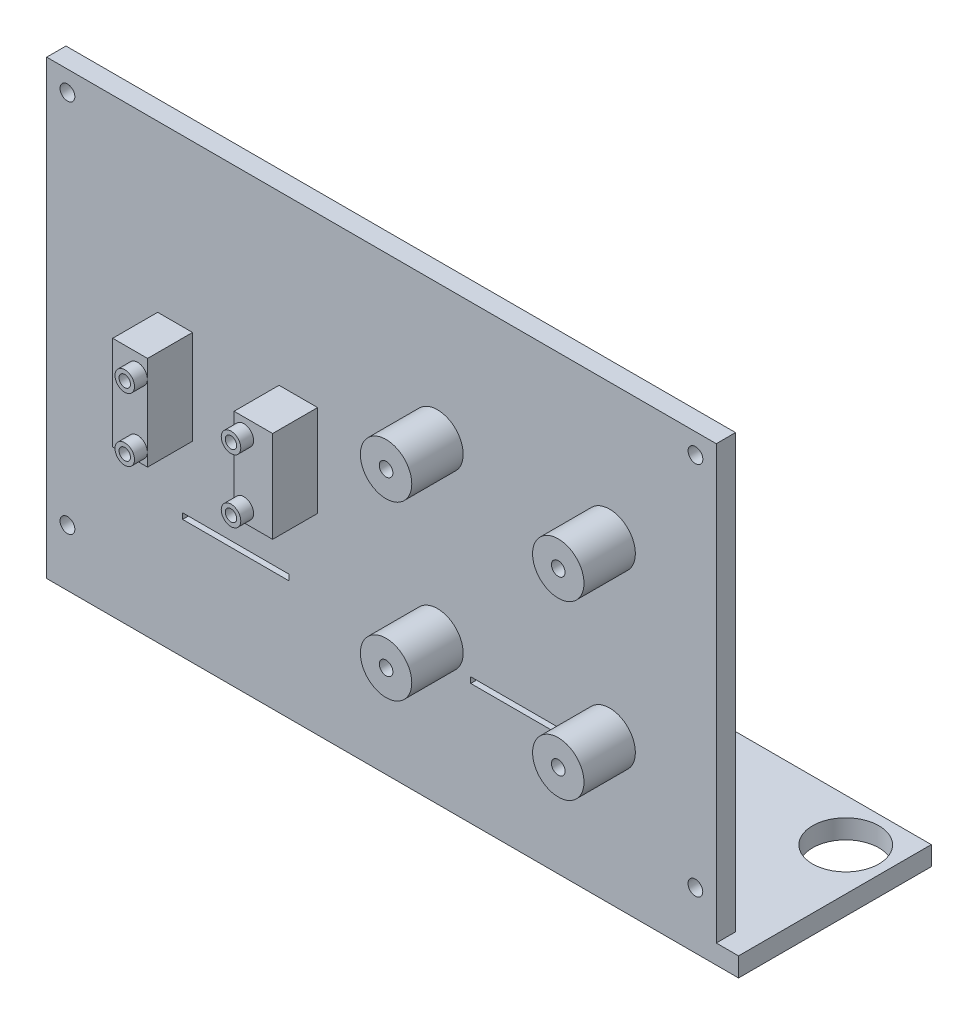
ISO-10303-21;
HEADER;
FILE_DESCRIPTION(('STEP AP214'),'2;1');
FILE_NAME('part.step','',(''),(''),'','','');
FILE_SCHEMA(('AUTOMOTIVE_DESIGN { 1 0 10303 214 1 1 1 1 }'));
ENDSEC;
DATA;
#1=APPLICATION_CONTEXT('core data for automotive mechanical design processes');
#2=APPLICATION_PROTOCOL_DEFINITION('international standard','automotive_design',2000,#1);
#3=PRODUCT_CONTEXT('',#1,'mechanical');
#4=PRODUCT('Part','Part','',(#3));
#5=PRODUCT_RELATED_PRODUCT_CATEGORY('part','',(#4));
#6=PRODUCT_DEFINITION_FORMATION('','',#4);
#7=PRODUCT_DEFINITION_CONTEXT('part definition',#1,'design');
#8=PRODUCT_DEFINITION('design','',#6,#7);
#9=PRODUCT_DEFINITION_SHAPE('','',#8);
#10=(LENGTH_UNIT() NAMED_UNIT(*) SI_UNIT(.MILLI.,.METRE.));
#11=(NAMED_UNIT(*) PLANE_ANGLE_UNIT() SI_UNIT($,.RADIAN.));
#12=(NAMED_UNIT(*) SI_UNIT($,.STERADIAN.) SOLID_ANGLE_UNIT());
#13=UNCERTAINTY_MEASURE_WITH_UNIT(LENGTH_MEASURE(1.E-05),#10,'distance_accuracy_value','');
#14=(GEOMETRIC_REPRESENTATION_CONTEXT(3) GLOBAL_UNCERTAINTY_ASSIGNED_CONTEXT((#13)) GLOBAL_UNIT_ASSIGNED_CONTEXT((#10,
#11,#12)) REPRESENTATION_CONTEXT('',''));
#15=CARTESIAN_POINT('',(0.,0.,0.));
#16=DIRECTION('',(0.,0.,1.));
#17=DIRECTION('',(1.,0.,0.));
#18=AXIS2_PLACEMENT_3D('',#15,#16,#17);
#19=CARTESIAN_POINT('',(0.,0.,3.81));
#20=DIRECTION('',(0.,0.,1.));
#21=DIRECTION('',(1.,0.,0.));
#22=AXIS2_PLACEMENT_3D('',#19,#20,#21);
#23=PLANE('',#22);
#24=DIRECTION('',(-1.,0.,0.));
#25=VECTOR('',#24,1.);
#26=CARTESIAN_POINT('',(-5.27961438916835,20.5865943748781,3.81));
#27=LINE('',#26,#25);
#28=CARTESIAN_POINT('',(-5.27961438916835,20.5865943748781,3.81));
#29=VERTEX_POINT('',#28);
#30=CARTESIAN_POINT('',(-12.1731275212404,20.5865943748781,3.81));
#31=VERTEX_POINT('',#30);
#32=EDGE_CURVE('E301',#29,#31,#27,.T.);
#33=ORIENTED_EDGE('',*,*,#32,.F.);
#34=DIRECTION('',(0.,1.,0.));
#35=VECTOR('',#34,1.);
#36=CARTESIAN_POINT('',(-5.27961438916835,1.97192409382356,3.81));
#37=LINE('',#36,#35);
#38=CARTESIAN_POINT('',(-5.27961438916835,1.97192409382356,3.81));
#39=VERTEX_POINT('',#38);
#40=EDGE_CURVE('E287',#39,#29,#37,.T.);
#41=ORIENTED_EDGE('',*,*,#40,.F.);
#42=DIRECTION('',(1.,0.,0.));
#43=VECTOR('',#42,1.);
#44=CARTESIAN_POINT('',(-5.27961438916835,1.97192409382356,3.81));
#45=LINE('',#44,#43);
#46=CARTESIAN_POINT('',(-12.1731275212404,1.97192409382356,3.81));
#47=VERTEX_POINT('',#46);
#48=EDGE_CURVE('E292',#47,#39,#45,.T.);
#49=ORIENTED_EDGE('',*,*,#48,.F.);
#50=DIRECTION('',(0.,-1.,0.));
#51=VECTOR('',#50,1.);
#52=CARTESIAN_POINT('',(-12.1731275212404,1.97192409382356,3.81));
#53=LINE('',#52,#51);
#54=EDGE_CURVE('E303',#31,#47,#53,.T.);
#55=ORIENTED_EDGE('',*,*,#54,.F.);
#56=EDGE_LOOP('',(#33,#41,#49,#55));
#57=FACE_BOUND('',#56,.T.);
#58=CARTESIAN_POINT('',(-30.007414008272,-24.7536590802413,3.81));
#59=DIRECTION('',(0.,0.,1.));
#60=DIRECTION('',(1.,0.,0.));
#61=AXIS2_PLACEMENT_3D('',#58,#59,#60);
#62=CIRCLE('',#61,1.4605);
#63=CARTESIAN_POINT('',(-28.546914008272,-24.7536590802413,3.81));
#64=VERTEX_POINT('',#63);
#65=EDGE_CURVE('E421',#64,#64,#62,.T.);
#66=ORIENTED_EDGE('',*,*,#65,.F.);
#67=EDGE_LOOP('',(#66));
#68=FACE_BOUND('',#67,.T.);
#69=CARTESIAN_POINT('',(-30.007414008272,49.2944432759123,3.81));
#70=DIRECTION('',(0.,0.,1.));
#71=DIRECTION('',(1.,0.,0.));
#72=AXIS2_PLACEMENT_3D('',#69,#70,#71);
#73=CIRCLE('',#72,1.4605);
#74=CARTESIAN_POINT('',(-28.546914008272,49.2944432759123,3.81));
#75=VERTEX_POINT('',#74);
#76=EDGE_CURVE('E418',#75,#75,#73,.T.);
#77=ORIENTED_EDGE('',*,*,#76,.F.);
#78=EDGE_LOOP('',(#77));
#79=FACE_BOUND('',#78,.T.);
#80=CARTESIAN_POINT('',(94.132735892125,49.2944432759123,3.81));
#81=DIRECTION('',(0.,0.,1.));
#82=DIRECTION('',(1.,0.,0.));
#83=AXIS2_PLACEMENT_3D('',#80,#81,#82);
#84=CIRCLE('',#83,1.4605);
#85=CARTESIAN_POINT('',(95.593235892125,49.2944432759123,3.81));
#86=VERTEX_POINT('',#85);
#87=EDGE_CURVE('E415',#86,#86,#84,.T.);
#88=ORIENTED_EDGE('',*,*,#87,.F.);
#89=EDGE_LOOP('',(#88));
#90=FACE_BOUND('',#89,.T.);
#91=CARTESIAN_POINT('',(94.11198209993,-24.7536590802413,3.81));
#92=DIRECTION('',(0.,0.,1.));
#93=DIRECTION('',(1.,0.,0.));
#94=AXIS2_PLACEMENT_3D('',#91,#92,#93);
#95=CIRCLE('',#94,1.4605);
#96=CARTESIAN_POINT('',(95.57248209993,-24.7536590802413,3.81));
#97=VERTEX_POINT('',#96);
#98=EDGE_CURVE('E406',#97,#97,#95,.T.);
#99=ORIENTED_EDGE('',*,*,#98,.F.);
#100=EDGE_LOOP('',(#99));
#101=FACE_BOUND('',#100,.T.);
#102=CARTESIAN_POINT('',(43.1339043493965,-7.55683483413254,3.81));
#103=DIRECTION('',(0.,0.,1.));
#104=DIRECTION('',(1.,0.,0.));
#105=AXIS2_PLACEMENT_3D('',#102,#103,#104);
#106=CIRCLE('',#105,5.08);
#107=CARTESIAN_POINT('',(48.2139043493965,-7.55683483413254,3.81));
#108=VERTEX_POINT('',#107);
#109=EDGE_CURVE('E439',#108,#108,#106,.F.);
#110=ORIENTED_EDGE('',*,*,#109,.T.);
#111=EDGE_LOOP('',(#110));
#112=FACE_BOUND('',#111,.T.);
#113=CARTESIAN_POINT('',(43.1339043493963,26.4791651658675,3.81));
#114=DIRECTION('',(0.,0.,1.));
#115=DIRECTION('',(1.,0.,0.));
#116=AXIS2_PLACEMENT_3D('',#113,#114,#115);
#117=CIRCLE('',#116,5.08);
#118=CARTESIAN_POINT('',(48.2139043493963,26.4791651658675,3.81));
#119=VERTEX_POINT('',#118);
#120=EDGE_CURVE('E457',#119,#119,#117,.F.);
#121=ORIENTED_EDGE('',*,*,#120,.T.);
#122=EDGE_LOOP('',(#121));
#123=FACE_BOUND('',#122,.T.);
#124=DIRECTION('',(-1.,0.,0.));
#125=VECTOR('',#124,1.);
#126=CARTESIAN_POINT('',(0.,53.3019013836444,3.81));
#127=LINE('',#126,#125);
#128=CARTESIAN_POINT('',(98.2396863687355,53.3019013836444,3.81));
#129=VERTEX_POINT('',#128);
#130=CARTESIAN_POINT('',(-34.1056017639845,53.3019013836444,3.81));
#131=VERTEX_POINT('',#130);
#132=EDGE_CURVE('E461',#129,#131,#127,.T.);
#133=ORIENTED_EDGE('',*,*,#132,.T.);
#134=DIRECTION('',(0.,-1.,0.));
#135=VECTOR('',#134,1.);
#136=CARTESIAN_POINT('',(-34.1056017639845,0.,3.81));
#137=LINE('',#136,#135);
#138=CARTESIAN_POINT('',(-34.1056017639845,-35.959308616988,3.81));
#139=VERTEX_POINT('',#138);
#140=EDGE_CURVE('E464',#131,#139,#137,.T.);
#141=ORIENTED_EDGE('',*,*,#140,.T.);
#142=DIRECTION('',(1.,0.,0.));
#143=VECTOR('',#142,1.);
#144=CARTESIAN_POINT('',(-34.1056017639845,-35.959308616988,3.81));
#145=LINE('',#144,#143);
#146=CARTESIAN_POINT('',(102.644103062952,-35.959308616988,3.81));
#147=VERTEX_POINT('',#146);
#148=EDGE_CURVE('E372',#139,#147,#145,.T.);
#149=ORIENTED_EDGE('',*,*,#148,.T.);
#150=DIRECTION('',(0.,1.,0.));
#151=VECTOR('',#150,1.);
#152=CARTESIAN_POINT('',(102.644103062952,-32.1719053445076,3.81));
#153=LINE('',#152,#151);
#154=CARTESIAN_POINT('',(102.644103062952,-32.1719053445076,3.81));
#155=VERTEX_POINT('',#154);
#156=EDGE_CURVE('E398',#147,#155,#153,.T.);
#157=ORIENTED_EDGE('',*,*,#156,.T.);
#158=DIRECTION('',(-1.,0.,0.));
#159=VECTOR('',#158,1.);
#160=CARTESIAN_POINT('',(-34.1056017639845,-32.1719053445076,3.81));
#161=LINE('',#160,#159);
#162=CARTESIAN_POINT('',(98.2396863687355,-32.1719053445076,3.81));
#163=VERTEX_POINT('',#162);
#164=EDGE_CURVE('E385',#155,#163,#161,.T.);
#165=ORIENTED_EDGE('',*,*,#164,.T.);
#166=DIRECTION('',(0.,-1.,0.));
#167=VECTOR('',#166,1.);
#168=CARTESIAN_POINT('',(98.2396863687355,0.,3.81));
#169=LINE('',#168,#167);
#170=EDGE_CURVE('E467',#129,#163,#169,.T.);
#171=ORIENTED_EDGE('',*,*,#170,.F.);
#172=EDGE_LOOP('',(#133,#141,#149,#157,#165,#171));
#173=FACE_BOUND('',#172,.T.);
#174=DIRECTION('',(1.,0.,0.));
#175=VECTOR('',#174,1.);
#176=CARTESIAN_POINT('',(0.,-11.2599083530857,3.81));
#177=LINE('',#176,#175);
#178=CARTESIAN_POINT('',(-7.25376110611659,-11.2599083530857,3.81));
#179=VERTEX_POINT('',#178);
#180=CARTESIAN_POINT('',(13.7462375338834,-11.2599083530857,3.81));
#181=VERTEX_POINT('',#180);
#182=EDGE_CURVE('E470',#179,#181,#177,.T.);
#183=ORIENTED_EDGE('',*,*,#182,.T.);
#184=DIRECTION('',(0.,-1.,0.));
#185=VECTOR('',#184,1.);
#186=CARTESIAN_POINT('',(13.7462375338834,0.,3.81));
#187=LINE('',#186,#185);
#188=CARTESIAN_POINT('',(13.7462375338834,-12.4029083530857,3.81));
#189=VERTEX_POINT('',#188);
#190=EDGE_CURVE('E473',#181,#189,#187,.T.);
#191=ORIENTED_EDGE('',*,*,#190,.T.);
#192=DIRECTION('',(1.,0.,0.));
#193=VECTOR('',#192,1.);
#194=CARTESIAN_POINT('',(0.,-12.4029083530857,3.81));
#195=LINE('',#194,#193);
#196=CARTESIAN_POINT('',(-7.25376110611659,-12.4029083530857,3.81));
#197=VERTEX_POINT('',#196);
#198=EDGE_CURVE('E475',#197,#189,#195,.T.);
#199=ORIENTED_EDGE('',*,*,#198,.F.);
#200=DIRECTION('',(0.,-1.,0.));
#201=VECTOR('',#200,1.);
#202=CARTESIAN_POINT('',(-7.25376110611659,0.,3.81));
#203=LINE('',#202,#201);
#204=EDGE_CURVE('E478',#179,#197,#203,.T.);
#205=ORIENTED_EDGE('',*,*,#204,.F.);
#206=EDGE_LOOP('',(#183,#191,#199,#205));
#207=FACE_BOUND('',#206,.T.);
#208=DIRECTION('',(1.,0.,0.));
#209=VECTOR('',#208,1.);
#210=CARTESIAN_POINT('',(0.,-10.8625497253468,3.81));
#211=LINE('',#210,#209);
#212=CARTESIAN_POINT('',(49.7031810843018,-10.8625497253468,3.81));
#213=VERTEX_POINT('',#212);
#214=CARTESIAN_POINT('',(70.7031797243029,-10.8625497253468,3.81));
#215=VERTEX_POINT('',#214);
#216=EDGE_CURVE('E481',#213,#215,#211,.T.);
#217=ORIENTED_EDGE('',*,*,#216,.T.);
#218=DIRECTION('',(0.,-1.,0.));
#219=VECTOR('',#218,1.);
#220=CARTESIAN_POINT('',(70.7031797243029,0.,3.81));
#221=LINE('',#220,#219);
#222=CARTESIAN_POINT('',(70.7031797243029,-12.0055497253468,3.81));
#223=VERTEX_POINT('',#222);
#224=EDGE_CURVE('E484',#215,#223,#221,.T.);
#225=ORIENTED_EDGE('',*,*,#224,.T.);
#226=DIRECTION('',(1.,0.,0.));
#227=VECTOR('',#226,1.);
#228=CARTESIAN_POINT('',(0.,-12.0055497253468,3.81));
#229=LINE('',#228,#227);
#230=CARTESIAN_POINT('',(49.7031810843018,-12.0055497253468,3.81));
#231=VERTEX_POINT('',#230);
#232=EDGE_CURVE('E486',#231,#223,#229,.T.);
#233=ORIENTED_EDGE('',*,*,#232,.F.);
#234=DIRECTION('',(0.,-1.,0.));
#235=VECTOR('',#234,1.);
#236=CARTESIAN_POINT('',(49.7031810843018,0.,3.81));
#237=LINE('',#236,#235);
#238=EDGE_CURVE('E489',#213,#231,#237,.T.);
#239=ORIENTED_EDGE('',*,*,#238,.F.);
#240=EDGE_LOOP('',(#217,#225,#233,#239));
#241=FACE_BOUND('',#240,.T.);
#242=CARTESIAN_POINT('',(77.1699043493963,26.4791651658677,3.81));
#243=DIRECTION('',(0.,0.,1.));
#244=DIRECTION('',(1.,0.,0.));
#245=AXIS2_PLACEMENT_3D('',#242,#243,#244);
#246=CIRCLE('',#245,5.08);
#247=CARTESIAN_POINT('',(82.2499043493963,26.4791651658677,3.81));
#248=VERTEX_POINT('',#247);
#249=EDGE_CURVE('E448',#248,#248,#246,.F.);
#250=ORIENTED_EDGE('',*,*,#249,.T.);
#251=EDGE_LOOP('',(#250));
#252=FACE_BOUND('',#251,.T.);
#253=CARTESIAN_POINT('',(77.1699043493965,-7.5568348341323,3.81));
#254=DIRECTION('',(0.,0.,1.));
#255=DIRECTION('',(1.,0.,0.));
#256=AXIS2_PLACEMENT_3D('',#253,#254,#255);
#257=CIRCLE('',#256,5.08);
#258=CARTESIAN_POINT('',(82.2499043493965,-7.5568348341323,3.81));
#259=VERTEX_POINT('',#258);
#260=EDGE_CURVE('E430',#259,#259,#257,.F.);
#261=ORIENTED_EDGE('',*,*,#260,.T.);
#262=EDGE_LOOP('',(#261));
#263=FACE_BOUND('',#262,.T.);
#264=DIRECTION('',(1.,0.,0.));
#265=VECTOR('',#264,1.);
#266=CARTESIAN_POINT('',(11.8215057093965,1.97192409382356,3.81));
#267=LINE('',#266,#265);
#268=CARTESIAN_POINT('',(11.8215057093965,1.97192409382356,3.81));
#269=VERTEX_POINT('',#268);
#270=CARTESIAN_POINT('',(19.4415057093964,1.97192409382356,3.81));
#271=VERTEX_POINT('',#270);
#272=EDGE_CURVE('E276',#269,#271,#267,.T.);
#273=ORIENTED_EDGE('',*,*,#272,.F.);
#274=DIRECTION('',(0.,-1.,0.));
#275=VECTOR('',#274,1.);
#276=CARTESIAN_POINT('',(11.8215057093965,1.97192409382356,3.81));
#277=LINE('',#276,#275);
#278=CARTESIAN_POINT('',(11.8215057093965,20.0905568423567,3.81));
#279=VERTEX_POINT('',#278);
#280=EDGE_CURVE('E274',#279,#269,#277,.T.);
#281=ORIENTED_EDGE('',*,*,#280,.F.);
#282=DIRECTION('',(-1.,0.,0.));
#283=VECTOR('',#282,1.);
#284=CARTESIAN_POINT('',(11.8215057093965,20.0905568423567,3.81));
#285=LINE('',#284,#283);
#286=CARTESIAN_POINT('',(19.4415057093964,20.0905568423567,3.81));
#287=VERTEX_POINT('',#286);
#288=EDGE_CURVE('E261',#287,#279,#285,.T.);
#289=ORIENTED_EDGE('',*,*,#288,.F.);
#290=DIRECTION('',(0.,1.,0.));
#291=VECTOR('',#290,1.);
#292=CARTESIAN_POINT('',(19.4415057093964,1.97192409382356,3.81));
#293=LINE('',#292,#291);
#294=EDGE_CURVE('E262',#271,#287,#293,.T.);
#295=ORIENTED_EDGE('',*,*,#294,.F.);
#296=EDGE_LOOP('',(#273,#281,#289,#295));
#297=FACE_BOUND('',#296,.T.);
#298=ADVANCED_FACE('F36',(#57,#68,#79,#90,#101,#112,#123,#173,#207,#241,#252,#263,#297),#23,.T.);
#299=CARTESIAN_POINT('',(0.,0.,0.));
#300=DIRECTION('',(0.,0.,1.));
#301=DIRECTION('',(1.,0.,0.));
#302=AXIS2_PLACEMENT_3D('',#299,#300,#301);
#303=PLANE('',#302);
#304=CARTESIAN_POINT('',(94.11198209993,-24.7536590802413,0.));
#305=DIRECTION('',(0.,0.,1.));
#306=DIRECTION('',(1.,0.,0.));
#307=AXIS2_PLACEMENT_3D('',#304,#305,#306);
#308=CIRCLE('',#307,3.048);
#309=CARTESIAN_POINT('',(97.15998209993,-24.7536590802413,0.));
#310=VERTEX_POINT('',#309);
#311=EDGE_CURVE('E1032',#310,#310,#308,.T.);
#312=ORIENTED_EDGE('',*,*,#311,.T.);
#313=EDGE_LOOP('',(#312));
#314=FACE_BOUND('',#313,.T.);
#315=CARTESIAN_POINT('',(94.132735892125,49.2944432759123,0.));
#316=DIRECTION('',(0.,0.,1.));
#317=DIRECTION('',(1.,0.,0.));
#318=AXIS2_PLACEMENT_3D('',#315,#316,#317);
#319=CIRCLE('',#318,3.048);
#320=CARTESIAN_POINT('',(97.180735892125,49.2944432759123,0.));
#321=VERTEX_POINT('',#320);
#322=EDGE_CURVE('E1026',#321,#321,#319,.T.);
#323=ORIENTED_EDGE('',*,*,#322,.T.);
#324=EDGE_LOOP('',(#323));
#325=FACE_BOUND('',#324,.T.);
#326=CARTESIAN_POINT('',(77.1699043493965,-7.5568348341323,0.));
#327=DIRECTION('',(0.,0.,1.));
#328=DIRECTION('',(1.,0.,0.));
#329=AXIS2_PLACEMENT_3D('',#326,#327,#328);
#330=CIRCLE('',#329,1.3462);
#331=CARTESIAN_POINT('',(75.8237043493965,-7.5568348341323,0.));
#332=VERTEX_POINT('',#331);
#333=EDGE_CURVE('E501',#332,#332,#330,.T.);
#334=ORIENTED_EDGE('',*,*,#333,.T.);
#335=EDGE_LOOP('',(#334));
#336=FACE_BOUND('',#335,.T.);
#337=CARTESIAN_POINT('',(77.1699043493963,26.4791651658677,0.));
#338=DIRECTION('',(0.,0.,1.));
#339=DIRECTION('',(1.,0.,0.));
#340=AXIS2_PLACEMENT_3D('',#337,#338,#339);
#341=CIRCLE('',#340,1.3462);
#342=CARTESIAN_POINT('',(75.8237043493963,26.4791651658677,0.));
#343=VERTEX_POINT('',#342);
#344=EDGE_CURVE('E498',#343,#343,#341,.T.);
#345=ORIENTED_EDGE('',*,*,#344,.T.);
#346=EDGE_LOOP('',(#345));
#347=FACE_BOUND('',#346,.T.);
#348=DIRECTION('',(1.,0.,0.));
#349=VECTOR('',#348,1.);
#350=CARTESIAN_POINT('',(0.,-10.8625497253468,0.));
#351=LINE('',#350,#349);
#352=CARTESIAN_POINT('',(49.7031810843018,-10.8625497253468,0.));
#353=VERTEX_POINT('',#352);
#354=CARTESIAN_POINT('',(70.7031797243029,-10.8625497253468,0.));
#355=VERTEX_POINT('',#354);
#356=EDGE_CURVE('E530',#353,#355,#351,.T.);
#357=ORIENTED_EDGE('',*,*,#356,.F.);
#358=DIRECTION('',(0.,-1.,0.));
#359=VECTOR('',#358,1.);
#360=CARTESIAN_POINT('',(49.7031810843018,0.,0.));
#361=LINE('',#360,#359);
#362=CARTESIAN_POINT('',(49.7031810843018,-12.0055497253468,0.));
#363=VERTEX_POINT('',#362);
#364=EDGE_CURVE('E465',#353,#363,#361,.T.);
#365=ORIENTED_EDGE('',*,*,#364,.T.);
#366=DIRECTION('',(1.,0.,0.));
#367=VECTOR('',#366,1.);
#368=CARTESIAN_POINT('',(0.,-12.0055497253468,0.));
#369=LINE('',#368,#367);
#370=CARTESIAN_POINT('',(70.7031797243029,-12.0055497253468,0.));
#371=VERTEX_POINT('',#370);
#372=EDGE_CURVE('E536',#363,#371,#369,.T.);
#373=ORIENTED_EDGE('',*,*,#372,.T.);
#374=DIRECTION('',(0.,-1.,0.));
#375=VECTOR('',#374,1.);
#376=CARTESIAN_POINT('',(70.7031797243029,0.,0.));
#377=LINE('',#376,#375);
#378=EDGE_CURVE('E533',#355,#371,#377,.T.);
#379=ORIENTED_EDGE('',*,*,#378,.F.);
#380=EDGE_LOOP('',(#357,#365,#373,#379));
#381=FACE_BOUND('',#380,.T.);
#382=CARTESIAN_POINT('',(43.1339043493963,26.4791651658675,0.));
#383=DIRECTION('',(0.,0.,1.));
#384=DIRECTION('',(1.,0.,0.));
#385=AXIS2_PLACEMENT_3D('',#382,#383,#384);
#386=CIRCLE('',#385,1.3462);
#387=CARTESIAN_POINT('',(41.7877043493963,26.4791651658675,0.));
#388=VERTEX_POINT('',#387);
#389=EDGE_CURVE('E495',#388,#388,#386,.T.);
#390=ORIENTED_EDGE('',*,*,#389,.T.);
#391=EDGE_LOOP('',(#390));
#392=FACE_BOUND('',#391,.T.);
#393=CARTESIAN_POINT('',(43.1339043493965,-7.55683483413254,0.));
#394=DIRECTION('',(0.,0.,1.));
#395=DIRECTION('',(1.,0.,0.));
#396=AXIS2_PLACEMENT_3D('',#393,#394,#395);
#397=CIRCLE('',#396,1.3462);
#398=CARTESIAN_POINT('',(41.7877043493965,-7.55683483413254,0.));
#399=VERTEX_POINT('',#398);
#400=EDGE_CURVE('E460',#399,#399,#397,.T.);
#401=ORIENTED_EDGE('',*,*,#400,.T.);
#402=EDGE_LOOP('',(#401));
#403=FACE_BOUND('',#402,.T.);
#404=DIRECTION('',(0.,-1.,0.));
#405=VECTOR('',#404,1.);
#406=CARTESIAN_POINT('',(34.6070423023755,53.3019013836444,0.));
#407=LINE('',#406,#405);
#408=CARTESIAN_POINT('',(34.6070423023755,53.3019013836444,0.));
#409=VERTEX_POINT('',#408);
#410=CARTESIAN_POINT('',(34.6070423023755,-32.1719053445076,0.));
#411=VERTEX_POINT('',#410);
#412=EDGE_CURVE('E337',#409,#411,#407,.T.);
#413=ORIENTED_EDGE('',*,*,#412,.F.);
#414=DIRECTION('',(-1.,0.,0.));
#415=VECTOR('',#414,1.);
#416=CARTESIAN_POINT('',(0.,53.3019013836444,0.));
#417=LINE('',#416,#415);
#418=CARTESIAN_POINT('',(98.2396863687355,53.3019013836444,0.));
#419=VERTEX_POINT('',#418);
#420=EDGE_CURVE('E505',#419,#409,#417,.T.);
#421=ORIENTED_EDGE('',*,*,#420,.F.);
#422=DIRECTION('',(0.,-1.,0.));
#423=VECTOR('',#422,1.);
#424=CARTESIAN_POINT('',(98.2396863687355,0.,0.));
#425=LINE('',#424,#423);
#426=CARTESIAN_POINT('',(98.2396863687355,-32.1719053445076,0.));
#427=VERTEX_POINT('',#426);
#428=EDGE_CURVE('E515',#419,#427,#425,.T.);
#429=ORIENTED_EDGE('',*,*,#428,.T.);
#430=DIRECTION('',(-1.,0.,0.));
#431=VECTOR('',#430,1.);
#432=CARTESIAN_POINT('',(0.,-32.1719053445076,0.));
#433=LINE('',#432,#431);
#434=EDGE_CURVE('E512',#427,#411,#433,.T.);
#435=ORIENTED_EDGE('',*,*,#434,.T.);
#436=EDGE_LOOP('',(#413,#421,#429,#435));
#437=FACE_BOUND('',#436,.T.);
#438=ADVANCED_FACE('F672',(#314,#325,#336,#347,#381,#392,#403,#437),#303,.F.);
#439=CARTESIAN_POINT('',(-34.1056017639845,-32.1719053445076,-34.29));
#440=DIRECTION('',(0.,1.,0.));
#441=DIRECTION('',(0.,0.,1.));
#442=AXIS2_PLACEMENT_3D('',#439,#440,#441);
#443=PLANE('',#442);
#444=CARTESIAN_POINT('',(-25.6911302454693,-32.1719053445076,-25.7916240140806));
#445=DIRECTION('',(0.,1.,0.));
#446=DIRECTION('',(0.,0.,1.));
#447=AXIS2_PLACEMENT_3D('',#444,#445,#446);
#448=CIRCLE('',#447,6.5532);
#449=CARTESIAN_POINT('',(-25.6911302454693,-32.1719053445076,-19.2384240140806));
#450=VERTEX_POINT('',#449);
#451=EDGE_CURVE('E373',#450,#450,#448,.T.);
#452=ORIENTED_EDGE('',*,*,#451,.F.);
#453=EDGE_LOOP('',(#452));
#454=FACE_BOUND('',#453,.T.);
#455=CARTESIAN_POINT('',(94.2296315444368,-32.1719053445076,-25.7916240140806));
#456=DIRECTION('',(0.,1.,0.));
#457=DIRECTION('',(0.,0.,1.));
#458=AXIS2_PLACEMENT_3D('',#455,#456,#457);
#459=CIRCLE('',#458,6.55319999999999);
#460=CARTESIAN_POINT('',(94.2296315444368,-32.1719053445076,-19.2384240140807));
#461=VERTEX_POINT('',#460);
#462=EDGE_CURVE('E368',#461,#461,#459,.T.);
#463=ORIENTED_EDGE('',*,*,#462,.F.);
#464=EDGE_LOOP('',(#463));
#465=FACE_BOUND('',#464,.T.);
#466=DIRECTION('',(-1.,0.,0.));
#467=VECTOR('',#466,1.);
#468=CARTESIAN_POINT('',(-34.1056017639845,-32.1719053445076,-34.29));
#469=LINE('',#468,#467);
#470=CARTESIAN_POINT('',(102.644103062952,-32.1719053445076,-34.29));
#471=VERTEX_POINT('',#470);
#472=CARTESIAN_POINT('',(34.6070423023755,-32.1719053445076,-34.29));
#473=VERTEX_POINT('',#472);
#474=EDGE_CURVE('E392',#471,#473,#469,.T.);
#475=ORIENTED_EDGE('',*,*,#474,.T.);
#476=DIRECTION('',(0.,0.,-1.));
#477=VECTOR('',#476,1.);
#478=CARTESIAN_POINT('',(34.6070423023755,-32.1719053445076,-34.29));
#479=LINE('',#478,#477);
#480=CARTESIAN_POINT('',(34.6070423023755,-32.1719053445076,-19.0456885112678));
#481=VERTEX_POINT('',#480);
#482=EDGE_CURVE('E350',#481,#473,#479,.T.);
#483=ORIENTED_EDGE('',*,*,#482,.F.);
#484=DIRECTION('',(-1.,0.,0.));
#485=VECTOR('',#484,1.);
#486=CARTESIAN_POINT('',(34.6070423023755,-32.1719053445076,-19.0456885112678));
#487=LINE('',#486,#485);
#488=CARTESIAN_POINT('',(24.4470423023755,-32.1719053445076,-19.0456885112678));
#489=VERTEX_POINT('',#488);
#490=EDGE_CURVE('E356',#481,#489,#487,.T.);
#491=ORIENTED_EDGE('',*,*,#490,.T.);
#492=DIRECTION('',(0.,0.,-1.));
#493=VECTOR('',#492,1.);
#494=CARTESIAN_POINT('',(24.4470423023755,-32.1719053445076,-34.29));
#495=LINE('',#494,#493);
#496=CARTESIAN_POINT('',(24.4470423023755,-32.1719053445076,-34.29));
#497=VERTEX_POINT('',#496);
#498=EDGE_CURVE('E331',#489,#497,#495,.T.);
#499=ORIENTED_EDGE('',*,*,#498,.T.);
#500=CARTESIAN_POINT('',(-34.1056017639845,-32.1719053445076,-34.29));
#501=VERTEX_POINT('',#500);
#502=EDGE_CURVE('E391',#497,#501,#469,.T.);
#503=ORIENTED_EDGE('',*,*,#502,.T.);
#504=DIRECTION('',(0.,0.,1.));
#505=VECTOR('',#504,1.);
#506=CARTESIAN_POINT('',(-34.1056017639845,-32.1719053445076,-34.29));
#507=LINE('',#506,#505);
#508=CARTESIAN_POINT('',(-34.1056017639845,-32.1719053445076,0.));
#509=VERTEX_POINT('',#508);
#510=EDGE_CURVE('E403',#501,#509,#507,.T.);
#511=ORIENTED_EDGE('',*,*,#510,.T.);
#512=CARTESIAN_POINT('',(24.4470423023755,-32.1719053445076,0.));
#513=VERTEX_POINT('',#512);
#514=EDGE_CURVE('E511',#513,#509,#433,.T.);
#515=ORIENTED_EDGE('',*,*,#514,.F.);
#516=DIRECTION('',(0.,3.85173431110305E-13,-1.));
#517=VECTOR('',#516,1.);
#518=CARTESIAN_POINT('',(24.4470423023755,-32.1719053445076,-0.0180149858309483));
#519=LINE('',#518,#517);
#520=CARTESIAN_POINT('',(24.4470423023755,-32.1719053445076,-0.0180149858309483));
#521=VERTEX_POINT('',#520);
#522=EDGE_CURVE('E320',#513,#521,#519,.T.);
#523=ORIENTED_EDGE('',*,*,#522,.T.);
#524=DIRECTION('',(-1.,0.,0.));
#525=VECTOR('',#524,1.);
#526=CARTESIAN_POINT('',(34.6070423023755,-32.1719053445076,-0.0180149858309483));
#527=LINE('',#526,#525);
#528=CARTESIAN_POINT('',(34.6070423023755,-32.1719053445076,-0.0180149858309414));
#529=VERTEX_POINT('',#528);
#530=EDGE_CURVE('E362',#529,#521,#527,.T.);
#531=ORIENTED_EDGE('',*,*,#530,.F.);
#532=DIRECTION('',(0.,3.85173431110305E-13,-1.));
#533=VECTOR('',#532,1.);
#534=CARTESIAN_POINT('',(34.6070423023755,-32.1719053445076,-0.0180149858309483));
#535=LINE('',#534,#533);
#536=EDGE_CURVE('E340',#411,#529,#535,.T.);
#537=ORIENTED_EDGE('',*,*,#536,.F.);
#538=ORIENTED_EDGE('',*,*,#434,.F.);
#539=DIRECTION('',(0.,0.,-1.));
#540=VECTOR('',#539,1.);
#541=CARTESIAN_POINT('',(98.2396863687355,-32.1719053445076,3.81));
#542=LINE('',#541,#540);
#543=EDGE_CURVE('E557',#163,#427,#542,.T.);
#544=ORIENTED_EDGE('',*,*,#543,.F.);
#545=ORIENTED_EDGE('',*,*,#164,.F.);
#546=DIRECTION('',(0.,0.,1.));
#547=VECTOR('',#546,1.);
#548=CARTESIAN_POINT('',(102.644103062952,-32.1719053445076,-34.29));
#549=LINE('',#548,#547);
#550=EDGE_CURVE('E407',#471,#155,#549,.T.);
#551=ORIENTED_EDGE('',*,*,#550,.F.);
#552=EDGE_LOOP('',(#475,#483,#491,#499,#503,#511,#515,#523,#531,#537,#538,#544,#545,#551));
#553=FACE_BOUND('',#552,.T.);
#554=ADVANCED_FACE('F772',(#454,#465,#553),#443,.T.);
#555=CARTESIAN_POINT('',(0.,-10.8625497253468,3.81));
#556=DIRECTION('',(0.,1.,0.));
#557=DIRECTION('',(0.,0.,1.));
#558=AXIS2_PLACEMENT_3D('',#555,#556,#557);
#559=PLANE('',#558);
#560=ORIENTED_EDGE('',*,*,#356,.T.);
#561=DIRECTION('',(0.,0.,-1.));
#562=VECTOR('',#561,1.);
#563=CARTESIAN_POINT('',(70.7031797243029,-10.8625497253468,3.81));
#564=LINE('',#563,#562);
#565=EDGE_CURVE('E11',#215,#355,#564,.T.);
#566=ORIENTED_EDGE('',*,*,#565,.F.);
#567=ORIENTED_EDGE('',*,*,#216,.F.);
#568=DIRECTION('',(0.,0.,-1.));
#569=VECTOR('',#568,1.);
#570=CARTESIAN_POINT('',(49.7031810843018,-10.8625497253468,3.81));
#571=LINE('',#570,#569);
#572=EDGE_CURVE('E541',#213,#353,#571,.T.);
#573=ORIENTED_EDGE('',*,*,#572,.T.);
#574=EDGE_LOOP('',(#560,#566,#567,#573));
#575=FACE_BOUND('',#574,.T.);
#576=ADVANCED_FACE('F775',(#575),#559,.F.);
#577=CARTESIAN_POINT('',(70.7031797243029,0.,3.81));
#578=DIRECTION('',(1.,0.,0.));
#579=DIRECTION('',(0.,0.,-1.));
#580=AXIS2_PLACEMENT_3D('',#577,#578,#579);
#581=PLANE('',#580);
#582=ORIENTED_EDGE('',*,*,#378,.T.);
#583=DIRECTION('',(0.,0.,-1.));
#584=VECTOR('',#583,1.);
#585=CARTESIAN_POINT('',(70.7031797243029,-12.0055497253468,3.81));
#586=LINE('',#585,#584);
#587=EDGE_CURVE('E45',#223,#371,#586,.T.);
#588=ORIENTED_EDGE('',*,*,#587,.F.);
#589=ORIENTED_EDGE('',*,*,#224,.F.);
#590=ORIENTED_EDGE('',*,*,#565,.T.);
#591=EDGE_LOOP('',(#582,#588,#589,#590));
#592=FACE_BOUND('',#591,.T.);
#593=ADVANCED_FACE('F842',(#592),#581,.F.);
#594=CARTESIAN_POINT('',(0.,-12.0055497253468,3.81));
#595=DIRECTION('',(0.,1.,0.));
#596=DIRECTION('',(0.,0.,1.));
#597=AXIS2_PLACEMENT_3D('',#594,#595,#596);
#598=PLANE('',#597);
#599=ORIENTED_EDGE('',*,*,#372,.F.);
#600=DIRECTION('',(0.,0.,-1.));
#601=VECTOR('',#600,1.);
#602=CARTESIAN_POINT('',(49.7031810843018,-12.0055497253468,3.81));
#603=LINE('',#602,#601);
#604=EDGE_CURVE('E543',#231,#363,#603,.T.);
#605=ORIENTED_EDGE('',*,*,#604,.F.);
#606=ORIENTED_EDGE('',*,*,#232,.T.);
#607=ORIENTED_EDGE('',*,*,#587,.T.);
#608=EDGE_LOOP('',(#599,#605,#606,#607));
#609=FACE_BOUND('',#608,.T.);
#610=ADVANCED_FACE('F838',(#609),#598,.T.);
#611=CARTESIAN_POINT('',(0.,-11.2599083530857,3.81));
#612=DIRECTION('',(0.,1.,0.));
#613=DIRECTION('',(0.,0.,1.));
#614=AXIS2_PLACEMENT_3D('',#611,#612,#613);
#615=PLANE('',#614);
#616=DIRECTION('',(1.,0.,0.));
#617=VECTOR('',#616,1.);
#618=CARTESIAN_POINT('',(0.,-11.2599083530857,0.));
#619=LINE('',#618,#617);
#620=CARTESIAN_POINT('',(-7.25376110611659,-11.2599083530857,0.));
#621=VERTEX_POINT('',#620);
#622=CARTESIAN_POINT('',(13.7462375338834,-11.2599083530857,0.));
#623=VERTEX_POINT('',#622);
#624=EDGE_CURVE('E518',#621,#623,#619,.T.);
#625=ORIENTED_EDGE('',*,*,#624,.T.);
#626=DIRECTION('',(0.,0.,-1.));
#627=VECTOR('',#626,1.);
#628=CARTESIAN_POINT('',(13.7462375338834,-11.2599083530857,3.81));
#629=LINE('',#628,#627);
#630=EDGE_CURVE('E544',#181,#623,#629,.T.);
#631=ORIENTED_EDGE('',*,*,#630,.F.);
#632=ORIENTED_EDGE('',*,*,#182,.F.);
#633=DIRECTION('',(0.,0.,-1.));
#634=VECTOR('',#633,1.);
#635=CARTESIAN_POINT('',(-7.25376110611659,-11.2599083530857,3.81));
#636=LINE('',#635,#634);
#637=EDGE_CURVE('E547',#179,#621,#636,.T.);
#638=ORIENTED_EDGE('',*,*,#637,.T.);
#639=EDGE_LOOP('',(#625,#631,#632,#638));
#640=FACE_BOUND('',#639,.T.);
#641=ADVANCED_FACE('F841',(#640),#615,.F.);
#642=CARTESIAN_POINT('',(13.7462375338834,0.,3.81));
#643=DIRECTION('',(1.,0.,0.));
#644=DIRECTION('',(0.,0.,-1.));
#645=AXIS2_PLACEMENT_3D('',#642,#643,#644);
#646=PLANE('',#645);
#647=DIRECTION('',(0.,-1.,0.));
#648=VECTOR('',#647,1.);
#649=CARTESIAN_POINT('',(13.7462375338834,0.,0.));
#650=LINE('',#649,#648);
#651=CARTESIAN_POINT('',(13.7462375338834,-12.4029083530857,0.));
#652=VERTEX_POINT('',#651);
#653=EDGE_CURVE('E521',#623,#652,#650,.T.);
#654=ORIENTED_EDGE('',*,*,#653,.T.);
#655=DIRECTION('',(0.,0.,-1.));
#656=VECTOR('',#655,1.);
#657=CARTESIAN_POINT('',(13.7462375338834,-12.4029083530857,3.81));
#658=LINE('',#657,#656);
#659=EDGE_CURVE('E552',#189,#652,#658,.T.);
#660=ORIENTED_EDGE('',*,*,#659,.F.);
#661=ORIENTED_EDGE('',*,*,#190,.F.);
#662=ORIENTED_EDGE('',*,*,#630,.T.);
#663=EDGE_LOOP('',(#654,#660,#661,#662));
#664=FACE_BOUND('',#663,.T.);
#665=ADVANCED_FACE('F860',(#664),#646,.F.);
#666=CARTESIAN_POINT('',(0.,-12.4029083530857,3.81));
#667=DIRECTION('',(0.,1.,0.));
#668=DIRECTION('',(0.,0.,1.));
#669=AXIS2_PLACEMENT_3D('',#666,#667,#668);
#670=PLANE('',#669);
#671=DIRECTION('',(1.,0.,0.));
#672=VECTOR('',#671,1.);
#673=CARTESIAN_POINT('',(0.,-12.4029083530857,0.));
#674=LINE('',#673,#672);
#675=CARTESIAN_POINT('',(-7.25376110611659,-12.4029083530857,0.));
#676=VERTEX_POINT('',#675);
#677=EDGE_CURVE('E524',#676,#652,#674,.T.);
#678=ORIENTED_EDGE('',*,*,#677,.F.);
#679=DIRECTION('',(0.,0.,-1.));
#680=VECTOR('',#679,1.);
#681=CARTESIAN_POINT('',(-7.25376110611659,-12.4029083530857,3.81));
#682=LINE('',#681,#680);
#683=EDGE_CURVE('E549',#197,#676,#682,.T.);
#684=ORIENTED_EDGE('',*,*,#683,.F.);
#685=ORIENTED_EDGE('',*,*,#198,.T.);
#686=ORIENTED_EDGE('',*,*,#659,.T.);
#687=EDGE_LOOP('',(#678,#684,#685,#686));
#688=FACE_BOUND('',#687,.T.);
#689=ADVANCED_FACE('F856',(#688),#670,.T.);
#690=CARTESIAN_POINT('',(0.,53.3019013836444,3.81));
#691=DIRECTION('',(0.,-1.,0.));
#692=DIRECTION('',(0.,0.,-1.));
#693=AXIS2_PLACEMENT_3D('',#690,#691,#692);
#694=PLANE('',#693);
#695=ORIENTED_EDGE('',*,*,#420,.T.);
#696=DIRECTION('',(-1.,0.,0.));
#697=VECTOR('',#696,1.);
#698=CARTESIAN_POINT('',(34.6070423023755,53.3019013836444,0.));
#699=LINE('',#698,#697);
#700=CARTESIAN_POINT('',(24.4470423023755,53.3019013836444,0.));
#701=VERTEX_POINT('',#700);
#702=EDGE_CURVE('E365',#409,#701,#699,.T.);
#703=ORIENTED_EDGE('',*,*,#702,.T.);
#704=CARTESIAN_POINT('',(-34.1056017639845,53.3019013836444,0.));
#705=VERTEX_POINT('',#704);
#706=EDGE_CURVE('E504',#701,#705,#417,.T.);
#707=ORIENTED_EDGE('',*,*,#706,.T.);
#708=DIRECTION('',(0.,0.,-1.));
#709=VECTOR('',#708,1.);
#710=CARTESIAN_POINT('',(-34.1056017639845,53.3019013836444,3.81));
#711=LINE('',#710,#709);
#712=EDGE_CURVE('E550',#131,#705,#711,.T.);
#713=ORIENTED_EDGE('',*,*,#712,.F.);
#714=ORIENTED_EDGE('',*,*,#132,.F.);
#715=DIRECTION('',(0.,0.,-1.));
#716=VECTOR('',#715,1.);
#717=CARTESIAN_POINT('',(98.2396863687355,53.3019013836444,3.81));
#718=LINE('',#717,#716);
#719=EDGE_CURVE('E492',#129,#419,#718,.T.);
#720=ORIENTED_EDGE('',*,*,#719,.T.);
#721=EDGE_LOOP('',(#695,#703,#707,#713,#714,#720));
#722=FACE_BOUND('',#721,.T.);
#723=ADVANCED_FACE('F859',(#722),#694,.F.);
#724=CARTESIAN_POINT('',(-34.1056017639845,0.,3.81));
#725=DIRECTION('',(1.,0.,0.));
#726=DIRECTION('',(0.,1.,0.));
#727=AXIS2_PLACEMENT_3D('',#724,#725,#726);
#728=PLANE('',#727);
#729=DIRECTION('',(0.,-1.,0.));
#730=VECTOR('',#729,1.);
#731=CARTESIAN_POINT('',(-34.1056017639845,0.,0.));
#732=LINE('',#731,#730);
#733=EDGE_CURVE('E508',#705,#509,#732,.T.);
#734=ORIENTED_EDGE('',*,*,#733,.T.);
#735=ORIENTED_EDGE('',*,*,#510,.F.);
#736=DIRECTION('',(0.,-1.,0.));
#737=VECTOR('',#736,1.);
#738=CARTESIAN_POINT('',(-34.1056017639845,-32.1719053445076,-34.29));
#739=LINE('',#738,#737);
#740=CARTESIAN_POINT('',(-34.1056017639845,-35.959308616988,-34.29));
#741=VERTEX_POINT('',#740);
#742=EDGE_CURVE('E381',#501,#741,#739,.T.);
#743=ORIENTED_EDGE('',*,*,#742,.T.);
#744=DIRECTION('',(0.,0.,1.));
#745=VECTOR('',#744,1.);
#746=CARTESIAN_POINT('',(-34.1056017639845,-35.959308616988,-34.29));
#747=LINE('',#746,#745);
#748=EDGE_CURVE('E395',#741,#139,#747,.T.);
#749=ORIENTED_EDGE('',*,*,#748,.T.);
#750=ORIENTED_EDGE('',*,*,#140,.F.);
#751=ORIENTED_EDGE('',*,*,#712,.T.);
#752=EDGE_LOOP('',(#734,#735,#743,#749,#750,#751));
#753=FACE_BOUND('',#752,.T.);
#754=ADVANCED_FACE('F854',(#753),#728,.F.);
#755=CARTESIAN_POINT('',(-7.25376110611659,0.,3.81));
#756=DIRECTION('',(1.,0.,0.));
#757=DIRECTION('',(0.,0.,-1.));
#758=AXIS2_PLACEMENT_3D('',#755,#756,#757);
#759=PLANE('',#758);
#760=DIRECTION('',(0.,-1.,0.));
#761=VECTOR('',#760,1.);
#762=CARTESIAN_POINT('',(-7.25376110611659,0.,0.));
#763=LINE('',#762,#761);
#764=EDGE_CURVE('E527',#621,#676,#763,.T.);
#765=ORIENTED_EDGE('',*,*,#764,.F.);
#766=ORIENTED_EDGE('',*,*,#637,.F.);
#767=ORIENTED_EDGE('',*,*,#204,.T.);
#768=ORIENTED_EDGE('',*,*,#683,.T.);
#769=EDGE_LOOP('',(#765,#766,#767,#768));
#770=FACE_BOUND('',#769,.T.);
#771=ADVANCED_FACE('F850',(#770),#759,.T.);
#772=CARTESIAN_POINT('',(98.2396863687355,0.,3.81));
#773=DIRECTION('',(1.,0.,0.));
#774=DIRECTION('',(0.,1.,0.));
#775=AXIS2_PLACEMENT_3D('',#772,#773,#774);
#776=PLANE('',#775);
#777=ORIENTED_EDGE('',*,*,#428,.F.);
#778=ORIENTED_EDGE('',*,*,#719,.F.);
#779=ORIENTED_EDGE('',*,*,#170,.T.);
#780=ORIENTED_EDGE('',*,*,#543,.T.);
#781=EDGE_LOOP('',(#777,#778,#779,#780));
#782=FACE_BOUND('',#781,.T.);
#783=ADVANCED_FACE('F853',(#782),#776,.T.);
#784=CARTESIAN_POINT('',(77.1699043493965,-7.5568348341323,3.81));
#785=DIRECTION('',(0.,0.,-1.));
#786=DIRECTION('',(-1.,0.,0.));
#787=AXIS2_PLACEMENT_3D('',#784,#785,#786);
#788=CYLINDRICAL_SURFACE('',#787,1.3462);
#789=CARTESIAN_POINT('',(77.1699043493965,-7.5568348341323,13.97));
#790=DIRECTION('',(0.,0.,1.));
#791=DIRECTION('',(1.,0.,0.));
#792=AXIS2_PLACEMENT_3D('',#789,#790,#791);
#793=CIRCLE('',#792,1.3462);
#794=CARTESIAN_POINT('',(75.8237043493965,-7.5568348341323,13.97));
#795=VERTEX_POINT('',#794);
#796=EDGE_CURVE('E424',#795,#795,#793,.T.);
#797=CARTESIAN_POINT('',(75.8237043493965,-7.5568348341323,0.));
#798=CARTESIAN_POINT('',(75.8237043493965,-7.5568348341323,0.145520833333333));
#799=CARTESIAN_POINT('',(75.8237043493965,-7.5568348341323,0.291041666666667));
#800=CARTESIAN_POINT('',(75.8237043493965,-7.5568348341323,0.582083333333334));
#801=CARTESIAN_POINT('',(75.8237043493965,-7.5568348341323,0.727604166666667));
#802=CARTESIAN_POINT('',(75.8237043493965,-7.5568348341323,1.01864583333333));
#803=CARTESIAN_POINT('',(75.8237043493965,-7.5568348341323,1.16416666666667));
#804=CARTESIAN_POINT('',(75.8237043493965,-7.5568348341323,1.45520833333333));
#805=CARTESIAN_POINT('',(75.8237043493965,-7.5568348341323,1.60072916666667));
#806=CARTESIAN_POINT('',(75.8237043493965,-7.5568348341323,1.89177083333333));
#807=CARTESIAN_POINT('',(75.8237043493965,-7.5568348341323,2.03729166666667));
#808=CARTESIAN_POINT('',(75.8237043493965,-7.5568348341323,2.32833333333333));
#809=CARTESIAN_POINT('',(75.8237043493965,-7.5568348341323,2.47385416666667));
#810=CARTESIAN_POINT('',(75.8237043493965,-7.5568348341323,2.76489583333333));
#811=CARTESIAN_POINT('',(75.8237043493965,-7.5568348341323,2.91041666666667));
#812=CARTESIAN_POINT('',(75.8237043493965,-7.5568348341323,3.20145833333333));
#813=CARTESIAN_POINT('',(75.8237043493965,-7.5568348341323,3.34697916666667));
#814=CARTESIAN_POINT('',(75.8237043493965,-7.5568348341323,3.63802083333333));
#815=CARTESIAN_POINT('',(75.8237043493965,-7.5568348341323,3.78354166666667));
#816=CARTESIAN_POINT('',(75.8237043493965,-7.5568348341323,4.07458333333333));
#817=CARTESIAN_POINT('',(75.8237043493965,-7.5568348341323,4.22010416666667));
#818=CARTESIAN_POINT('',(75.8237043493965,-7.5568348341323,4.51114583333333));
#819=CARTESIAN_POINT('',(75.8237043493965,-7.5568348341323,4.65666666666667));
#820=CARTESIAN_POINT('',(75.8237043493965,-7.5568348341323,4.94770833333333));
#821=CARTESIAN_POINT('',(75.8237043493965,-7.5568348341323,5.09322916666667));
#822=CARTESIAN_POINT('',(75.8237043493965,-7.5568348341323,5.38427083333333));
#823=CARTESIAN_POINT('',(75.8237043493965,-7.5568348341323,5.52979166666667));
#824=CARTESIAN_POINT('',(75.8237043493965,-7.5568348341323,5.82083333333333));
#825=CARTESIAN_POINT('',(75.8237043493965,-7.5568348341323,5.96635416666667));
#826=CARTESIAN_POINT('',(75.8237043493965,-7.5568348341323,6.25739583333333));
#827=CARTESIAN_POINT('',(75.8237043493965,-7.5568348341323,6.40291666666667));
#828=CARTESIAN_POINT('',(75.8237043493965,-7.5568348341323,6.69395833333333));
#829=CARTESIAN_POINT('',(75.8237043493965,-7.5568348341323,6.83947916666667));
#830=CARTESIAN_POINT('',(75.8237043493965,-7.5568348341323,7.13052083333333));
#831=CARTESIAN_POINT('',(75.8237043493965,-7.5568348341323,7.27604166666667));
#832=CARTESIAN_POINT('',(75.8237043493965,-7.5568348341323,7.56708333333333));
#833=CARTESIAN_POINT('',(75.8237043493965,-7.5568348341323,7.71260416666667));
#834=CARTESIAN_POINT('',(75.8237043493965,-7.5568348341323,8.00364583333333));
#835=CARTESIAN_POINT('',(75.8237043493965,-7.5568348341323,8.14916666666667));
#836=CARTESIAN_POINT('',(75.8237043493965,-7.5568348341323,8.44020833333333));
#837=CARTESIAN_POINT('',(75.8237043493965,-7.5568348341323,8.58572916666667));
#838=CARTESIAN_POINT('',(75.8237043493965,-7.5568348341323,8.87677083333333));
#839=CARTESIAN_POINT('',(75.8237043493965,-7.5568348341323,9.02229166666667));
#840=CARTESIAN_POINT('',(75.8237043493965,-7.5568348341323,9.31333333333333));
#841=CARTESIAN_POINT('',(75.8237043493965,-7.5568348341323,9.45885416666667));
#842=CARTESIAN_POINT('',(75.8237043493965,-7.5568348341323,9.74989583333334));
#843=CARTESIAN_POINT('',(75.8237043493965,-7.5568348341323,9.89541666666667));
#844=CARTESIAN_POINT('',(75.8237043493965,-7.5568348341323,10.1864583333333));
#845=CARTESIAN_POINT('',(75.8237043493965,-7.5568348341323,10.3319791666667));
#846=CARTESIAN_POINT('',(75.8237043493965,-7.5568348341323,10.6230208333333));
#847=CARTESIAN_POINT('',(75.8237043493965,-7.5568348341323,10.7685416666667));
#848=CARTESIAN_POINT('',(75.8237043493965,-7.5568348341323,11.0595833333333));
#849=CARTESIAN_POINT('',(75.8237043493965,-7.5568348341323,11.2051041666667));
#850=CARTESIAN_POINT('',(75.8237043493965,-7.5568348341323,11.4961458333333));
#851=CARTESIAN_POINT('',(75.8237043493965,-7.5568348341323,11.6416666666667));
#852=CARTESIAN_POINT('',(75.8237043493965,-7.5568348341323,11.9327083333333));
#853=CARTESIAN_POINT('',(75.8237043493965,-7.5568348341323,12.0782291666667));
#854=CARTESIAN_POINT('',(75.8237043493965,-7.5568348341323,12.3692708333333));
#855=CARTESIAN_POINT('',(75.8237043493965,-7.5568348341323,12.5147916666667));
#856=CARTESIAN_POINT('',(75.8237043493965,-7.5568348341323,12.8058333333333));
#857=CARTESIAN_POINT('',(75.8237043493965,-7.5568348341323,12.9513541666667));
#858=CARTESIAN_POINT('',(75.8237043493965,-7.5568348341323,13.2423958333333));
#859=CARTESIAN_POINT('',(75.8237043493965,-7.5568348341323,13.3879166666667));
#860=CARTESIAN_POINT('',(75.8237043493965,-7.5568348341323,13.6789583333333));
#861=CARTESIAN_POINT('',(75.8237043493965,-7.5568348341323,13.8244791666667));
#862=CARTESIAN_POINT('',(75.8237043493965,-7.5568348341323,13.97));
#863=B_SPLINE_CURVE_WITH_KNOTS('',3,(#797,#798,#799,#800,#801,#802,#803,#804,#805,#806,#807,
#808,#809,#810,#811,#812,#813,#814,#815,#816,#817,#818,#819,#820,#821,#822,#823,#824,#825,#826,
#827,#828,#829,#830,#831,#832,#833,#834,#835,#836,#837,#838,#839,#840,#841,#842,#843,#844,#845,
#846,#847,#848,#849,#850,#851,#852,#853,#854,#855,#856,#857,#858,#859,#860,#861,#862),
.UNSPECIFIED.,.F.,.F.,(4,2,2,2,2,2,2,2,2,2,2,2,2,2,2,2,2,2,2,2,2,2,2,2,2,2,2,2,2,2,2,2,4),(0.,
0.4365625,0.873125,1.3096875,1.74625,2.1828125,2.619375,3.0559375,3.4925,3.9290625,4.365625,
4.8021875,5.23875,5.6753125,6.111875,6.5484375,6.985,7.4215625,7.858125,8.2946875,8.73125,
9.1678125,9.604375,10.0409375,10.4775,10.9140625,11.350625,11.7871875,12.22375,12.6603125,
13.096875,13.5334375,13.97),.UNSPECIFIED.);
#864=EDGE_CURVE('BSEAM870',#332,#795,#863,.T.);
#865=ORIENTED_EDGE('',*,*,#333,.F.);
#866=ORIENTED_EDGE('',*,*,#796,.T.);
#867=ORIENTED_EDGE('',*,*,#864,.T.);
#868=ORIENTED_EDGE('',*,*,#864,.F.);
#869=EDGE_LOOP('',(#865,#867,#866,#868));
#870=FACE_BOUND('',#869,.T.);
#871=ADVANCED_FACE('F870',(#870),#788,.F.);
#872=CARTESIAN_POINT('',(77.1699043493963,26.4791651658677,3.81));
#873=DIRECTION('',(0.,0.,-1.));
#874=DIRECTION('',(-1.,0.,0.));
#875=AXIS2_PLACEMENT_3D('',#872,#873,#874);
#876=CYLINDRICAL_SURFACE('',#875,1.3462);
#877=CARTESIAN_POINT('',(77.1699043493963,26.4791651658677,13.97));
#878=DIRECTION('',(0.,0.,1.));
#879=DIRECTION('',(1.,0.,0.));
#880=AXIS2_PLACEMENT_3D('',#877,#878,#879);
#881=CIRCLE('',#880,1.3462);
#882=CARTESIAN_POINT('',(75.8237043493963,26.4791651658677,13.97));
#883=VERTEX_POINT('',#882);
#884=EDGE_CURVE('E442',#883,#883,#881,.T.);
#885=CARTESIAN_POINT('',(75.8237043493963,26.4791651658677,0.));
#886=CARTESIAN_POINT('',(75.8237043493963,26.4791651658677,0.145520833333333));
#887=CARTESIAN_POINT('',(75.8237043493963,26.4791651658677,0.291041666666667));
#888=CARTESIAN_POINT('',(75.8237043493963,26.4791651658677,0.582083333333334));
#889=CARTESIAN_POINT('',(75.8237043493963,26.4791651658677,0.727604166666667));
#890=CARTESIAN_POINT('',(75.8237043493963,26.4791651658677,1.01864583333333));
#891=CARTESIAN_POINT('',(75.8237043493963,26.4791651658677,1.16416666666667));
#892=CARTESIAN_POINT('',(75.8237043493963,26.4791651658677,1.45520833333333));
#893=CARTESIAN_POINT('',(75.8237043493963,26.4791651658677,1.60072916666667));
#894=CARTESIAN_POINT('',(75.8237043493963,26.4791651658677,1.89177083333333));
#895=CARTESIAN_POINT('',(75.8237043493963,26.4791651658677,2.03729166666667));
#896=CARTESIAN_POINT('',(75.8237043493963,26.4791651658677,2.32833333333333));
#897=CARTESIAN_POINT('',(75.8237043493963,26.4791651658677,2.47385416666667));
#898=CARTESIAN_POINT('',(75.8237043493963,26.4791651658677,2.76489583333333));
#899=CARTESIAN_POINT('',(75.8237043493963,26.4791651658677,2.91041666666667));
#900=CARTESIAN_POINT('',(75.8237043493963,26.4791651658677,3.20145833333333));
#901=CARTESIAN_POINT('',(75.8237043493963,26.4791651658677,3.34697916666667));
#902=CARTESIAN_POINT('',(75.8237043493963,26.4791651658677,3.63802083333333));
#903=CARTESIAN_POINT('',(75.8237043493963,26.4791651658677,3.78354166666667));
#904=CARTESIAN_POINT('',(75.8237043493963,26.4791651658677,4.07458333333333));
#905=CARTESIAN_POINT('',(75.8237043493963,26.4791651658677,4.22010416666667));
#906=CARTESIAN_POINT('',(75.8237043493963,26.4791651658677,4.51114583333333));
#907=CARTESIAN_POINT('',(75.8237043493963,26.4791651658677,4.65666666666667));
#908=CARTESIAN_POINT('',(75.8237043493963,26.4791651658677,4.94770833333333));
#909=CARTESIAN_POINT('',(75.8237043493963,26.4791651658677,5.09322916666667));
#910=CARTESIAN_POINT('',(75.8237043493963,26.4791651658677,5.38427083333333));
#911=CARTESIAN_POINT('',(75.8237043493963,26.4791651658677,5.52979166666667));
#912=CARTESIAN_POINT('',(75.8237043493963,26.4791651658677,5.82083333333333));
#913=CARTESIAN_POINT('',(75.8237043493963,26.4791651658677,5.96635416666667));
#914=CARTESIAN_POINT('',(75.8237043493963,26.4791651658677,6.25739583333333));
#915=CARTESIAN_POINT('',(75.8237043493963,26.4791651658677,6.40291666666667));
#916=CARTESIAN_POINT('',(75.8237043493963,26.4791651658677,6.69395833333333));
#917=CARTESIAN_POINT('',(75.8237043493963,26.4791651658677,6.83947916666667));
#918=CARTESIAN_POINT('',(75.8237043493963,26.4791651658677,7.13052083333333));
#919=CARTESIAN_POINT('',(75.8237043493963,26.4791651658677,7.27604166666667));
#920=CARTESIAN_POINT('',(75.8237043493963,26.4791651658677,7.56708333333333));
#921=CARTESIAN_POINT('',(75.8237043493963,26.4791651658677,7.71260416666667));
#922=CARTESIAN_POINT('',(75.8237043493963,26.4791651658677,8.00364583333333));
#923=CARTESIAN_POINT('',(75.8237043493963,26.4791651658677,8.14916666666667));
#924=CARTESIAN_POINT('',(75.8237043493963,26.4791651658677,8.44020833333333));
#925=CARTESIAN_POINT('',(75.8237043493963,26.4791651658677,8.58572916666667));
#926=CARTESIAN_POINT('',(75.8237043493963,26.4791651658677,8.87677083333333));
#927=CARTESIAN_POINT('',(75.8237043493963,26.4791651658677,9.02229166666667));
#928=CARTESIAN_POINT('',(75.8237043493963,26.4791651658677,9.31333333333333));
#929=CARTESIAN_POINT('',(75.8237043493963,26.4791651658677,9.45885416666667));
#930=CARTESIAN_POINT('',(75.8237043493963,26.4791651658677,9.74989583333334));
#931=CARTESIAN_POINT('',(75.8237043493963,26.4791651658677,9.89541666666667));
#932=CARTESIAN_POINT('',(75.8237043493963,26.4791651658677,10.1864583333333));
#933=CARTESIAN_POINT('',(75.8237043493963,26.4791651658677,10.3319791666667));
#934=CARTESIAN_POINT('',(75.8237043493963,26.4791651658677,10.6230208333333));
#935=CARTESIAN_POINT('',(75.8237043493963,26.4791651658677,10.7685416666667));
#936=CARTESIAN_POINT('',(75.8237043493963,26.4791651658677,11.0595833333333));
#937=CARTESIAN_POINT('',(75.8237043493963,26.4791651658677,11.2051041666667));
#938=CARTESIAN_POINT('',(75.8237043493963,26.4791651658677,11.4961458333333));
#939=CARTESIAN_POINT('',(75.8237043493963,26.4791651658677,11.6416666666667));
#940=CARTESIAN_POINT('',(75.8237043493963,26.4791651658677,11.9327083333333));
#941=CARTESIAN_POINT('',(75.8237043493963,26.4791651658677,12.0782291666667));
#942=CARTESIAN_POINT('',(75.8237043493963,26.4791651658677,12.3692708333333));
#943=CARTESIAN_POINT('',(75.8237043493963,26.4791651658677,12.5147916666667));
#944=CARTESIAN_POINT('',(75.8237043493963,26.4791651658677,12.8058333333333));
#945=CARTESIAN_POINT('',(75.8237043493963,26.4791651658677,12.9513541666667));
#946=CARTESIAN_POINT('',(75.8237043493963,26.4791651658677,13.2423958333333));
#947=CARTESIAN_POINT('',(75.8237043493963,26.4791651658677,13.3879166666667));
#948=CARTESIAN_POINT('',(75.8237043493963,26.4791651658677,13.6789583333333));
#949=CARTESIAN_POINT('',(75.8237043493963,26.4791651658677,13.8244791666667));
#950=CARTESIAN_POINT('',(75.8237043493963,26.4791651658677,13.97));
#951=B_SPLINE_CURVE_WITH_KNOTS('',3,(#885,#886,#887,#888,#889,#890,#891,#892,#893,#894,#895,
#896,#897,#898,#899,#900,#901,#902,#903,#904,#905,#906,#907,#908,#909,#910,#911,#912,#913,#914,
#915,#916,#917,#918,#919,#920,#921,#922,#923,#924,#925,#926,#927,#928,#929,#930,#931,#932,#933,
#934,#935,#936,#937,#938,#939,#940,#941,#942,#943,#944,#945,#946,#947,#948,#949,#950),
.UNSPECIFIED.,.F.,.F.,(4,2,2,2,2,2,2,2,2,2,2,2,2,2,2,2,2,2,2,2,2,2,2,2,2,2,2,2,2,2,2,2,4),(0.,
0.4365625,0.873125,1.3096875,1.74625,2.1828125,2.619375,3.0559375,3.4925,3.9290625,4.365625,
4.8021875,5.23875,5.6753125,6.111875,6.5484375,6.985,7.4215625,7.858125,8.2946875,8.73125,
9.1678125,9.604375,10.0409375,10.4775,10.9140625,11.350625,11.7871875,12.22375,12.6603125,
13.096875,13.5334375,13.97),.UNSPECIFIED.);
#952=EDGE_CURVE('BSEAM880',#343,#883,#951,.T.);
#953=ORIENTED_EDGE('',*,*,#344,.F.);
#954=ORIENTED_EDGE('',*,*,#884,.T.);
#955=ORIENTED_EDGE('',*,*,#952,.T.);
#956=ORIENTED_EDGE('',*,*,#952,.F.);
#957=EDGE_LOOP('',(#953,#955,#954,#956));
#958=FACE_BOUND('',#957,.T.);
#959=ADVANCED_FACE('F880',(#958),#876,.F.);
#960=CARTESIAN_POINT('',(43.1339043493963,26.4791651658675,3.81));
#961=DIRECTION('',(0.,0.,-1.));
#962=DIRECTION('',(-1.,0.,0.));
#963=AXIS2_PLACEMENT_3D('',#960,#961,#962);
#964=CYLINDRICAL_SURFACE('',#963,1.3462);
#965=CARTESIAN_POINT('',(43.1339043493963,26.4791651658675,13.97));
#966=DIRECTION('',(0.,0.,1.));
#967=DIRECTION('',(1.,0.,0.));
#968=AXIS2_PLACEMENT_3D('',#965,#966,#967);
#969=CIRCLE('',#968,1.3462);
#970=CARTESIAN_POINT('',(41.7877043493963,26.4791651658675,13.97));
#971=VERTEX_POINT('',#970);
#972=EDGE_CURVE('E451',#971,#971,#969,.T.);
#973=CARTESIAN_POINT('',(41.7877043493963,26.4791651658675,0.));
#974=CARTESIAN_POINT('',(41.7877043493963,26.4791651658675,0.145520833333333));
#975=CARTESIAN_POINT('',(41.7877043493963,26.4791651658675,0.291041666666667));
#976=CARTESIAN_POINT('',(41.7877043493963,26.4791651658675,0.582083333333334));
#977=CARTESIAN_POINT('',(41.7877043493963,26.4791651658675,0.727604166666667));
#978=CARTESIAN_POINT('',(41.7877043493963,26.4791651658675,1.01864583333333));
#979=CARTESIAN_POINT('',(41.7877043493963,26.4791651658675,1.16416666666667));
#980=CARTESIAN_POINT('',(41.7877043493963,26.4791651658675,1.45520833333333));
#981=CARTESIAN_POINT('',(41.7877043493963,26.4791651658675,1.60072916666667));
#982=CARTESIAN_POINT('',(41.7877043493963,26.4791651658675,1.89177083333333));
#983=CARTESIAN_POINT('',(41.7877043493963,26.4791651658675,2.03729166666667));
#984=CARTESIAN_POINT('',(41.7877043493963,26.4791651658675,2.32833333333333));
#985=CARTESIAN_POINT('',(41.7877043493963,26.4791651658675,2.47385416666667));
#986=CARTESIAN_POINT('',(41.7877043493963,26.4791651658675,2.76489583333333));
#987=CARTESIAN_POINT('',(41.7877043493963,26.4791651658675,2.91041666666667));
#988=CARTESIAN_POINT('',(41.7877043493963,26.4791651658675,3.20145833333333));
#989=CARTESIAN_POINT('',(41.7877043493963,26.4791651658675,3.34697916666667));
#990=CARTESIAN_POINT('',(41.7877043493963,26.4791651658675,3.63802083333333));
#991=CARTESIAN_POINT('',(41.7877043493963,26.4791651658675,3.78354166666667));
#992=CARTESIAN_POINT('',(41.7877043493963,26.4791651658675,4.07458333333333));
#993=CARTESIAN_POINT('',(41.7877043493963,26.4791651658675,4.22010416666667));
#994=CARTESIAN_POINT('',(41.7877043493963,26.4791651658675,4.51114583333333));
#995=CARTESIAN_POINT('',(41.7877043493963,26.4791651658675,4.65666666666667));
#996=CARTESIAN_POINT('',(41.7877043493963,26.4791651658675,4.94770833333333));
#997=CARTESIAN_POINT('',(41.7877043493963,26.4791651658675,5.09322916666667));
#998=CARTESIAN_POINT('',(41.7877043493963,26.4791651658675,5.38427083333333));
#999=CARTESIAN_POINT('',(41.7877043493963,26.4791651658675,5.52979166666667));
#1000=CARTESIAN_POINT('',(41.7877043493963,26.4791651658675,5.82083333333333));
#1001=CARTESIAN_POINT('',(41.7877043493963,26.4791651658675,5.96635416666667));
#1002=CARTESIAN_POINT('',(41.7877043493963,26.4791651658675,6.25739583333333));
#1003=CARTESIAN_POINT('',(41.7877043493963,26.4791651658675,6.40291666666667));
#1004=CARTESIAN_POINT('',(41.7877043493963,26.4791651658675,6.69395833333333));
#1005=CARTESIAN_POINT('',(41.7877043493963,26.4791651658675,6.83947916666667));
#1006=CARTESIAN_POINT('',(41.7877043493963,26.4791651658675,7.13052083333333));
#1007=CARTESIAN_POINT('',(41.7877043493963,26.4791651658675,7.27604166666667));
#1008=CARTESIAN_POINT('',(41.7877043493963,26.4791651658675,7.56708333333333));
#1009=CARTESIAN_POINT('',(41.7877043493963,26.4791651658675,7.71260416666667));
#1010=CARTESIAN_POINT('',(41.7877043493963,26.4791651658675,8.00364583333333));
#1011=CARTESIAN_POINT('',(41.7877043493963,26.4791651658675,8.14916666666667));
#1012=CARTESIAN_POINT('',(41.7877043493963,26.4791651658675,8.44020833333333));
#1013=CARTESIAN_POINT('',(41.7877043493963,26.4791651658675,8.58572916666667));
#1014=CARTESIAN_POINT('',(41.7877043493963,26.4791651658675,8.87677083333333));
#1015=CARTESIAN_POINT('',(41.7877043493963,26.4791651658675,9.02229166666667));
#1016=CARTESIAN_POINT('',(41.7877043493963,26.4791651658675,9.31333333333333));
#1017=CARTESIAN_POINT('',(41.7877043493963,26.4791651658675,9.45885416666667));
#1018=CARTESIAN_POINT('',(41.7877043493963,26.4791651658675,9.74989583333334));
#1019=CARTESIAN_POINT('',(41.7877043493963,26.4791651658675,9.89541666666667));
#1020=CARTESIAN_POINT('',(41.7877043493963,26.4791651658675,10.1864583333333));
#1021=CARTESIAN_POINT('',(41.7877043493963,26.4791651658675,10.3319791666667));
#1022=CARTESIAN_POINT('',(41.7877043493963,26.4791651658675,10.6230208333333));
#1023=CARTESIAN_POINT('',(41.7877043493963,26.4791651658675,10.7685416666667));
#1024=CARTESIAN_POINT('',(41.7877043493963,26.4791651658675,11.0595833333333));
#1025=CARTESIAN_POINT('',(41.7877043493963,26.4791651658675,11.2051041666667));
#1026=CARTESIAN_POINT('',(41.7877043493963,26.4791651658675,11.4961458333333));
#1027=CARTESIAN_POINT('',(41.7877043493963,26.4791651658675,11.6416666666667));
#1028=CARTESIAN_POINT('',(41.7877043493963,26.4791651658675,11.9327083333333));
#1029=CARTESIAN_POINT('',(41.7877043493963,26.4791651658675,12.0782291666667));
#1030=CARTESIAN_POINT('',(41.7877043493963,26.4791651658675,12.3692708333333));
#1031=CARTESIAN_POINT('',(41.7877043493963,26.4791651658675,12.5147916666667));
#1032=CARTESIAN_POINT('',(41.7877043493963,26.4791651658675,12.8058333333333));
#1033=CARTESIAN_POINT('',(41.7877043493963,26.4791651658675,12.9513541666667));
#1034=CARTESIAN_POINT('',(41.7877043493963,26.4791651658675,13.2423958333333));
#1035=CARTESIAN_POINT('',(41.7877043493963,26.4791651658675,13.3879166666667));
#1036=CARTESIAN_POINT('',(41.7877043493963,26.4791651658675,13.6789583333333));
#1037=CARTESIAN_POINT('',(41.7877043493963,26.4791651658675,13.8244791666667));
#1038=CARTESIAN_POINT('',(41.7877043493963,26.4791651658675,13.97));
#1039=B_SPLINE_CURVE_WITH_KNOTS('',3,(#973,#974,#975,#976,#977,#978,#979,#980,#981,#982,#983,
#984,#985,#986,#987,#988,#989,#990,#991,#992,#993,#994,#995,#996,#997,#998,#999,#1000,#1001,
#1002,#1003,#1004,#1005,#1006,#1007,#1008,#1009,#1010,#1011,#1012,#1013,#1014,#1015,#1016,#1017,
#1018,#1019,#1020,#1021,#1022,#1023,#1024,#1025,#1026,#1027,#1028,#1029,#1030,#1031,#1032,#1033,
#1034,#1035,#1036,#1037,#1038),.UNSPECIFIED.,.F.,.F.,(4,2,2,2,2,2,2,2,2,2,2,2,2,2,2,2,2,2,2,2,2,
2,2,2,2,2,2,2,2,2,2,2,4),(0.,0.4365625,0.873125,1.3096875,1.74625,2.1828125,2.619375,3.0559375,
3.4925,3.9290625,4.365625,4.8021875,5.23875,5.6753125,6.111875,6.5484375,6.985,7.4215625,
7.858125,8.2946875,8.73125,9.1678125,9.604375,10.0409375,10.4775,10.9140625,11.350625,
11.7871875,12.22375,12.6603125,13.096875,13.5334375,13.97),.UNSPECIFIED.);
#1040=EDGE_CURVE('BSEAM884',#388,#971,#1039,.T.);
#1041=ORIENTED_EDGE('',*,*,#389,.F.);
#1042=ORIENTED_EDGE('',*,*,#972,.T.);
#1043=ORIENTED_EDGE('',*,*,#1040,.T.);
#1044=ORIENTED_EDGE('',*,*,#1040,.F.);
#1045=EDGE_LOOP('',(#1041,#1043,#1042,#1044));
#1046=FACE_BOUND('',#1045,.T.);
#1047=ADVANCED_FACE('F884',(#1046),#964,.F.);
#1048=CARTESIAN_POINT('',(43.1339043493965,-7.55683483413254,3.81));
#1049=DIRECTION('',(0.,0.,-1.));
#1050=DIRECTION('',(-1.,0.,0.));
#1051=AXIS2_PLACEMENT_3D('',#1048,#1049,#1050);
#1052=CYLINDRICAL_SURFACE('',#1051,1.3462);
#1053=CARTESIAN_POINT('',(43.1339043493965,-7.55683483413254,13.97));
#1054=DIRECTION('',(0.,0.,1.));
#1055=DIRECTION('',(1.,0.,0.));
#1056=AXIS2_PLACEMENT_3D('',#1053,#1054,#1055);
#1057=CIRCLE('',#1056,1.3462);
#1058=CARTESIAN_POINT('',(41.7877043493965,-7.55683483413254,13.97));
#1059=VERTEX_POINT('',#1058);
#1060=EDGE_CURVE('E433',#1059,#1059,#1057,.T.);
#1061=CARTESIAN_POINT('',(41.7877043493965,-7.55683483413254,0.));
#1062=CARTESIAN_POINT('',(41.7877043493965,-7.55683483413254,0.145520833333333));
#1063=CARTESIAN_POINT('',(41.7877043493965,-7.55683483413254,0.291041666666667));
#1064=CARTESIAN_POINT('',(41.7877043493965,-7.55683483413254,0.582083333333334));
#1065=CARTESIAN_POINT('',(41.7877043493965,-7.55683483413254,0.727604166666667));
#1066=CARTESIAN_POINT('',(41.7877043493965,-7.55683483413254,1.01864583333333));
#1067=CARTESIAN_POINT('',(41.7877043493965,-7.55683483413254,1.16416666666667));
#1068=CARTESIAN_POINT('',(41.7877043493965,-7.55683483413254,1.45520833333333));
#1069=CARTESIAN_POINT('',(41.7877043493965,-7.55683483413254,1.60072916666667));
#1070=CARTESIAN_POINT('',(41.7877043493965,-7.55683483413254,1.89177083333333));
#1071=CARTESIAN_POINT('',(41.7877043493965,-7.55683483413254,2.03729166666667));
#1072=CARTESIAN_POINT('',(41.7877043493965,-7.55683483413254,2.32833333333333));
#1073=CARTESIAN_POINT('',(41.7877043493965,-7.55683483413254,2.47385416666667));
#1074=CARTESIAN_POINT('',(41.7877043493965,-7.55683483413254,2.76489583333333));
#1075=CARTESIAN_POINT('',(41.7877043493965,-7.55683483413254,2.91041666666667));
#1076=CARTESIAN_POINT('',(41.7877043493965,-7.55683483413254,3.20145833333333));
#1077=CARTESIAN_POINT('',(41.7877043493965,-7.55683483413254,3.34697916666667));
#1078=CARTESIAN_POINT('',(41.7877043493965,-7.55683483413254,3.63802083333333));
#1079=CARTESIAN_POINT('',(41.7877043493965,-7.55683483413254,3.78354166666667));
#1080=CARTESIAN_POINT('',(41.7877043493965,-7.55683483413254,4.07458333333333));
#1081=CARTESIAN_POINT('',(41.7877043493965,-7.55683483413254,4.22010416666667));
#1082=CARTESIAN_POINT('',(41.7877043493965,-7.55683483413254,4.51114583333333));
#1083=CARTESIAN_POINT('',(41.7877043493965,-7.55683483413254,4.65666666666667));
#1084=CARTESIAN_POINT('',(41.7877043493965,-7.55683483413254,4.94770833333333));
#1085=CARTESIAN_POINT('',(41.7877043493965,-7.55683483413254,5.09322916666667));
#1086=CARTESIAN_POINT('',(41.7877043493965,-7.55683483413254,5.38427083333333));
#1087=CARTESIAN_POINT('',(41.7877043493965,-7.55683483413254,5.52979166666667));
#1088=CARTESIAN_POINT('',(41.7877043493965,-7.55683483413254,5.82083333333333));
#1089=CARTESIAN_POINT('',(41.7877043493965,-7.55683483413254,5.96635416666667));
#1090=CARTESIAN_POINT('',(41.7877043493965,-7.55683483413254,6.25739583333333));
#1091=CARTESIAN_POINT('',(41.7877043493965,-7.55683483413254,6.40291666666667));
#1092=CARTESIAN_POINT('',(41.7877043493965,-7.55683483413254,6.69395833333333));
#1093=CARTESIAN_POINT('',(41.7877043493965,-7.55683483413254,6.83947916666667));
#1094=CARTESIAN_POINT('',(41.7877043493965,-7.55683483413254,7.13052083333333));
#1095=CARTESIAN_POINT('',(41.7877043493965,-7.55683483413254,7.27604166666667));
#1096=CARTESIAN_POINT('',(41.7877043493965,-7.55683483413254,7.56708333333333));
#1097=CARTESIAN_POINT('',(41.7877043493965,-7.55683483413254,7.71260416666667));
#1098=CARTESIAN_POINT('',(41.7877043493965,-7.55683483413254,8.00364583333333));
#1099=CARTESIAN_POINT('',(41.7877043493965,-7.55683483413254,8.14916666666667));
#1100=CARTESIAN_POINT('',(41.7877043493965,-7.55683483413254,8.44020833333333));
#1101=CARTESIAN_POINT('',(41.7877043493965,-7.55683483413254,8.58572916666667));
#1102=CARTESIAN_POINT('',(41.7877043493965,-7.55683483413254,8.87677083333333));
#1103=CARTESIAN_POINT('',(41.7877043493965,-7.55683483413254,9.02229166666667));
#1104=CARTESIAN_POINT('',(41.7877043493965,-7.55683483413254,9.31333333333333));
#1105=CARTESIAN_POINT('',(41.7877043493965,-7.55683483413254,9.45885416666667));
#1106=CARTESIAN_POINT('',(41.7877043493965,-7.55683483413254,9.74989583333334));
#1107=CARTESIAN_POINT('',(41.7877043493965,-7.55683483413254,9.89541666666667));
#1108=CARTESIAN_POINT('',(41.7877043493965,-7.55683483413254,10.1864583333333));
#1109=CARTESIAN_POINT('',(41.7877043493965,-7.55683483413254,10.3319791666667));
#1110=CARTESIAN_POINT('',(41.7877043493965,-7.55683483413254,10.6230208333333));
#1111=CARTESIAN_POINT('',(41.7877043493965,-7.55683483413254,10.7685416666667));
#1112=CARTESIAN_POINT('',(41.7877043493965,-7.55683483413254,11.0595833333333));
#1113=CARTESIAN_POINT('',(41.7877043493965,-7.55683483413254,11.2051041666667));
#1114=CARTESIAN_POINT('',(41.7877043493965,-7.55683483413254,11.4961458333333));
#1115=CARTESIAN_POINT('',(41.7877043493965,-7.55683483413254,11.6416666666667));
#1116=CARTESIAN_POINT('',(41.7877043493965,-7.55683483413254,11.9327083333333));
#1117=CARTESIAN_POINT('',(41.7877043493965,-7.55683483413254,12.0782291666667));
#1118=CARTESIAN_POINT('',(41.7877043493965,-7.55683483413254,12.3692708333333));
#1119=CARTESIAN_POINT('',(41.7877043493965,-7.55683483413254,12.5147916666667));
#1120=CARTESIAN_POINT('',(41.7877043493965,-7.55683483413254,12.8058333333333));
#1121=CARTESIAN_POINT('',(41.7877043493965,-7.55683483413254,12.9513541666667));
#1122=CARTESIAN_POINT('',(41.7877043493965,-7.55683483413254,13.2423958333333));
#1123=CARTESIAN_POINT('',(41.7877043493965,-7.55683483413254,13.3879166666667));
#1124=CARTESIAN_POINT('',(41.7877043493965,-7.55683483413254,13.6789583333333));
#1125=CARTESIAN_POINT('',(41.7877043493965,-7.55683483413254,13.8244791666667));
#1126=CARTESIAN_POINT('',(41.7877043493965,-7.55683483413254,13.97));
#1127=B_SPLINE_CURVE_WITH_KNOTS('',3,(#1061,#1062,#1063,#1064,#1065,#1066,#1067,#1068,#1069,
#1070,#1071,#1072,#1073,#1074,#1075,#1076,#1077,#1078,#1079,#1080,#1081,#1082,#1083,#1084,#1085,
#1086,#1087,#1088,#1089,#1090,#1091,#1092,#1093,#1094,#1095,#1096,#1097,#1098,#1099,#1100,#1101,
#1102,#1103,#1104,#1105,#1106,#1107,#1108,#1109,#1110,#1111,#1112,#1113,#1114,#1115,#1116,#1117,
#1118,#1119,#1120,#1121,#1122,#1123,#1124,#1125,#1126),.UNSPECIFIED.,.F.,.F.,(4,2,2,2,2,2,2,2,2,
2,2,2,2,2,2,2,2,2,2,2,2,2,2,2,2,2,2,2,2,2,2,2,4),(0.,0.4365625,0.873125,1.3096875,1.74625,
2.1828125,2.619375,3.0559375,3.4925,3.9290625,4.365625,4.8021875,5.23875,5.6753125,6.111875,
6.5484375,6.985,7.4215625,7.858125,8.2946875,8.73125,9.1678125,9.604375,10.0409375,10.4775,
10.9140625,11.350625,11.7871875,12.22375,12.6603125,13.096875,13.5334375,13.97),.UNSPECIFIED.);
#1128=EDGE_CURVE('BSEAM888',#399,#1059,#1127,.T.);
#1129=ORIENTED_EDGE('',*,*,#400,.F.);
#1130=ORIENTED_EDGE('',*,*,#1060,.T.);
#1131=ORIENTED_EDGE('',*,*,#1128,.T.);
#1132=ORIENTED_EDGE('',*,*,#1128,.F.);
#1133=EDGE_LOOP('',(#1129,#1131,#1130,#1132));
#1134=FACE_BOUND('',#1133,.T.);
#1135=ADVANCED_FACE('F888',(#1134),#1052,.F.);
#1136=CARTESIAN_POINT('',(13.7519057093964,17.005504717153,3.81));
#1137=DIRECTION('',(0.,0.,-1.));
#1138=DIRECTION('',(-1.,0.,0.));
#1139=AXIS2_PLACEMENT_3D('',#1136,#1137,#1138);
#1140=CYLINDRICAL_SURFACE('',#1139,1.1303);
#1141=CARTESIAN_POINT('',(13.7519057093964,17.005504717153,1.27));
#1142=DIRECTION('',(0.,0.,1.));
#1143=DIRECTION('',(1.,0.,0.));
#1144=AXIS2_PLACEMENT_3D('',#1141,#1142,#1143);
#1145=CIRCLE('',#1144,1.1303);
#1146=CARTESIAN_POINT('',(12.6216057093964,17.005504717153,1.27));
#1147=VERTEX_POINT('',#1146);
#1148=EDGE_CURVE('E572',#1147,#1147,#1145,.T.);
#1149=CARTESIAN_POINT('',(13.7519057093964,17.005504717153,15.24));
#1150=DIRECTION('',(0.,0.,1.));
#1151=DIRECTION('',(1.,0.,0.));
#1152=AXIS2_PLACEMENT_3D('',#1149,#1150,#1151);
#1153=CIRCLE('',#1152,1.1303);
#1154=CARTESIAN_POINT('',(12.6216057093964,17.005504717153,15.24));
#1155=VERTEX_POINT('',#1154);
#1156=EDGE_CURVE('E618',#1155,#1155,#1153,.T.);
#1157=CARTESIAN_POINT('',(12.6216057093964,17.005504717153,1.27));
#1158=CARTESIAN_POINT('',(12.6216057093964,17.005504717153,1.41552083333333));
#1159=CARTESIAN_POINT('',(12.6216057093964,17.005504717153,1.56104166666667));
#1160=CARTESIAN_POINT('',(12.6216057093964,17.005504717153,1.85208333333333));
#1161=CARTESIAN_POINT('',(12.6216057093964,17.005504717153,1.99760416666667));
#1162=CARTESIAN_POINT('',(12.6216057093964,17.005504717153,2.28864583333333));
#1163=CARTESIAN_POINT('',(12.6216057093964,17.005504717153,2.43416666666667));
#1164=CARTESIAN_POINT('',(12.6216057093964,17.005504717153,2.72520833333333));
#1165=CARTESIAN_POINT('',(12.6216057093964,17.005504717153,2.87072916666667));
#1166=CARTESIAN_POINT('',(12.6216057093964,17.005504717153,3.16177083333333));
#1167=CARTESIAN_POINT('',(12.6216057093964,17.005504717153,3.30729166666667));
#1168=CARTESIAN_POINT('',(12.6216057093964,17.005504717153,3.59833333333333));
#1169=CARTESIAN_POINT('',(12.6216057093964,17.005504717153,3.74385416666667));
#1170=CARTESIAN_POINT('',(12.6216057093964,17.005504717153,4.03489583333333));
#1171=CARTESIAN_POINT('',(12.6216057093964,17.005504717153,4.18041666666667));
#1172=CARTESIAN_POINT('',(12.6216057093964,17.005504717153,4.47145833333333));
#1173=CARTESIAN_POINT('',(12.6216057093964,17.005504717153,4.61697916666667));
#1174=CARTESIAN_POINT('',(12.6216057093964,17.005504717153,4.90802083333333));
#1175=CARTESIAN_POINT('',(12.6216057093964,17.005504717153,5.05354166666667));
#1176=CARTESIAN_POINT('',(12.6216057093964,17.005504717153,5.34458333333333));
#1177=CARTESIAN_POINT('',(12.6216057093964,17.005504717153,5.49010416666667));
#1178=CARTESIAN_POINT('',(12.6216057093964,17.005504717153,5.78114583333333));
#1179=CARTESIAN_POINT('',(12.6216057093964,17.005504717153,5.92666666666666));
#1180=CARTESIAN_POINT('',(12.6216057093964,17.005504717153,6.21770833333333));
#1181=CARTESIAN_POINT('',(12.6216057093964,17.005504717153,6.36322916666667));
#1182=CARTESIAN_POINT('',(12.6216057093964,17.005504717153,6.65427083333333));
#1183=CARTESIAN_POINT('',(12.6216057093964,17.005504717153,6.79979166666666));
#1184=CARTESIAN_POINT('',(12.6216057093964,17.005504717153,7.09083333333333));
#1185=CARTESIAN_POINT('',(12.6216057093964,17.005504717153,7.23635416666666));
#1186=CARTESIAN_POINT('',(12.6216057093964,17.005504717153,7.52739583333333));
#1187=CARTESIAN_POINT('',(12.6216057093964,17.005504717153,7.67291666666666));
#1188=CARTESIAN_POINT('',(12.6216057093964,17.005504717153,7.96395833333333));
#1189=CARTESIAN_POINT('',(12.6216057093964,17.005504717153,8.10947916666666));
#1190=CARTESIAN_POINT('',(12.6216057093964,17.005504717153,8.40052083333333));
#1191=CARTESIAN_POINT('',(12.6216057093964,17.005504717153,8.54604166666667));
#1192=CARTESIAN_POINT('',(12.6216057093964,17.005504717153,8.83708333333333));
#1193=CARTESIAN_POINT('',(12.6216057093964,17.005504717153,8.98260416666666));
#1194=CARTESIAN_POINT('',(12.6216057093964,17.005504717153,9.27364583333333));
#1195=CARTESIAN_POINT('',(12.6216057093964,17.005504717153,9.41916666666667));
#1196=CARTESIAN_POINT('',(12.6216057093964,17.005504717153,9.71020833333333));
#1197=CARTESIAN_POINT('',(12.6216057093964,17.005504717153,9.85572916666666));
#1198=CARTESIAN_POINT('',(12.6216057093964,17.005504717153,10.1467708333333));
#1199=CARTESIAN_POINT('',(12.6216057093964,17.005504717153,10.2922916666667));
#1200=CARTESIAN_POINT('',(12.6216057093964,17.005504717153,10.5833333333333));
#1201=CARTESIAN_POINT('',(12.6216057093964,17.005504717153,10.7288541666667));
#1202=CARTESIAN_POINT('',(12.6216057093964,17.005504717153,11.0198958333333));
#1203=CARTESIAN_POINT('',(12.6216057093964,17.005504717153,11.1654166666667));
#1204=CARTESIAN_POINT('',(12.6216057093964,17.005504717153,11.4564583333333));
#1205=CARTESIAN_POINT('',(12.6216057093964,17.005504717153,11.6019791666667));
#1206=CARTESIAN_POINT('',(12.6216057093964,17.005504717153,11.8930208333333));
#1207=CARTESIAN_POINT('',(12.6216057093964,17.005504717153,12.0385416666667));
#1208=CARTESIAN_POINT('',(12.6216057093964,17.005504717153,12.3295833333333));
#1209=CARTESIAN_POINT('',(12.6216057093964,17.005504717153,12.4751041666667));
#1210=CARTESIAN_POINT('',(12.6216057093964,17.005504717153,12.7661458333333));
#1211=CARTESIAN_POINT('',(12.6216057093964,17.005504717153,12.9116666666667));
#1212=CARTESIAN_POINT('',(12.6216057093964,17.005504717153,13.2027083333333));
#1213=CARTESIAN_POINT('',(12.6216057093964,17.005504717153,13.3482291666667));
#1214=CARTESIAN_POINT('',(12.6216057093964,17.005504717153,13.6392708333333));
#1215=CARTESIAN_POINT('',(12.6216057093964,17.005504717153,13.7847916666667));
#1216=CARTESIAN_POINT('',(12.6216057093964,17.005504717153,14.0758333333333));
#1217=CARTESIAN_POINT('',(12.6216057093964,17.005504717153,14.2213541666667));
#1218=CARTESIAN_POINT('',(12.6216057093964,17.005504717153,14.5123958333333));
#1219=CARTESIAN_POINT('',(12.6216057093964,17.005504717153,14.6579166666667));
#1220=CARTESIAN_POINT('',(12.6216057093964,17.005504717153,14.9489583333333));
#1221=CARTESIAN_POINT('',(12.6216057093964,17.005504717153,15.0944791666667));
#1222=CARTESIAN_POINT('',(12.6216057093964,17.005504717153,15.24));
#1223=B_SPLINE_CURVE_WITH_KNOTS('',3,(#1157,#1158,#1159,#1160,#1161,#1162,#1163,#1164,#1165,
#1166,#1167,#1168,#1169,#1170,#1171,#1172,#1173,#1174,#1175,#1176,#1177,#1178,#1179,#1180,#1181,
#1182,#1183,#1184,#1185,#1186,#1187,#1188,#1189,#1190,#1191,#1192,#1193,#1194,#1195,#1196,#1197,
#1198,#1199,#1200,#1201,#1202,#1203,#1204,#1205,#1206,#1207,#1208,#1209,#1210,#1211,#1212,#1213,
#1214,#1215,#1216,#1217,#1218,#1219,#1220,#1221,#1222),.UNSPECIFIED.,.F.,.F.,(4,2,2,2,2,2,2,2,2,
2,2,2,2,2,2,2,2,2,2,2,2,2,2,2,2,2,2,2,2,2,2,2,4),(0.,0.4365625,0.873125,1.3096875,1.74625,
2.1828125,2.619375,3.0559375,3.4925,3.9290625,4.365625,4.8021875,5.23875,5.6753125,6.111875,
6.5484375,6.985,7.4215625,7.858125,8.2946875,8.73125,9.1678125,9.604375,10.0409375,10.4775,
10.9140625,11.350625,11.7871875,12.22375,12.6603125,13.096875,13.5334375,13.97),.UNSPECIFIED.);
#1224=EDGE_CURVE('BSEAM892',#1147,#1155,#1223,.T.);
#1225=ORIENTED_EDGE('',*,*,#1148,.F.);
#1226=ORIENTED_EDGE('',*,*,#1156,.T.);
#1227=ORIENTED_EDGE('',*,*,#1224,.T.);
#1228=ORIENTED_EDGE('',*,*,#1224,.F.);
#1229=EDGE_LOOP('',(#1225,#1227,#1226,#1228));
#1230=FACE_BOUND('',#1229,.T.);
#1231=ADVANCED_FACE('F892',(#1230),#1140,.F.);
#1232=CARTESIAN_POINT('',(13.7519057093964,4.50550685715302,3.81));
#1233=DIRECTION('',(0.,0.,-1.));
#1234=DIRECTION('',(-1.,0.,0.));
#1235=AXIS2_PLACEMENT_3D('',#1232,#1233,#1234);
#1236=CYLINDRICAL_SURFACE('',#1235,1.1303);
#1237=CARTESIAN_POINT('',(13.7519057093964,4.50550685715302,1.27));
#1238=DIRECTION('',(0.,0.,1.));
#1239=DIRECTION('',(1.,0.,0.));
#1240=AXIS2_PLACEMENT_3D('',#1237,#1238,#1239);
#1241=CIRCLE('',#1240,1.1303);
#1242=CARTESIAN_POINT('',(12.6216057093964,4.50550685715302,1.27));
#1243=VERTEX_POINT('',#1242);
#1244=EDGE_CURVE('E569',#1243,#1243,#1241,.T.);
#1245=CARTESIAN_POINT('',(13.7519057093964,4.50550685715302,15.24));
#1246=DIRECTION('',(0.,0.,1.));
#1247=DIRECTION('',(1.,0.,0.));
#1248=AXIS2_PLACEMENT_3D('',#1245,#1246,#1247);
#1249=CIRCLE('',#1248,1.1303);
#1250=CARTESIAN_POINT('',(12.6216057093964,4.50550685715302,15.24));
#1251=VERTEX_POINT('',#1250);
#1252=EDGE_CURVE('E575',#1251,#1251,#1249,.T.);
#1253=CARTESIAN_POINT('',(12.6216057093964,4.50550685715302,1.27));
#1254=CARTESIAN_POINT('',(12.6216057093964,4.50550685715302,1.41552083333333));
#1255=CARTESIAN_POINT('',(12.6216057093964,4.50550685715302,1.56104166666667));
#1256=CARTESIAN_POINT('',(12.6216057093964,4.50550685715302,1.85208333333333));
#1257=CARTESIAN_POINT('',(12.6216057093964,4.50550685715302,1.99760416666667));
#1258=CARTESIAN_POINT('',(12.6216057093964,4.50550685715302,2.28864583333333));
#1259=CARTESIAN_POINT('',(12.6216057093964,4.50550685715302,2.43416666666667));
#1260=CARTESIAN_POINT('',(12.6216057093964,4.50550685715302,2.72520833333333));
#1261=CARTESIAN_POINT('',(12.6216057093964,4.50550685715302,2.87072916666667));
#1262=CARTESIAN_POINT('',(12.6216057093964,4.50550685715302,3.16177083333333));
#1263=CARTESIAN_POINT('',(12.6216057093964,4.50550685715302,3.30729166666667));
#1264=CARTESIAN_POINT('',(12.6216057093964,4.50550685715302,3.59833333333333));
#1265=CARTESIAN_POINT('',(12.6216057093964,4.50550685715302,3.74385416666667));
#1266=CARTESIAN_POINT('',(12.6216057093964,4.50550685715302,4.03489583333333));
#1267=CARTESIAN_POINT('',(12.6216057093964,4.50550685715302,4.18041666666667));
#1268=CARTESIAN_POINT('',(12.6216057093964,4.50550685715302,4.47145833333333));
#1269=CARTESIAN_POINT('',(12.6216057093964,4.50550685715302,4.61697916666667));
#1270=CARTESIAN_POINT('',(12.6216057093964,4.50550685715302,4.90802083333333));
#1271=CARTESIAN_POINT('',(12.6216057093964,4.50550685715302,5.05354166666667));
#1272=CARTESIAN_POINT('',(12.6216057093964,4.50550685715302,5.34458333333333));
#1273=CARTESIAN_POINT('',(12.6216057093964,4.50550685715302,5.49010416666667));
#1274=CARTESIAN_POINT('',(12.6216057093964,4.50550685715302,5.78114583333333));
#1275=CARTESIAN_POINT('',(12.6216057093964,4.50550685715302,5.92666666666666));
#1276=CARTESIAN_POINT('',(12.6216057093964,4.50550685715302,6.21770833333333));
#1277=CARTESIAN_POINT('',(12.6216057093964,4.50550685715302,6.36322916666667));
#1278=CARTESIAN_POINT('',(12.6216057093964,4.50550685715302,6.65427083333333));
#1279=CARTESIAN_POINT('',(12.6216057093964,4.50550685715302,6.79979166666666));
#1280=CARTESIAN_POINT('',(12.6216057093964,4.50550685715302,7.09083333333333));
#1281=CARTESIAN_POINT('',(12.6216057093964,4.50550685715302,7.23635416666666));
#1282=CARTESIAN_POINT('',(12.6216057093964,4.50550685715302,7.52739583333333));
#1283=CARTESIAN_POINT('',(12.6216057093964,4.50550685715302,7.67291666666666));
#1284=CARTESIAN_POINT('',(12.6216057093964,4.50550685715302,7.96395833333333));
#1285=CARTESIAN_POINT('',(12.6216057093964,4.50550685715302,8.10947916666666));
#1286=CARTESIAN_POINT('',(12.6216057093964,4.50550685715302,8.40052083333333));
#1287=CARTESIAN_POINT('',(12.6216057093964,4.50550685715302,8.54604166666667));
#1288=CARTESIAN_POINT('',(12.6216057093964,4.50550685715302,8.83708333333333));
#1289=CARTESIAN_POINT('',(12.6216057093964,4.50550685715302,8.98260416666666));
#1290=CARTESIAN_POINT('',(12.6216057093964,4.50550685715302,9.27364583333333));
#1291=CARTESIAN_POINT('',(12.6216057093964,4.50550685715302,9.41916666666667));
#1292=CARTESIAN_POINT('',(12.6216057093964,4.50550685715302,9.71020833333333));
#1293=CARTESIAN_POINT('',(12.6216057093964,4.50550685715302,9.85572916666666));
#1294=CARTESIAN_POINT('',(12.6216057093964,4.50550685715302,10.1467708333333));
#1295=CARTESIAN_POINT('',(12.6216057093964,4.50550685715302,10.2922916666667));
#1296=CARTESIAN_POINT('',(12.6216057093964,4.50550685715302,10.5833333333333));
#1297=CARTESIAN_POINT('',(12.6216057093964,4.50550685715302,10.7288541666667));
#1298=CARTESIAN_POINT('',(12.6216057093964,4.50550685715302,11.0198958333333));
#1299=CARTESIAN_POINT('',(12.6216057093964,4.50550685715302,11.1654166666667));
#1300=CARTESIAN_POINT('',(12.6216057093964,4.50550685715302,11.4564583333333));
#1301=CARTESIAN_POINT('',(12.6216057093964,4.50550685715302,11.6019791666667));
#1302=CARTESIAN_POINT('',(12.6216057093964,4.50550685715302,11.8930208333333));
#1303=CARTESIAN_POINT('',(12.6216057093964,4.50550685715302,12.0385416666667));
#1304=CARTESIAN_POINT('',(12.6216057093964,4.50550685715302,12.3295833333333));
#1305=CARTESIAN_POINT('',(12.6216057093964,4.50550685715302,12.4751041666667));
#1306=CARTESIAN_POINT('',(12.6216057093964,4.50550685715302,12.7661458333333));
#1307=CARTESIAN_POINT('',(12.6216057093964,4.50550685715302,12.9116666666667));
#1308=CARTESIAN_POINT('',(12.6216057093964,4.50550685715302,13.2027083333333));
#1309=CARTESIAN_POINT('',(12.6216057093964,4.50550685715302,13.3482291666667));
#1310=CARTESIAN_POINT('',(12.6216057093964,4.50550685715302,13.6392708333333));
#1311=CARTESIAN_POINT('',(12.6216057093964,4.50550685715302,13.7847916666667));
#1312=CARTESIAN_POINT('',(12.6216057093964,4.50550685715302,14.0758333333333));
#1313=CARTESIAN_POINT('',(12.6216057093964,4.50550685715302,14.2213541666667));
#1314=CARTESIAN_POINT('',(12.6216057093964,4.50550685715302,14.5123958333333));
#1315=CARTESIAN_POINT('',(12.6216057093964,4.50550685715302,14.6579166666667));
#1316=CARTESIAN_POINT('',(12.6216057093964,4.50550685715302,14.9489583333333));
#1317=CARTESIAN_POINT('',(12.6216057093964,4.50550685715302,15.0944791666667));
#1318=CARTESIAN_POINT('',(12.6216057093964,4.50550685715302,15.24));
#1319=B_SPLINE_CURVE_WITH_KNOTS('',3,(#1253,#1254,#1255,#1256,#1257,#1258,#1259,#1260,#1261,
#1262,#1263,#1264,#1265,#1266,#1267,#1268,#1269,#1270,#1271,#1272,#1273,#1274,#1275,#1276,#1277,
#1278,#1279,#1280,#1281,#1282,#1283,#1284,#1285,#1286,#1287,#1288,#1289,#1290,#1291,#1292,#1293,
#1294,#1295,#1296,#1297,#1298,#1299,#1300,#1301,#1302,#1303,#1304,#1305,#1306,#1307,#1308,#1309,
#1310,#1311,#1312,#1313,#1314,#1315,#1316,#1317,#1318),.UNSPECIFIED.,.F.,.F.,(4,2,2,2,2,2,2,2,2,
2,2,2,2,2,2,2,2,2,2,2,2,2,2,2,2,2,2,2,2,2,2,2,4),(0.,0.4365625,0.873125,1.3096875,1.74625,
2.1828125,2.619375,3.0559375,3.4925,3.9290625,4.365625,4.8021875,5.23875,5.6753125,6.111875,
6.5484375,6.985,7.4215625,7.858125,8.2946875,8.73125,9.1678125,9.604375,10.0409375,10.4775,
10.9140625,11.350625,11.7871875,12.22375,12.6603125,13.096875,13.5334375,13.97),.UNSPECIFIED.);
#1320=EDGE_CURVE('BSEAM896',#1243,#1251,#1319,.T.);
#1321=ORIENTED_EDGE('',*,*,#1244,.F.);
#1322=ORIENTED_EDGE('',*,*,#1252,.T.);
#1323=ORIENTED_EDGE('',*,*,#1320,.T.);
#1324=ORIENTED_EDGE('',*,*,#1320,.F.);
#1325=EDGE_LOOP('',(#1321,#1323,#1322,#1324));
#1326=FACE_BOUND('',#1325,.T.);
#1327=ADVANCED_FACE('F896',(#1326),#1236,.F.);
#1328=CARTESIAN_POINT('',(-7.24809293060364,17.0055047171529,3.81));
#1329=DIRECTION('',(0.,0.,-1.));
#1330=DIRECTION('',(-1.,0.,0.));
#1331=AXIS2_PLACEMENT_3D('',#1328,#1329,#1330);
#1332=CYLINDRICAL_SURFACE('',#1331,1.1303);
#1333=CARTESIAN_POINT('',(-7.24809293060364,17.0055047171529,1.27));
#1334=DIRECTION('',(0.,0.,1.));
#1335=DIRECTION('',(1.,0.,0.));
#1336=AXIS2_PLACEMENT_3D('',#1333,#1334,#1335);
#1337=CIRCLE('',#1336,1.1303);
#1338=CARTESIAN_POINT('',(-8.37839293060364,17.0055047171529,1.27));
#1339=VERTEX_POINT('',#1338);
#1340=EDGE_CURVE('E565',#1339,#1339,#1337,.T.);
#1341=CARTESIAN_POINT('',(-7.24809293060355,17.005504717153,15.24));
#1342=DIRECTION('',(0.,0.,1.));
#1343=DIRECTION('',(1.,0.,0.));
#1344=AXIS2_PLACEMENT_3D('',#1341,#1342,#1343);
#1345=CIRCLE('',#1344,1.1303);
#1346=CARTESIAN_POINT('',(-8.37839293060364,17.0055047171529,15.24));
#1347=VERTEX_POINT('',#1346);
#1348=EDGE_CURVE('E622',#1347,#1347,#1345,.T.);
#1349=CARTESIAN_POINT('',(-8.37839293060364,17.0055047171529,1.27));
#1350=CARTESIAN_POINT('',(-8.37839293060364,17.0055047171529,1.41552083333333));
#1351=CARTESIAN_POINT('',(-8.37839293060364,17.0055047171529,1.56104166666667));
#1352=CARTESIAN_POINT('',(-8.37839293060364,17.0055047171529,1.85208333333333));
#1353=CARTESIAN_POINT('',(-8.37839293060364,17.0055047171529,1.99760416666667));
#1354=CARTESIAN_POINT('',(-8.37839293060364,17.0055047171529,2.28864583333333));
#1355=CARTESIAN_POINT('',(-8.37839293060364,17.0055047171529,2.43416666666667));
#1356=CARTESIAN_POINT('',(-8.37839293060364,17.0055047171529,2.72520833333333));
#1357=CARTESIAN_POINT('',(-8.37839293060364,17.0055047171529,2.87072916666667));
#1358=CARTESIAN_POINT('',(-8.37839293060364,17.0055047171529,3.16177083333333));
#1359=CARTESIAN_POINT('',(-8.37839293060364,17.0055047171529,3.30729166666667));
#1360=CARTESIAN_POINT('',(-8.37839293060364,17.0055047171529,3.59833333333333));
#1361=CARTESIAN_POINT('',(-8.37839293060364,17.0055047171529,3.74385416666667));
#1362=CARTESIAN_POINT('',(-8.37839293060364,17.0055047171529,4.03489583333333));
#1363=CARTESIAN_POINT('',(-8.37839293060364,17.0055047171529,4.18041666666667));
#1364=CARTESIAN_POINT('',(-8.37839293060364,17.0055047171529,4.47145833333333));
#1365=CARTESIAN_POINT('',(-8.37839293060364,17.0055047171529,4.61697916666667));
#1366=CARTESIAN_POINT('',(-8.37839293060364,17.0055047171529,4.90802083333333));
#1367=CARTESIAN_POINT('',(-8.37839293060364,17.0055047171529,5.05354166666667));
#1368=CARTESIAN_POINT('',(-8.37839293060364,17.0055047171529,5.34458333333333));
#1369=CARTESIAN_POINT('',(-8.37839293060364,17.0055047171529,5.49010416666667));
#1370=CARTESIAN_POINT('',(-8.37839293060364,17.0055047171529,5.78114583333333));
#1371=CARTESIAN_POINT('',(-8.37839293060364,17.0055047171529,5.92666666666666));
#1372=CARTESIAN_POINT('',(-8.37839293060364,17.0055047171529,6.21770833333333));
#1373=CARTESIAN_POINT('',(-8.37839293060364,17.0055047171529,6.36322916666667));
#1374=CARTESIAN_POINT('',(-8.37839293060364,17.0055047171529,6.65427083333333));
#1375=CARTESIAN_POINT('',(-8.37839293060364,17.0055047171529,6.79979166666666));
#1376=CARTESIAN_POINT('',(-8.37839293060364,17.0055047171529,7.09083333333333));
#1377=CARTESIAN_POINT('',(-8.37839293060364,17.0055047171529,7.23635416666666));
#1378=CARTESIAN_POINT('',(-8.37839293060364,17.0055047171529,7.52739583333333));
#1379=CARTESIAN_POINT('',(-8.37839293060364,17.0055047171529,7.67291666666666));
#1380=CARTESIAN_POINT('',(-8.37839293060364,17.0055047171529,7.96395833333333));
#1381=CARTESIAN_POINT('',(-8.37839293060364,17.0055047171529,8.10947916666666));
#1382=CARTESIAN_POINT('',(-8.37839293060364,17.0055047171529,8.40052083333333));
#1383=CARTESIAN_POINT('',(-8.37839293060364,17.0055047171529,8.54604166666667));
#1384=CARTESIAN_POINT('',(-8.37839293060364,17.0055047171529,8.83708333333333));
#1385=CARTESIAN_POINT('',(-8.37839293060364,17.0055047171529,8.98260416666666));
#1386=CARTESIAN_POINT('',(-8.37839293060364,17.0055047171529,9.27364583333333));
#1387=CARTESIAN_POINT('',(-8.37839293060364,17.0055047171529,9.41916666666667));
#1388=CARTESIAN_POINT('',(-8.37839293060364,17.0055047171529,9.71020833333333));
#1389=CARTESIAN_POINT('',(-8.37839293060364,17.0055047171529,9.85572916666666));
#1390=CARTESIAN_POINT('',(-8.37839293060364,17.0055047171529,10.1467708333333));
#1391=CARTESIAN_POINT('',(-8.37839293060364,17.0055047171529,10.2922916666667));
#1392=CARTESIAN_POINT('',(-8.37839293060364,17.0055047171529,10.5833333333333));
#1393=CARTESIAN_POINT('',(-8.37839293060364,17.0055047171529,10.7288541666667));
#1394=CARTESIAN_POINT('',(-8.37839293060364,17.0055047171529,11.0198958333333));
#1395=CARTESIAN_POINT('',(-8.37839293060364,17.0055047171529,11.1654166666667));
#1396=CARTESIAN_POINT('',(-8.37839293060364,17.0055047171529,11.4564583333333));
#1397=CARTESIAN_POINT('',(-8.37839293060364,17.0055047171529,11.6019791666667));
#1398=CARTESIAN_POINT('',(-8.37839293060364,17.0055047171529,11.8930208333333));
#1399=CARTESIAN_POINT('',(-8.37839293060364,17.0055047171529,12.0385416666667));
#1400=CARTESIAN_POINT('',(-8.37839293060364,17.0055047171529,12.3295833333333));
#1401=CARTESIAN_POINT('',(-8.37839293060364,17.0055047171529,12.4751041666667));
#1402=CARTESIAN_POINT('',(-8.37839293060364,17.0055047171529,12.7661458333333));
#1403=CARTESIAN_POINT('',(-8.37839293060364,17.0055047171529,12.9116666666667));
#1404=CARTESIAN_POINT('',(-8.37839293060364,17.0055047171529,13.2027083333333));
#1405=CARTESIAN_POINT('',(-8.37839293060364,17.0055047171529,13.3482291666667));
#1406=CARTESIAN_POINT('',(-8.37839293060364,17.0055047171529,13.6392708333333));
#1407=CARTESIAN_POINT('',(-8.37839293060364,17.0055047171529,13.7847916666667));
#1408=CARTESIAN_POINT('',(-8.37839293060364,17.0055047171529,14.0758333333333));
#1409=CARTESIAN_POINT('',(-8.37839293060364,17.0055047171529,14.2213541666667));
#1410=CARTESIAN_POINT('',(-8.37839293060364,17.0055047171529,14.5123958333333));
#1411=CARTESIAN_POINT('',(-8.37839293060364,17.0055047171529,14.6579166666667));
#1412=CARTESIAN_POINT('',(-8.37839293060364,17.0055047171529,14.9489583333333));
#1413=CARTESIAN_POINT('',(-8.37839293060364,17.0055047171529,15.0944791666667));
#1414=CARTESIAN_POINT('',(-8.37839293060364,17.0055047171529,15.24));
#1415=B_SPLINE_CURVE_WITH_KNOTS('',3,(#1349,#1350,#1351,#1352,#1353,#1354,#1355,#1356,#1357,
#1358,#1359,#1360,#1361,#1362,#1363,#1364,#1365,#1366,#1367,#1368,#1369,#1370,#1371,#1372,#1373,
#1374,#1375,#1376,#1377,#1378,#1379,#1380,#1381,#1382,#1383,#1384,#1385,#1386,#1387,#1388,#1389,
#1390,#1391,#1392,#1393,#1394,#1395,#1396,#1397,#1398,#1399,#1400,#1401,#1402,#1403,#1404,#1405,
#1406,#1407,#1408,#1409,#1410,#1411,#1412,#1413,#1414),.UNSPECIFIED.,.F.,.F.,(4,2,2,2,2,2,2,2,2,
2,2,2,2,2,2,2,2,2,2,2,2,2,2,2,2,2,2,2,2,2,2,2,4),(0.,0.4365625,0.873125,1.3096875,1.74625,
2.1828125,2.619375,3.0559375,3.4925,3.9290625,4.365625,4.8021875,5.23875,5.6753125,6.111875,
6.5484375,6.985,7.4215625,7.858125,8.2946875,8.73125,9.1678125,9.604375,10.0409375,10.4775,
10.9140625,11.350625,11.7871875,12.22375,12.6603125,13.096875,13.5334375,13.97),.UNSPECIFIED.);
#1416=EDGE_CURVE('BSEAM899',#1339,#1347,#1415,.T.);
#1417=ORIENTED_EDGE('',*,*,#1340,.F.);
#1418=ORIENTED_EDGE('',*,*,#1348,.T.);
#1419=ORIENTED_EDGE('',*,*,#1416,.T.);
#1420=ORIENTED_EDGE('',*,*,#1416,.F.);
#1421=EDGE_LOOP('',(#1417,#1419,#1418,#1420));
#1422=FACE_BOUND('',#1421,.T.);
#1423=ADVANCED_FACE('F899',(#1422),#1332,.F.);
#1424=CARTESIAN_POINT('',(-7.24809293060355,4.50550685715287,3.81));
#1425=DIRECTION('',(0.,0.,-1.));
#1426=DIRECTION('',(-1.,0.,0.));
#1427=AXIS2_PLACEMENT_3D('',#1424,#1425,#1426);
#1428=CYLINDRICAL_SURFACE('',#1427,1.1303);
#1429=CARTESIAN_POINT('',(-7.24809293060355,4.50550685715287,1.27));
#1430=DIRECTION('',(0.,0.,1.));
#1431=DIRECTION('',(1.,0.,0.));
#1432=AXIS2_PLACEMENT_3D('',#1429,#1430,#1431);
#1433=CIRCLE('',#1432,1.1303);
#1434=CARTESIAN_POINT('',(-8.37839293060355,4.50550685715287,1.27));
#1435=VERTEX_POINT('',#1434);
#1436=EDGE_CURVE('E562',#1435,#1435,#1433,.T.);
#1437=CARTESIAN_POINT('',(-7.24809293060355,4.50550685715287,15.24));
#1438=DIRECTION('',(0.,0.,1.));
#1439=DIRECTION('',(1.,0.,0.));
#1440=AXIS2_PLACEMENT_3D('',#1437,#1438,#1439);
#1441=CIRCLE('',#1440,1.1303);
#1442=CARTESIAN_POINT('',(-8.37839293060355,4.50550685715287,15.24));
#1443=VERTEX_POINT('',#1442);
#1444=EDGE_CURVE('E619',#1443,#1443,#1441,.T.);
#1445=CARTESIAN_POINT('',(-8.37839293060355,4.50550685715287,1.27));
#1446=CARTESIAN_POINT('',(-8.37839293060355,4.50550685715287,1.41552083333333));
#1447=CARTESIAN_POINT('',(-8.37839293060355,4.50550685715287,1.56104166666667));
#1448=CARTESIAN_POINT('',(-8.37839293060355,4.50550685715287,1.85208333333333));
#1449=CARTESIAN_POINT('',(-8.37839293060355,4.50550685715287,1.99760416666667));
#1450=CARTESIAN_POINT('',(-8.37839293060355,4.50550685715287,2.28864583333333));
#1451=CARTESIAN_POINT('',(-8.37839293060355,4.50550685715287,2.43416666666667));
#1452=CARTESIAN_POINT('',(-8.37839293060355,4.50550685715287,2.72520833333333));
#1453=CARTESIAN_POINT('',(-8.37839293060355,4.50550685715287,2.87072916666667));
#1454=CARTESIAN_POINT('',(-8.37839293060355,4.50550685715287,3.16177083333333));
#1455=CARTESIAN_POINT('',(-8.37839293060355,4.50550685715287,3.30729166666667));
#1456=CARTESIAN_POINT('',(-8.37839293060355,4.50550685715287,3.59833333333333));
#1457=CARTESIAN_POINT('',(-8.37839293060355,4.50550685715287,3.74385416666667));
#1458=CARTESIAN_POINT('',(-8.37839293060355,4.50550685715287,4.03489583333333));
#1459=CARTESIAN_POINT('',(-8.37839293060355,4.50550685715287,4.18041666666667));
#1460=CARTESIAN_POINT('',(-8.37839293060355,4.50550685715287,4.47145833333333));
#1461=CARTESIAN_POINT('',(-8.37839293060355,4.50550685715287,4.61697916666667));
#1462=CARTESIAN_POINT('',(-8.37839293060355,4.50550685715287,4.90802083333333));
#1463=CARTESIAN_POINT('',(-8.37839293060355,4.50550685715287,5.05354166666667));
#1464=CARTESIAN_POINT('',(-8.37839293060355,4.50550685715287,5.34458333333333));
#1465=CARTESIAN_POINT('',(-8.37839293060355,4.50550685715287,5.49010416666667));
#1466=CARTESIAN_POINT('',(-8.37839293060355,4.50550685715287,5.78114583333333));
#1467=CARTESIAN_POINT('',(-8.37839293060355,4.50550685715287,5.92666666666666));
#1468=CARTESIAN_POINT('',(-8.37839293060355,4.50550685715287,6.21770833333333));
#1469=CARTESIAN_POINT('',(-8.37839293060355,4.50550685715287,6.36322916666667));
#1470=CARTESIAN_POINT('',(-8.37839293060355,4.50550685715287,6.65427083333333));
#1471=CARTESIAN_POINT('',(-8.37839293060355,4.50550685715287,6.79979166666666));
#1472=CARTESIAN_POINT('',(-8.37839293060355,4.50550685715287,7.09083333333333));
#1473=CARTESIAN_POINT('',(-8.37839293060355,4.50550685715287,7.23635416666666));
#1474=CARTESIAN_POINT('',(-8.37839293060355,4.50550685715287,7.52739583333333));
#1475=CARTESIAN_POINT('',(-8.37839293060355,4.50550685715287,7.67291666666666));
#1476=CARTESIAN_POINT('',(-8.37839293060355,4.50550685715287,7.96395833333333));
#1477=CARTESIAN_POINT('',(-8.37839293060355,4.50550685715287,8.10947916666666));
#1478=CARTESIAN_POINT('',(-8.37839293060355,4.50550685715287,8.40052083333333));
#1479=CARTESIAN_POINT('',(-8.37839293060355,4.50550685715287,8.54604166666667));
#1480=CARTESIAN_POINT('',(-8.37839293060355,4.50550685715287,8.83708333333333));
#1481=CARTESIAN_POINT('',(-8.37839293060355,4.50550685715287,8.98260416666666));
#1482=CARTESIAN_POINT('',(-8.37839293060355,4.50550685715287,9.27364583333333));
#1483=CARTESIAN_POINT('',(-8.37839293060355,4.50550685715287,9.41916666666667));
#1484=CARTESIAN_POINT('',(-8.37839293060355,4.50550685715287,9.71020833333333));
#1485=CARTESIAN_POINT('',(-8.37839293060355,4.50550685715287,9.85572916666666));
#1486=CARTESIAN_POINT('',(-8.37839293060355,4.50550685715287,10.1467708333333));
#1487=CARTESIAN_POINT('',(-8.37839293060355,4.50550685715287,10.2922916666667));
#1488=CARTESIAN_POINT('',(-8.37839293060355,4.50550685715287,10.5833333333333));
#1489=CARTESIAN_POINT('',(-8.37839293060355,4.50550685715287,10.7288541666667));
#1490=CARTESIAN_POINT('',(-8.37839293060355,4.50550685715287,11.0198958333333));
#1491=CARTESIAN_POINT('',(-8.37839293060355,4.50550685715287,11.1654166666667));
#1492=CARTESIAN_POINT('',(-8.37839293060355,4.50550685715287,11.4564583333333));
#1493=CARTESIAN_POINT('',(-8.37839293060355,4.50550685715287,11.6019791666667));
#1494=CARTESIAN_POINT('',(-8.37839293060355,4.50550685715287,11.8930208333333));
#1495=CARTESIAN_POINT('',(-8.37839293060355,4.50550685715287,12.0385416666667));
#1496=CARTESIAN_POINT('',(-8.37839293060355,4.50550685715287,12.3295833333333));
#1497=CARTESIAN_POINT('',(-8.37839293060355,4.50550685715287,12.4751041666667));
#1498=CARTESIAN_POINT('',(-8.37839293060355,4.50550685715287,12.7661458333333));
#1499=CARTESIAN_POINT('',(-8.37839293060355,4.50550685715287,12.9116666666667));
#1500=CARTESIAN_POINT('',(-8.37839293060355,4.50550685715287,13.2027083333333));
#1501=CARTESIAN_POINT('',(-8.37839293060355,4.50550685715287,13.3482291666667));
#1502=CARTESIAN_POINT('',(-8.37839293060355,4.50550685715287,13.6392708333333));
#1503=CARTESIAN_POINT('',(-8.37839293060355,4.50550685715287,13.7847916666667));
#1504=CARTESIAN_POINT('',(-8.37839293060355,4.50550685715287,14.0758333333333));
#1505=CARTESIAN_POINT('',(-8.37839293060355,4.50550685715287,14.2213541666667));
#1506=CARTESIAN_POINT('',(-8.37839293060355,4.50550685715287,14.5123958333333));
#1507=CARTESIAN_POINT('',(-8.37839293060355,4.50550685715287,14.6579166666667));
#1508=CARTESIAN_POINT('',(-8.37839293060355,4.50550685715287,14.9489583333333));
#1509=CARTESIAN_POINT('',(-8.37839293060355,4.50550685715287,15.0944791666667));
#1510=CARTESIAN_POINT('',(-8.37839293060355,4.50550685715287,15.24));
#1511=B_SPLINE_CURVE_WITH_KNOTS('',3,(#1445,#1446,#1447,#1448,#1449,#1450,#1451,#1452,#1453,
#1454,#1455,#1456,#1457,#1458,#1459,#1460,#1461,#1462,#1463,#1464,#1465,#1466,#1467,#1468,#1469,
#1470,#1471,#1472,#1473,#1474,#1475,#1476,#1477,#1478,#1479,#1480,#1481,#1482,#1483,#1484,#1485,
#1486,#1487,#1488,#1489,#1490,#1491,#1492,#1493,#1494,#1495,#1496,#1497,#1498,#1499,#1500,#1501,
#1502,#1503,#1504,#1505,#1506,#1507,#1508,#1509,#1510),.UNSPECIFIED.,.F.,.F.,(4,2,2,2,2,2,2,2,2,
2,2,2,2,2,2,2,2,2,2,2,2,2,2,2,2,2,2,2,2,2,2,2,4),(0.,0.4365625,0.873125,1.3096875,1.74625,
2.1828125,2.619375,3.0559375,3.4925,3.9290625,4.365625,4.8021875,5.23875,5.6753125,6.111875,
6.5484375,6.985,7.4215625,7.858125,8.2946875,8.73125,9.1678125,9.604375,10.0409375,10.4775,
10.9140625,11.350625,11.7871875,12.22375,12.6603125,13.096875,13.5334375,13.97),.UNSPECIFIED.);
#1512=EDGE_CURVE('BSEAM38',#1435,#1443,#1511,.T.);
#1513=ORIENTED_EDGE('',*,*,#1436,.F.);
#1514=ORIENTED_EDGE('',*,*,#1444,.T.);
#1515=ORIENTED_EDGE('',*,*,#1512,.T.);
#1516=ORIENTED_EDGE('',*,*,#1512,.F.);
#1517=EDGE_LOOP('',(#1513,#1515,#1514,#1516));
#1518=FACE_BOUND('',#1517,.T.);
#1519=ADVANCED_FACE('F38',(#1518),#1428,.F.);
#1520=CARTESIAN_POINT('',(49.7031810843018,0.,3.81));
#1521=DIRECTION('',(1.,0.,0.));
#1522=DIRECTION('',(0.,0.,-1.));
#1523=AXIS2_PLACEMENT_3D('',#1520,#1521,#1522);
#1524=PLANE('',#1523);
#1525=ORIENTED_EDGE('',*,*,#364,.F.);
#1526=ORIENTED_EDGE('',*,*,#572,.F.);
#1527=ORIENTED_EDGE('',*,*,#238,.T.);
#1528=ORIENTED_EDGE('',*,*,#604,.T.);
#1529=EDGE_LOOP('',(#1525,#1526,#1527,#1528));
#1530=FACE_BOUND('',#1529,.T.);
#1531=ADVANCED_FACE('F833',(#1530),#1524,.T.);
#1532=CARTESIAN_POINT('',(-30.007414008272,49.2944432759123,0.));
#1533=DIRECTION('',(0.,0.,1.));
#1534=DIRECTION('',(1.,0.,0.));
#1535=AXIS2_PLACEMENT_3D('',#1532,#1533,#1534);
#1536=CIRCLE('',#1535,3.048);
#1537=CARTESIAN_POINT('',(-26.959414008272,49.2944432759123,0.));
#1538=VERTEX_POINT('',#1537);
#1539=EDGE_CURVE('E1017',#1538,#1538,#1536,.T.);
#1540=ORIENTED_EDGE('',*,*,#1539,.T.);
#1541=EDGE_LOOP('',(#1540));
#1542=FACE_BOUND('',#1541,.T.);
#1543=CARTESIAN_POINT('',(-30.007414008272,-24.7536590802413,0.));
#1544=DIRECTION('',(0.,0.,1.));
#1545=DIRECTION('',(1.,0.,0.));
#1546=AXIS2_PLACEMENT_3D('',#1543,#1544,#1545);
#1547=CIRCLE('',#1546,3.048);
#1548=CARTESIAN_POINT('',(-26.959414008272,-24.7536590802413,0.));
#1549=VERTEX_POINT('',#1548);
#1550=EDGE_CURVE('E1016',#1549,#1549,#1547,.T.);
#1551=ORIENTED_EDGE('',*,*,#1550,.T.);
#1552=EDGE_LOOP('',(#1551));
#1553=FACE_BOUND('',#1552,.T.);
#1554=CARTESIAN_POINT('',(-7.24809293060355,4.50550685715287,0.));
#1555=DIRECTION('',(0.,0.,1.));
#1556=DIRECTION('',(1.,0.,0.));
#1557=AXIS2_PLACEMENT_3D('',#1554,#1555,#1556);
#1558=CIRCLE('',#1557,5.08);
#1559=CARTESIAN_POINT('',(-2.16809293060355,4.50550685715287,0.));
#1560=VERTEX_POINT('',#1559);
#1561=EDGE_CURVE('E604',#1560,#1560,#1558,.T.);
#1562=ORIENTED_EDGE('',*,*,#1561,.T.);
#1563=EDGE_LOOP('',(#1562));
#1564=FACE_BOUND('',#1563,.T.);
#1565=CARTESIAN_POINT('',(13.7519057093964,17.005504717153,0.));
#1566=DIRECTION('',(0.,0.,1.));
#1567=DIRECTION('',(1.,0.,0.));
#1568=AXIS2_PLACEMENT_3D('',#1565,#1566,#1567);
#1569=CIRCLE('',#1568,5.08);
#1570=CARTESIAN_POINT('',(18.8319057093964,17.005504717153,0.));
#1571=VERTEX_POINT('',#1570);
#1572=EDGE_CURVE('E596',#1571,#1571,#1569,.T.);
#1573=ORIENTED_EDGE('',*,*,#1572,.T.);
#1574=EDGE_LOOP('',(#1573));
#1575=FACE_BOUND('',#1574,.T.);
#1576=CARTESIAN_POINT('',(13.7519057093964,4.50550685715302,0.));
#1577=DIRECTION('',(0.,0.,1.));
#1578=DIRECTION('',(1.,0.,0.));
#1579=AXIS2_PLACEMENT_3D('',#1576,#1577,#1578);
#1580=CIRCLE('',#1579,5.08);
#1581=CARTESIAN_POINT('',(18.8319057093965,4.50550685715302,0.));
#1582=VERTEX_POINT('',#1581);
#1583=EDGE_CURVE('E587',#1582,#1582,#1580,.T.);
#1584=ORIENTED_EDGE('',*,*,#1583,.T.);
#1585=EDGE_LOOP('',(#1584));
#1586=FACE_BOUND('',#1585,.T.);
#1587=CARTESIAN_POINT('',(-7.24809293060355,17.005504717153,0.));
#1588=DIRECTION('',(0.,0.,1.));
#1589=DIRECTION('',(1.,0.,0.));
#1590=AXIS2_PLACEMENT_3D('',#1587,#1588,#1589);
#1591=CIRCLE('',#1590,5.08);
#1592=CARTESIAN_POINT('',(-2.16809293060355,17.005504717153,0.));
#1593=VERTEX_POINT('',#1592);
#1594=EDGE_CURVE('E603',#1593,#1593,#1591,.T.);
#1595=ORIENTED_EDGE('',*,*,#1594,.T.);
#1596=EDGE_LOOP('',(#1595));
#1597=FACE_BOUND('',#1596,.T.);
#1598=ORIENTED_EDGE('',*,*,#706,.F.);
#1599=DIRECTION('',(0.,-1.,0.));
#1600=VECTOR('',#1599,1.);
#1601=CARTESIAN_POINT('',(24.4470423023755,53.3019013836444,0.));
#1602=LINE('',#1601,#1600);
#1603=EDGE_CURVE('E317',#701,#513,#1602,.T.);
#1604=ORIENTED_EDGE('',*,*,#1603,.T.);
#1605=ORIENTED_EDGE('',*,*,#514,.T.);
#1606=ORIENTED_EDGE('',*,*,#733,.F.);
#1607=EDGE_LOOP('',(#1598,#1604,#1605,#1606));
#1608=FACE_BOUND('',#1607,.T.);
#1609=ORIENTED_EDGE('',*,*,#624,.F.);
#1610=ORIENTED_EDGE('',*,*,#764,.T.);
#1611=ORIENTED_EDGE('',*,*,#677,.T.);
#1612=ORIENTED_EDGE('',*,*,#653,.F.);
#1613=EDGE_LOOP('',(#1609,#1610,#1611,#1612));
#1614=FACE_BOUND('',#1613,.T.);
#1615=ADVANCED_FACE('F826',(#1542,#1553,#1564,#1575,#1586,#1597,#1608,#1614),#303,.F.);
#1616=CARTESIAN_POINT('',(43.1339043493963,26.4791651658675,13.97));
#1617=DIRECTION('',(0.,0.,1.));
#1618=DIRECTION('',(1.,0.,0.));
#1619=AXIS2_PLACEMENT_3D('',#1616,#1617,#1618);
#1620=PLANE('',#1619);
#1621=CARTESIAN_POINT('',(43.1339043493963,26.4791651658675,13.97));
#1622=DIRECTION('',(0.,0.,1.));
#1623=DIRECTION('',(1.,0.,0.));
#1624=AXIS2_PLACEMENT_3D('',#1621,#1622,#1623);
#1625=CIRCLE('',#1624,5.08);
#1626=CARTESIAN_POINT('',(48.2139043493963,26.4791651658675,13.97));
#1627=VERTEX_POINT('',#1626);
#1628=EDGE_CURVE('E454',#1627,#1627,#1625,.T.);
#1629=ORIENTED_EDGE('',*,*,#1628,.T.);
#1630=EDGE_LOOP('',(#1629));
#1631=FACE_BOUND('',#1630,.T.);
#1632=ORIENTED_EDGE('',*,*,#972,.F.);
#1633=EDGE_LOOP('',(#1632));
#1634=FACE_BOUND('',#1633,.T.);
#1635=ADVANCED_FACE('F823',(#1631,#1634),#1620,.T.);
#1636=CARTESIAN_POINT('',(43.1339043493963,26.4791651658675,13.97));
#1637=DIRECTION('',(0.,0.,-1.));
#1638=DIRECTION('',(-1.,0.,0.));
#1639=AXIS2_PLACEMENT_3D('',#1636,#1637,#1638);
#1640=CYLINDRICAL_SURFACE('',#1639,5.08);
#1641=ORIENTED_EDGE('',*,*,#120,.F.);
#1642=EDGE_LOOP('',(#1641));
#1643=FACE_BOUND('',#1642,.T.);
#1644=ORIENTED_EDGE('',*,*,#1628,.F.);
#1645=EDGE_LOOP('',(#1644));
#1646=FACE_BOUND('',#1645,.T.);
#1647=ADVANCED_FACE('F818',(#1643,#1646),#1640,.T.);
#1648=CARTESIAN_POINT('',(77.1699043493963,26.4791651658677,13.97));
#1649=DIRECTION('',(0.,0.,1.));
#1650=DIRECTION('',(1.,0.,0.));
#1651=AXIS2_PLACEMENT_3D('',#1648,#1649,#1650);
#1652=PLANE('',#1651);
#1653=CARTESIAN_POINT('',(77.1699043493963,26.4791651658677,13.97));
#1654=DIRECTION('',(0.,0.,1.));
#1655=DIRECTION('',(1.,0.,0.));
#1656=AXIS2_PLACEMENT_3D('',#1653,#1654,#1655);
#1657=CIRCLE('',#1656,5.08);
#1658=CARTESIAN_POINT('',(82.2499043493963,26.4791651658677,13.97));
#1659=VERTEX_POINT('',#1658);
#1660=EDGE_CURVE('E445',#1659,#1659,#1657,.T.);
#1661=ORIENTED_EDGE('',*,*,#1660,.T.);
#1662=EDGE_LOOP('',(#1661));
#1663=FACE_BOUND('',#1662,.T.);
#1664=ORIENTED_EDGE('',*,*,#884,.F.);
#1665=EDGE_LOOP('',(#1664));
#1666=FACE_BOUND('',#1665,.T.);
#1667=ADVANCED_FACE('F815',(#1663,#1666),#1652,.T.);
#1668=CARTESIAN_POINT('',(77.1699043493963,26.4791651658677,13.97));
#1669=DIRECTION('',(0.,0.,-1.));
#1670=DIRECTION('',(-1.,0.,0.));
#1671=AXIS2_PLACEMENT_3D('',#1668,#1669,#1670);
#1672=CYLINDRICAL_SURFACE('',#1671,5.08);
#1673=ORIENTED_EDGE('',*,*,#249,.F.);
#1674=EDGE_LOOP('',(#1673));
#1675=FACE_BOUND('',#1674,.T.);
#1676=ORIENTED_EDGE('',*,*,#1660,.F.);
#1677=EDGE_LOOP('',(#1676));
#1678=FACE_BOUND('',#1677,.T.);
#1679=ADVANCED_FACE('F810',(#1675,#1678),#1672,.T.);
#1680=CARTESIAN_POINT('',(43.1339043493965,-7.55683483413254,13.97));
#1681=DIRECTION('',(0.,0.,1.));
#1682=DIRECTION('',(1.,0.,0.));
#1683=AXIS2_PLACEMENT_3D('',#1680,#1681,#1682);
#1684=PLANE('',#1683);
#1685=CARTESIAN_POINT('',(43.1339043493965,-7.55683483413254,13.97));
#1686=DIRECTION('',(0.,0.,1.));
#1687=DIRECTION('',(1.,0.,0.));
#1688=AXIS2_PLACEMENT_3D('',#1685,#1686,#1687);
#1689=CIRCLE('',#1688,5.08);
#1690=CARTESIAN_POINT('',(48.2139043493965,-7.55683483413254,13.97));
#1691=VERTEX_POINT('',#1690);
#1692=EDGE_CURVE('E436',#1691,#1691,#1689,.T.);
#1693=ORIENTED_EDGE('',*,*,#1692,.T.);
#1694=EDGE_LOOP('',(#1693));
#1695=FACE_BOUND('',#1694,.T.);
#1696=ORIENTED_EDGE('',*,*,#1060,.F.);
#1697=EDGE_LOOP('',(#1696));
#1698=FACE_BOUND('',#1697,.T.);
#1699=ADVANCED_FACE('F807',(#1695,#1698),#1684,.T.);
#1700=CARTESIAN_POINT('',(43.1339043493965,-7.55683483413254,13.97));
#1701=DIRECTION('',(0.,0.,-1.));
#1702=DIRECTION('',(-1.,0.,0.));
#1703=AXIS2_PLACEMENT_3D('',#1700,#1701,#1702);
#1704=CYLINDRICAL_SURFACE('',#1703,5.08);
#1705=ORIENTED_EDGE('',*,*,#109,.F.);
#1706=EDGE_LOOP('',(#1705));
#1707=FACE_BOUND('',#1706,.T.);
#1708=ORIENTED_EDGE('',*,*,#1692,.F.);
#1709=EDGE_LOOP('',(#1708));
#1710=FACE_BOUND('',#1709,.T.);
#1711=ADVANCED_FACE('F802',(#1707,#1710),#1704,.T.);
#1712=CARTESIAN_POINT('',(77.1699043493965,-7.5568348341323,13.97));
#1713=DIRECTION('',(0.,0.,1.));
#1714=DIRECTION('',(1.,0.,0.));
#1715=AXIS2_PLACEMENT_3D('',#1712,#1713,#1714);
#1716=PLANE('',#1715);
#1717=CARTESIAN_POINT('',(77.1699043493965,-7.5568348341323,13.97));
#1718=DIRECTION('',(0.,0.,1.));
#1719=DIRECTION('',(1.,0.,0.));
#1720=AXIS2_PLACEMENT_3D('',#1717,#1718,#1719);
#1721=CIRCLE('',#1720,5.08);
#1722=CARTESIAN_POINT('',(82.2499043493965,-7.5568348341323,13.97));
#1723=VERTEX_POINT('',#1722);
#1724=EDGE_CURVE('E427',#1723,#1723,#1721,.T.);
#1725=ORIENTED_EDGE('',*,*,#1724,.T.);
#1726=EDGE_LOOP('',(#1725));
#1727=FACE_BOUND('',#1726,.T.);
#1728=ORIENTED_EDGE('',*,*,#796,.F.);
#1729=EDGE_LOOP('',(#1728));
#1730=FACE_BOUND('',#1729,.T.);
#1731=ADVANCED_FACE('F799',(#1727,#1730),#1716,.T.);
#1732=CARTESIAN_POINT('',(77.1699043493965,-7.5568348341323,13.97));
#1733=DIRECTION('',(0.,0.,-1.));
#1734=DIRECTION('',(-1.,0.,0.));
#1735=AXIS2_PLACEMENT_3D('',#1732,#1733,#1734);
#1736=CYLINDRICAL_SURFACE('',#1735,5.08);
#1737=ORIENTED_EDGE('',*,*,#260,.F.);
#1738=EDGE_LOOP('',(#1737));
#1739=FACE_BOUND('',#1738,.T.);
#1740=ORIENTED_EDGE('',*,*,#1724,.F.);
#1741=EDGE_LOOP('',(#1740));
#1742=FACE_BOUND('',#1741,.T.);
#1743=ADVANCED_FACE('F798',(#1739,#1742),#1736,.T.);
#1744=CARTESIAN_POINT('',(94.11198209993,-24.7536590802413,-1.2E-05));
#1745=DIRECTION('',(0.,0.,1.));
#1746=DIRECTION('',(1.,0.,0.));
#1747=AXIS2_PLACEMENT_3D('',#1744,#1745,#1746);
#1748=CYLINDRICAL_SURFACE('',#1747,1.4605);
#1749=CARTESIAN_POINT('',(94.11198209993,-24.7536590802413,1.27));
#1750=DIRECTION('',(0.,0.,1.));
#1751=DIRECTION('',(1.,0.,0.));
#1752=AXIS2_PLACEMENT_3D('',#1749,#1750,#1751);
#1753=CIRCLE('',#1752,1.4605);
#1754=CARTESIAN_POINT('',(95.57248209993,-24.7536590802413,1.27));
#1755=VERTEX_POINT('',#1754);
#1756=EDGE_CURVE('E40',#1755,#1755,#1753,.F.);
#1757=CARTESIAN_POINT('',(95.57248209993,-24.7536590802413,1.27));
#1758=CARTESIAN_POINT('',(95.57248209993,-24.7536590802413,1.29645833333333));
#1759=CARTESIAN_POINT('',(95.57248209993,-24.7536590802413,1.32291666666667));
#1760=CARTESIAN_POINT('',(95.57248209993,-24.7536590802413,1.37583333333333));
#1761=CARTESIAN_POINT('',(95.57248209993,-24.7536590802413,1.40229166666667));
#1762=CARTESIAN_POINT('',(95.57248209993,-24.7536590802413,1.45520833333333));
#1763=CARTESIAN_POINT('',(95.57248209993,-24.7536590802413,1.48166666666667));
#1764=CARTESIAN_POINT('',(95.57248209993,-24.7536590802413,1.53458333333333));
#1765=CARTESIAN_POINT('',(95.57248209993,-24.7536590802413,1.56104166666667));
#1766=CARTESIAN_POINT('',(95.57248209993,-24.7536590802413,1.61395833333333));
#1767=CARTESIAN_POINT('',(95.57248209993,-24.7536590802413,1.64041666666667));
#1768=CARTESIAN_POINT('',(95.57248209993,-24.7536590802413,1.69333333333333));
#1769=CARTESIAN_POINT('',(95.57248209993,-24.7536590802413,1.71979166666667));
#1770=CARTESIAN_POINT('',(95.57248209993,-24.7536590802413,1.77270833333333));
#1771=CARTESIAN_POINT('',(95.57248209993,-24.7536590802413,1.79916666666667));
#1772=CARTESIAN_POINT('',(95.57248209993,-24.7536590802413,1.85208333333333));
#1773=CARTESIAN_POINT('',(95.57248209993,-24.7536590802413,1.87854166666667));
#1774=CARTESIAN_POINT('',(95.57248209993,-24.7536590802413,1.93145833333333));
#1775=CARTESIAN_POINT('',(95.57248209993,-24.7536590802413,1.95791666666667));
#1776=CARTESIAN_POINT('',(95.57248209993,-24.7536590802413,2.01083333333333));
#1777=CARTESIAN_POINT('',(95.57248209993,-24.7536590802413,2.03729166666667));
#1778=CARTESIAN_POINT('',(95.57248209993,-24.7536590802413,2.09020833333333));
#1779=CARTESIAN_POINT('',(95.57248209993,-24.7536590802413,2.11666666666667));
#1780=CARTESIAN_POINT('',(95.57248209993,-24.7536590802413,2.16958333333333));
#1781=CARTESIAN_POINT('',(95.57248209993,-24.7536590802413,2.19604166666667));
#1782=CARTESIAN_POINT('',(95.57248209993,-24.7536590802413,2.24895833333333));
#1783=CARTESIAN_POINT('',(95.57248209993,-24.7536590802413,2.27541666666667));
#1784=CARTESIAN_POINT('',(95.57248209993,-24.7536590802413,2.32833333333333));
#1785=CARTESIAN_POINT('',(95.57248209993,-24.7536590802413,2.35479166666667));
#1786=CARTESIAN_POINT('',(95.57248209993,-24.7536590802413,2.40770833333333));
#1787=CARTESIAN_POINT('',(95.57248209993,-24.7536590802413,2.43416666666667));
#1788=CARTESIAN_POINT('',(95.57248209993,-24.7536590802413,2.48708333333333));
#1789=CARTESIAN_POINT('',(95.57248209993,-24.7536590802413,2.51354166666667));
#1790=CARTESIAN_POINT('',(95.57248209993,-24.7536590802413,2.56645833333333));
#1791=CARTESIAN_POINT('',(95.57248209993,-24.7536590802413,2.59291666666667));
#1792=CARTESIAN_POINT('',(95.57248209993,-24.7536590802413,2.64583333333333));
#1793=CARTESIAN_POINT('',(95.57248209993,-24.7536590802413,2.67229166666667));
#1794=CARTESIAN_POINT('',(95.57248209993,-24.7536590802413,2.72520833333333));
#1795=CARTESIAN_POINT('',(95.57248209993,-24.7536590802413,2.75166666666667));
#1796=CARTESIAN_POINT('',(95.57248209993,-24.7536590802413,2.80458333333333));
#1797=CARTESIAN_POINT('',(95.57248209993,-24.7536590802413,2.83104166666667));
#1798=CARTESIAN_POINT('',(95.57248209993,-24.7536590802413,2.88395833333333));
#1799=CARTESIAN_POINT('',(95.57248209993,-24.7536590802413,2.91041666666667));
#1800=CARTESIAN_POINT('',(95.57248209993,-24.7536590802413,2.96333333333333));
#1801=CARTESIAN_POINT('',(95.57248209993,-24.7536590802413,2.98979166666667));
#1802=CARTESIAN_POINT('',(95.57248209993,-24.7536590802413,3.04270833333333));
#1803=CARTESIAN_POINT('',(95.57248209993,-24.7536590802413,3.06916666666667));
#1804=CARTESIAN_POINT('',(95.57248209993,-24.7536590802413,3.12208333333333));
#1805=CARTESIAN_POINT('',(95.57248209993,-24.7536590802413,3.14854166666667));
#1806=CARTESIAN_POINT('',(95.57248209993,-24.7536590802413,3.20145833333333));
#1807=CARTESIAN_POINT('',(95.57248209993,-24.7536590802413,3.22791666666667));
#1808=CARTESIAN_POINT('',(95.57248209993,-24.7536590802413,3.28083333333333));
#1809=CARTESIAN_POINT('',(95.57248209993,-24.7536590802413,3.30729166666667));
#1810=CARTESIAN_POINT('',(95.57248209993,-24.7536590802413,3.36020833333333));
#1811=CARTESIAN_POINT('',(95.57248209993,-24.7536590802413,3.38666666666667));
#1812=CARTESIAN_POINT('',(95.57248209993,-24.7536590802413,3.43958333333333));
#1813=CARTESIAN_POINT('',(95.57248209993,-24.7536590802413,3.46604166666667));
#1814=CARTESIAN_POINT('',(95.57248209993,-24.7536590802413,3.51895833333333));
#1815=CARTESIAN_POINT('',(95.57248209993,-24.7536590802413,3.54541666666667));
#1816=CARTESIAN_POINT('',(95.57248209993,-24.7536590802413,3.59833333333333));
#1817=CARTESIAN_POINT('',(95.57248209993,-24.7536590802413,3.62479166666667));
#1818=CARTESIAN_POINT('',(95.57248209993,-24.7536590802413,3.67770833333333));
#1819=CARTESIAN_POINT('',(95.57248209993,-24.7536590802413,3.70416666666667));
#1820=CARTESIAN_POINT('',(95.57248209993,-24.7536590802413,3.75708333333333));
#1821=CARTESIAN_POINT('',(95.57248209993,-24.7536590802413,3.78354166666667));
#1822=CARTESIAN_POINT('',(95.57248209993,-24.7536590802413,3.81));
#1823=B_SPLINE_CURVE_WITH_KNOTS('',3,(#1757,#1758,#1759,#1760,#1761,#1762,#1763,#1764,#1765,
#1766,#1767,#1768,#1769,#1770,#1771,#1772,#1773,#1774,#1775,#1776,#1777,#1778,#1779,#1780,#1781,
#1782,#1783,#1784,#1785,#1786,#1787,#1788,#1789,#1790,#1791,#1792,#1793,#1794,#1795,#1796,#1797,
#1798,#1799,#1800,#1801,#1802,#1803,#1804,#1805,#1806,#1807,#1808,#1809,#1810,#1811,#1812,#1813,
#1814,#1815,#1816,#1817,#1818,#1819,#1820,#1821,#1822),.UNSPECIFIED.,.F.,.F.,(4,2,2,2,2,2,2,2,2,
2,2,2,2,2,2,2,2,2,2,2,2,2,2,2,2,2,2,2,2,2,2,2,4),(0.,0.079375,0.15875,0.238125,0.3175,0.396875,
0.47625,0.555625,0.635,0.714374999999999,0.79375,0.873124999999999,0.952499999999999,1.031875,
1.11125,1.190625,1.27,1.349375,1.42875,1.508125,1.5875,1.666875,1.74625,1.825625,1.905,1.984375,
2.06375,2.143125,2.2225,2.301875,2.38125,2.460625,2.54),.UNSPECIFIED.);
#1824=EDGE_CURVE('BSEAM789',#1755,#97,#1823,.T.);
#1825=ORIENTED_EDGE('',*,*,#1756,.T.);
#1826=ORIENTED_EDGE('',*,*,#98,.T.);
#1827=ORIENTED_EDGE('',*,*,#1824,.T.);
#1828=ORIENTED_EDGE('',*,*,#1824,.F.);
#1829=EDGE_LOOP('',(#1825,#1827,#1826,#1828));
#1830=FACE_BOUND('',#1829,.T.);
#1831=ADVANCED_FACE('F789',(#1830),#1748,.F.);
#1832=CARTESIAN_POINT('',(94.132735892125,49.2944432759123,-1.2E-05));
#1833=DIRECTION('',(0.,0.,1.));
#1834=DIRECTION('',(1.,0.,0.));
#1835=AXIS2_PLACEMENT_3D('',#1832,#1833,#1834);
#1836=CYLINDRICAL_SURFACE('',#1835,1.4605);
#1837=CARTESIAN_POINT('',(94.132735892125,49.2944432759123,1.27));
#1838=DIRECTION('',(0.,0.,1.));
#1839=DIRECTION('',(1.,0.,0.));
#1840=AXIS2_PLACEMENT_3D('',#1837,#1838,#1839);
#1841=CIRCLE('',#1840,1.4605);
#1842=CARTESIAN_POINT('',(95.593235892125,49.2944432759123,1.27));
#1843=VERTEX_POINT('',#1842);
#1844=EDGE_CURVE('E582',#1843,#1843,#1841,.F.);
#1845=CARTESIAN_POINT('',(95.593235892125,49.2944432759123,1.27));
#1846=CARTESIAN_POINT('',(95.593235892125,49.2944432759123,1.29645833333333));
#1847=CARTESIAN_POINT('',(95.593235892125,49.2944432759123,1.32291666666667));
#1848=CARTESIAN_POINT('',(95.593235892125,49.2944432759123,1.37583333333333));
#1849=CARTESIAN_POINT('',(95.593235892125,49.2944432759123,1.40229166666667));
#1850=CARTESIAN_POINT('',(95.593235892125,49.2944432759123,1.45520833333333));
#1851=CARTESIAN_POINT('',(95.593235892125,49.2944432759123,1.48166666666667));
#1852=CARTESIAN_POINT('',(95.593235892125,49.2944432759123,1.53458333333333));
#1853=CARTESIAN_POINT('',(95.593235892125,49.2944432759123,1.56104166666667));
#1854=CARTESIAN_POINT('',(95.593235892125,49.2944432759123,1.61395833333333));
#1855=CARTESIAN_POINT('',(95.593235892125,49.2944432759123,1.64041666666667));
#1856=CARTESIAN_POINT('',(95.593235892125,49.2944432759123,1.69333333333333));
#1857=CARTESIAN_POINT('',(95.593235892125,49.2944432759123,1.71979166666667));
#1858=CARTESIAN_POINT('',(95.593235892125,49.2944432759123,1.77270833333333));
#1859=CARTESIAN_POINT('',(95.593235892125,49.2944432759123,1.79916666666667));
#1860=CARTESIAN_POINT('',(95.593235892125,49.2944432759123,1.85208333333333));
#1861=CARTESIAN_POINT('',(95.593235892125,49.2944432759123,1.87854166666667));
#1862=CARTESIAN_POINT('',(95.593235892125,49.2944432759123,1.93145833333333));
#1863=CARTESIAN_POINT('',(95.593235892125,49.2944432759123,1.95791666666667));
#1864=CARTESIAN_POINT('',(95.593235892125,49.2944432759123,2.01083333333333));
#1865=CARTESIAN_POINT('',(95.593235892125,49.2944432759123,2.03729166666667));
#1866=CARTESIAN_POINT('',(95.593235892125,49.2944432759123,2.09020833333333));
#1867=CARTESIAN_POINT('',(95.593235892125,49.2944432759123,2.11666666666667));
#1868=CARTESIAN_POINT('',(95.593235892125,49.2944432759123,2.16958333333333));
#1869=CARTESIAN_POINT('',(95.593235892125,49.2944432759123,2.19604166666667));
#1870=CARTESIAN_POINT('',(95.593235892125,49.2944432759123,2.24895833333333));
#1871=CARTESIAN_POINT('',(95.593235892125,49.2944432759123,2.27541666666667));
#1872=CARTESIAN_POINT('',(95.593235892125,49.2944432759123,2.32833333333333));
#1873=CARTESIAN_POINT('',(95.593235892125,49.2944432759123,2.35479166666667));
#1874=CARTESIAN_POINT('',(95.593235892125,49.2944432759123,2.40770833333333));
#1875=CARTESIAN_POINT('',(95.593235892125,49.2944432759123,2.43416666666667));
#1876=CARTESIAN_POINT('',(95.593235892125,49.2944432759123,2.48708333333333));
#1877=CARTESIAN_POINT('',(95.593235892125,49.2944432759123,2.51354166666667));
#1878=CARTESIAN_POINT('',(95.593235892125,49.2944432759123,2.56645833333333));
#1879=CARTESIAN_POINT('',(95.593235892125,49.2944432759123,2.59291666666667));
#1880=CARTESIAN_POINT('',(95.593235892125,49.2944432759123,2.64583333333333));
#1881=CARTESIAN_POINT('',(95.593235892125,49.2944432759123,2.67229166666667));
#1882=CARTESIAN_POINT('',(95.593235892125,49.2944432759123,2.72520833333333));
#1883=CARTESIAN_POINT('',(95.593235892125,49.2944432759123,2.75166666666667));
#1884=CARTESIAN_POINT('',(95.593235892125,49.2944432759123,2.80458333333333));
#1885=CARTESIAN_POINT('',(95.593235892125,49.2944432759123,2.83104166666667));
#1886=CARTESIAN_POINT('',(95.593235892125,49.2944432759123,2.88395833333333));
#1887=CARTESIAN_POINT('',(95.593235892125,49.2944432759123,2.91041666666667));
#1888=CARTESIAN_POINT('',(95.593235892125,49.2944432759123,2.96333333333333));
#1889=CARTESIAN_POINT('',(95.593235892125,49.2944432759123,2.98979166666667));
#1890=CARTESIAN_POINT('',(95.593235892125,49.2944432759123,3.04270833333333));
#1891=CARTESIAN_POINT('',(95.593235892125,49.2944432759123,3.06916666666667));
#1892=CARTESIAN_POINT('',(95.593235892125,49.2944432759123,3.12208333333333));
#1893=CARTESIAN_POINT('',(95.593235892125,49.2944432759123,3.14854166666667));
#1894=CARTESIAN_POINT('',(95.593235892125,49.2944432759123,3.20145833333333));
#1895=CARTESIAN_POINT('',(95.593235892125,49.2944432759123,3.22791666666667));
#1896=CARTESIAN_POINT('',(95.593235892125,49.2944432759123,3.28083333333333));
#1897=CARTESIAN_POINT('',(95.593235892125,49.2944432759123,3.30729166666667));
#1898=CARTESIAN_POINT('',(95.593235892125,49.2944432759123,3.36020833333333));
#1899=CARTESIAN_POINT('',(95.593235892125,49.2944432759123,3.38666666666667));
#1900=CARTESIAN_POINT('',(95.593235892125,49.2944432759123,3.43958333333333));
#1901=CARTESIAN_POINT('',(95.593235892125,49.2944432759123,3.46604166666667));
#1902=CARTESIAN_POINT('',(95.593235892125,49.2944432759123,3.51895833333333));
#1903=CARTESIAN_POINT('',(95.593235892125,49.2944432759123,3.54541666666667));
#1904=CARTESIAN_POINT('',(95.593235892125,49.2944432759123,3.59833333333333));
#1905=CARTESIAN_POINT('',(95.593235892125,49.2944432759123,3.62479166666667));
#1906=CARTESIAN_POINT('',(95.593235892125,49.2944432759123,3.67770833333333));
#1907=CARTESIAN_POINT('',(95.593235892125,49.2944432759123,3.70416666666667));
#1908=CARTESIAN_POINT('',(95.593235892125,49.2944432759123,3.75708333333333));
#1909=CARTESIAN_POINT('',(95.593235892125,49.2944432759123,3.78354166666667));
#1910=CARTESIAN_POINT('',(95.593235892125,49.2944432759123,3.81));
#1911=B_SPLINE_CURVE_WITH_KNOTS('',3,(#1845,#1846,#1847,#1848,#1849,#1850,#1851,#1852,#1853,
#1854,#1855,#1856,#1857,#1858,#1859,#1860,#1861,#1862,#1863,#1864,#1865,#1866,#1867,#1868,#1869,
#1870,#1871,#1872,#1873,#1874,#1875,#1876,#1877,#1878,#1879,#1880,#1881,#1882,#1883,#1884,#1885,
#1886,#1887,#1888,#1889,#1890,#1891,#1892,#1893,#1894,#1895,#1896,#1897,#1898,#1899,#1900,#1901,
#1902,#1903,#1904,#1905,#1906,#1907,#1908,#1909,#1910),.UNSPECIFIED.,.F.,.F.,(4,2,2,2,2,2,2,2,2,
2,2,2,2,2,2,2,2,2,2,2,2,2,2,2,2,2,2,2,2,2,2,2,4),(0.,0.079375,0.15875,0.238125,0.3175,0.396875,
0.47625,0.555625,0.635,0.714374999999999,0.79375,0.873124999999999,0.952499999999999,1.031875,
1.11125,1.190625,1.27,1.349375,1.42875,1.508125,1.5875,1.666875,1.74625,1.825625,1.905,1.984375,
2.06375,2.143125,2.2225,2.301875,2.38125,2.460625,2.54),.UNSPECIFIED.);
#1912=EDGE_CURVE('BSEAM785',#1843,#86,#1911,.T.);
#1913=ORIENTED_EDGE('',*,*,#1844,.T.);
#1914=ORIENTED_EDGE('',*,*,#87,.T.);
#1915=ORIENTED_EDGE('',*,*,#1912,.T.);
#1916=ORIENTED_EDGE('',*,*,#1912,.F.);
#1917=EDGE_LOOP('',(#1913,#1915,#1914,#1916));
#1918=FACE_BOUND('',#1917,.T.);
#1919=ADVANCED_FACE('F785',(#1918),#1836,.F.);
#1920=CARTESIAN_POINT('',(-30.007414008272,49.2944432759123,-1.2E-05));
#1921=DIRECTION('',(0.,0.,1.));
#1922=DIRECTION('',(1.,0.,0.));
#1923=AXIS2_PLACEMENT_3D('',#1920,#1921,#1922);
#1924=CYLINDRICAL_SURFACE('',#1923,1.4605);
#1925=CARTESIAN_POINT('',(-30.007414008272,49.2944432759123,1.27));
#1926=DIRECTION('',(0.,0.,1.));
#1927=DIRECTION('',(1.,0.,0.));
#1928=AXIS2_PLACEMENT_3D('',#1925,#1926,#1927);
#1929=CIRCLE('',#1928,1.4605);
#1930=CARTESIAN_POINT('',(-28.546914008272,49.2944432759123,1.27));
#1931=VERTEX_POINT('',#1930);
#1932=EDGE_CURVE('E579',#1931,#1931,#1929,.F.);
#1933=CARTESIAN_POINT('',(-28.546914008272,49.2944432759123,1.27));
#1934=CARTESIAN_POINT('',(-28.546914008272,49.2944432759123,1.29645833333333));
#1935=CARTESIAN_POINT('',(-28.546914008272,49.2944432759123,1.32291666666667));
#1936=CARTESIAN_POINT('',(-28.546914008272,49.2944432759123,1.37583333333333));
#1937=CARTESIAN_POINT('',(-28.546914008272,49.2944432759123,1.40229166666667));
#1938=CARTESIAN_POINT('',(-28.546914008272,49.2944432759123,1.45520833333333));
#1939=CARTESIAN_POINT('',(-28.546914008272,49.2944432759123,1.48166666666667));
#1940=CARTESIAN_POINT('',(-28.546914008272,49.2944432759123,1.53458333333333));
#1941=CARTESIAN_POINT('',(-28.546914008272,49.2944432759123,1.56104166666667));
#1942=CARTESIAN_POINT('',(-28.546914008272,49.2944432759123,1.61395833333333));
#1943=CARTESIAN_POINT('',(-28.546914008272,49.2944432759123,1.64041666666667));
#1944=CARTESIAN_POINT('',(-28.546914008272,49.2944432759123,1.69333333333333));
#1945=CARTESIAN_POINT('',(-28.546914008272,49.2944432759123,1.71979166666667));
#1946=CARTESIAN_POINT('',(-28.546914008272,49.2944432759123,1.77270833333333));
#1947=CARTESIAN_POINT('',(-28.546914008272,49.2944432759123,1.79916666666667));
#1948=CARTESIAN_POINT('',(-28.546914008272,49.2944432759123,1.85208333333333));
#1949=CARTESIAN_POINT('',(-28.546914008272,49.2944432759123,1.87854166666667));
#1950=CARTESIAN_POINT('',(-28.546914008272,49.2944432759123,1.93145833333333));
#1951=CARTESIAN_POINT('',(-28.546914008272,49.2944432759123,1.95791666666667));
#1952=CARTESIAN_POINT('',(-28.546914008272,49.2944432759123,2.01083333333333));
#1953=CARTESIAN_POINT('',(-28.546914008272,49.2944432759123,2.03729166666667));
#1954=CARTESIAN_POINT('',(-28.546914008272,49.2944432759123,2.09020833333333));
#1955=CARTESIAN_POINT('',(-28.546914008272,49.2944432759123,2.11666666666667));
#1956=CARTESIAN_POINT('',(-28.546914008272,49.2944432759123,2.16958333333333));
#1957=CARTESIAN_POINT('',(-28.546914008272,49.2944432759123,2.19604166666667));
#1958=CARTESIAN_POINT('',(-28.546914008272,49.2944432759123,2.24895833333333));
#1959=CARTESIAN_POINT('',(-28.546914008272,49.2944432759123,2.27541666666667));
#1960=CARTESIAN_POINT('',(-28.546914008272,49.2944432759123,2.32833333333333));
#1961=CARTESIAN_POINT('',(-28.546914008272,49.2944432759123,2.35479166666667));
#1962=CARTESIAN_POINT('',(-28.546914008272,49.2944432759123,2.40770833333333));
#1963=CARTESIAN_POINT('',(-28.546914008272,49.2944432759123,2.43416666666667));
#1964=CARTESIAN_POINT('',(-28.546914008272,49.2944432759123,2.48708333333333));
#1965=CARTESIAN_POINT('',(-28.546914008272,49.2944432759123,2.51354166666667));
#1966=CARTESIAN_POINT('',(-28.546914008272,49.2944432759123,2.56645833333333));
#1967=CARTESIAN_POINT('',(-28.546914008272,49.2944432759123,2.59291666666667));
#1968=CARTESIAN_POINT('',(-28.546914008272,49.2944432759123,2.64583333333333));
#1969=CARTESIAN_POINT('',(-28.546914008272,49.2944432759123,2.67229166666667));
#1970=CARTESIAN_POINT('',(-28.546914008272,49.2944432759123,2.72520833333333));
#1971=CARTESIAN_POINT('',(-28.546914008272,49.2944432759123,2.75166666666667));
#1972=CARTESIAN_POINT('',(-28.546914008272,49.2944432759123,2.80458333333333));
#1973=CARTESIAN_POINT('',(-28.546914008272,49.2944432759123,2.83104166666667));
#1974=CARTESIAN_POINT('',(-28.546914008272,49.2944432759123,2.88395833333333));
#1975=CARTESIAN_POINT('',(-28.546914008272,49.2944432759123,2.91041666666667));
#1976=CARTESIAN_POINT('',(-28.546914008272,49.2944432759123,2.96333333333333));
#1977=CARTESIAN_POINT('',(-28.546914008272,49.2944432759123,2.98979166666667));
#1978=CARTESIAN_POINT('',(-28.546914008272,49.2944432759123,3.04270833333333));
#1979=CARTESIAN_POINT('',(-28.546914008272,49.2944432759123,3.06916666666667));
#1980=CARTESIAN_POINT('',(-28.546914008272,49.2944432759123,3.12208333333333));
#1981=CARTESIAN_POINT('',(-28.546914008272,49.2944432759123,3.14854166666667));
#1982=CARTESIAN_POINT('',(-28.546914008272,49.2944432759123,3.20145833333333));
#1983=CARTESIAN_POINT('',(-28.546914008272,49.2944432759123,3.22791666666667));
#1984=CARTESIAN_POINT('',(-28.546914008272,49.2944432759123,3.28083333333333));
#1985=CARTESIAN_POINT('',(-28.546914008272,49.2944432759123,3.30729166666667));
#1986=CARTESIAN_POINT('',(-28.546914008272,49.2944432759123,3.36020833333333));
#1987=CARTESIAN_POINT('',(-28.546914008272,49.2944432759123,3.38666666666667));
#1988=CARTESIAN_POINT('',(-28.546914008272,49.2944432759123,3.43958333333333));
#1989=CARTESIAN_POINT('',(-28.546914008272,49.2944432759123,3.46604166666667));
#1990=CARTESIAN_POINT('',(-28.546914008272,49.2944432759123,3.51895833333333));
#1991=CARTESIAN_POINT('',(-28.546914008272,49.2944432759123,3.54541666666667));
#1992=CARTESIAN_POINT('',(-28.546914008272,49.2944432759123,3.59833333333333));
#1993=CARTESIAN_POINT('',(-28.546914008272,49.2944432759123,3.62479166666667));
#1994=CARTESIAN_POINT('',(-28.546914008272,49.2944432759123,3.67770833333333));
#1995=CARTESIAN_POINT('',(-28.546914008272,49.2944432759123,3.70416666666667));
#1996=CARTESIAN_POINT('',(-28.546914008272,49.2944432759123,3.75708333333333));
#1997=CARTESIAN_POINT('',(-28.546914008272,49.2944432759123,3.78354166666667));
#1998=CARTESIAN_POINT('',(-28.546914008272,49.2944432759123,3.81));
#1999=B_SPLINE_CURVE_WITH_KNOTS('',3,(#1933,#1934,#1935,#1936,#1937,#1938,#1939,#1940,#1941,
#1942,#1943,#1944,#1945,#1946,#1947,#1948,#1949,#1950,#1951,#1952,#1953,#1954,#1955,#1956,#1957,
#1958,#1959,#1960,#1961,#1962,#1963,#1964,#1965,#1966,#1967,#1968,#1969,#1970,#1971,#1972,#1973,
#1974,#1975,#1976,#1977,#1978,#1979,#1980,#1981,#1982,#1983,#1984,#1985,#1986,#1987,#1988,#1989,
#1990,#1991,#1992,#1993,#1994,#1995,#1996,#1997,#1998),.UNSPECIFIED.,.F.,.F.,(4,2,2,2,2,2,2,2,2,
2,2,2,2,2,2,2,2,2,2,2,2,2,2,2,2,2,2,2,2,2,2,2,4),(0.,0.079375,0.15875,0.238125,0.3175,0.396875,
0.47625,0.555625,0.635,0.714374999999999,0.79375,0.873124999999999,0.952499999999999,1.031875,
1.11125,1.190625,1.27,1.349375,1.42875,1.508125,1.5875,1.666875,1.74625,1.825625,1.905,1.984375,
2.06375,2.143125,2.2225,2.301875,2.38125,2.460625,2.54),.UNSPECIFIED.);
#2000=EDGE_CURVE('BSEAM788',#1931,#75,#1999,.T.);
#2001=ORIENTED_EDGE('',*,*,#1932,.T.);
#2002=ORIENTED_EDGE('',*,*,#76,.T.);
#2003=ORIENTED_EDGE('',*,*,#2000,.T.);
#2004=ORIENTED_EDGE('',*,*,#2000,.F.);
#2005=EDGE_LOOP('',(#2001,#2003,#2002,#2004));
#2006=FACE_BOUND('',#2005,.T.);
#2007=ADVANCED_FACE('F788',(#2006),#1924,.F.);
#2008=CARTESIAN_POINT('',(-30.007414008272,-24.7536590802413,-1.2E-05));
#2009=DIRECTION('',(0.,0.,1.));
#2010=DIRECTION('',(1.,0.,0.));
#2011=AXIS2_PLACEMENT_3D('',#2008,#2009,#2010);
#2012=CYLINDRICAL_SURFACE('',#2011,1.4605);
#2013=CARTESIAN_POINT('',(-30.007414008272,-24.7536590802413,1.27));
#2014=DIRECTION('',(0.,0.,1.));
#2015=DIRECTION('',(1.,0.,0.));
#2016=AXIS2_PLACEMENT_3D('',#2013,#2014,#2015);
#2017=CIRCLE('',#2016,1.4605);
#2018=CARTESIAN_POINT('',(-28.546914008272,-24.7536590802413,1.27));
#2019=VERTEX_POINT('',#2018);
#2020=EDGE_CURVE('E576',#2019,#2019,#2017,.F.);
#2021=CARTESIAN_POINT('',(-28.546914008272,-24.7536590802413,1.27));
#2022=CARTESIAN_POINT('',(-28.546914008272,-24.7536590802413,1.29645833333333));
#2023=CARTESIAN_POINT('',(-28.546914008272,-24.7536590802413,1.32291666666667));
#2024=CARTESIAN_POINT('',(-28.546914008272,-24.7536590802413,1.37583333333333));
#2025=CARTESIAN_POINT('',(-28.546914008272,-24.7536590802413,1.40229166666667));
#2026=CARTESIAN_POINT('',(-28.546914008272,-24.7536590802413,1.45520833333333));
#2027=CARTESIAN_POINT('',(-28.546914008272,-24.7536590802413,1.48166666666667));
#2028=CARTESIAN_POINT('',(-28.546914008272,-24.7536590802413,1.53458333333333));
#2029=CARTESIAN_POINT('',(-28.546914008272,-24.7536590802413,1.56104166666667));
#2030=CARTESIAN_POINT('',(-28.546914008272,-24.7536590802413,1.61395833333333));
#2031=CARTESIAN_POINT('',(-28.546914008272,-24.7536590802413,1.64041666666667));
#2032=CARTESIAN_POINT('',(-28.546914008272,-24.7536590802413,1.69333333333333));
#2033=CARTESIAN_POINT('',(-28.546914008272,-24.7536590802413,1.71979166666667));
#2034=CARTESIAN_POINT('',(-28.546914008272,-24.7536590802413,1.77270833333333));
#2035=CARTESIAN_POINT('',(-28.546914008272,-24.7536590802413,1.79916666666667));
#2036=CARTESIAN_POINT('',(-28.546914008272,-24.7536590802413,1.85208333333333));
#2037=CARTESIAN_POINT('',(-28.546914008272,-24.7536590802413,1.87854166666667));
#2038=CARTESIAN_POINT('',(-28.546914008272,-24.7536590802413,1.93145833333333));
#2039=CARTESIAN_POINT('',(-28.546914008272,-24.7536590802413,1.95791666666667));
#2040=CARTESIAN_POINT('',(-28.546914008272,-24.7536590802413,2.01083333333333));
#2041=CARTESIAN_POINT('',(-28.546914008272,-24.7536590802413,2.03729166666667));
#2042=CARTESIAN_POINT('',(-28.546914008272,-24.7536590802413,2.09020833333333));
#2043=CARTESIAN_POINT('',(-28.546914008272,-24.7536590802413,2.11666666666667));
#2044=CARTESIAN_POINT('',(-28.546914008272,-24.7536590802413,2.16958333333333));
#2045=CARTESIAN_POINT('',(-28.546914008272,-24.7536590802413,2.19604166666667));
#2046=CARTESIAN_POINT('',(-28.546914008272,-24.7536590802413,2.24895833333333));
#2047=CARTESIAN_POINT('',(-28.546914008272,-24.7536590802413,2.27541666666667));
#2048=CARTESIAN_POINT('',(-28.546914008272,-24.7536590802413,2.32833333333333));
#2049=CARTESIAN_POINT('',(-28.546914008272,-24.7536590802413,2.35479166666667));
#2050=CARTESIAN_POINT('',(-28.546914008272,-24.7536590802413,2.40770833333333));
#2051=CARTESIAN_POINT('',(-28.546914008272,-24.7536590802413,2.43416666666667));
#2052=CARTESIAN_POINT('',(-28.546914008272,-24.7536590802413,2.48708333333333));
#2053=CARTESIAN_POINT('',(-28.546914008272,-24.7536590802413,2.51354166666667));
#2054=CARTESIAN_POINT('',(-28.546914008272,-24.7536590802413,2.56645833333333));
#2055=CARTESIAN_POINT('',(-28.546914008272,-24.7536590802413,2.59291666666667));
#2056=CARTESIAN_POINT('',(-28.546914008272,-24.7536590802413,2.64583333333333));
#2057=CARTESIAN_POINT('',(-28.546914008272,-24.7536590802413,2.67229166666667));
#2058=CARTESIAN_POINT('',(-28.546914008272,-24.7536590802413,2.72520833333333));
#2059=CARTESIAN_POINT('',(-28.546914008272,-24.7536590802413,2.75166666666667));
#2060=CARTESIAN_POINT('',(-28.546914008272,-24.7536590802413,2.80458333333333));
#2061=CARTESIAN_POINT('',(-28.546914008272,-24.7536590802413,2.83104166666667));
#2062=CARTESIAN_POINT('',(-28.546914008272,-24.7536590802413,2.88395833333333));
#2063=CARTESIAN_POINT('',(-28.546914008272,-24.7536590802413,2.91041666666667));
#2064=CARTESIAN_POINT('',(-28.546914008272,-24.7536590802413,2.96333333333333));
#2065=CARTESIAN_POINT('',(-28.546914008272,-24.7536590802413,2.98979166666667));
#2066=CARTESIAN_POINT('',(-28.546914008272,-24.7536590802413,3.04270833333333));
#2067=CARTESIAN_POINT('',(-28.546914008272,-24.7536590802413,3.06916666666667));
#2068=CARTESIAN_POINT('',(-28.546914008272,-24.7536590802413,3.12208333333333));
#2069=CARTESIAN_POINT('',(-28.546914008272,-24.7536590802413,3.14854166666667));
#2070=CARTESIAN_POINT('',(-28.546914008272,-24.7536590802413,3.20145833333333));
#2071=CARTESIAN_POINT('',(-28.546914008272,-24.7536590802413,3.22791666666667));
#2072=CARTESIAN_POINT('',(-28.546914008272,-24.7536590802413,3.28083333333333));
#2073=CARTESIAN_POINT('',(-28.546914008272,-24.7536590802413,3.30729166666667));
#2074=CARTESIAN_POINT('',(-28.546914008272,-24.7536590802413,3.36020833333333));
#2075=CARTESIAN_POINT('',(-28.546914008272,-24.7536590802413,3.38666666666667));
#2076=CARTESIAN_POINT('',(-28.546914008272,-24.7536590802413,3.43958333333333));
#2077=CARTESIAN_POINT('',(-28.546914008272,-24.7536590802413,3.46604166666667));
#2078=CARTESIAN_POINT('',(-28.546914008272,-24.7536590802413,3.51895833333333));
#2079=CARTESIAN_POINT('',(-28.546914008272,-24.7536590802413,3.54541666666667));
#2080=CARTESIAN_POINT('',(-28.546914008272,-24.7536590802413,3.59833333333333));
#2081=CARTESIAN_POINT('',(-28.546914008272,-24.7536590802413,3.62479166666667));
#2082=CARTESIAN_POINT('',(-28.546914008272,-24.7536590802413,3.67770833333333));
#2083=CARTESIAN_POINT('',(-28.546914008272,-24.7536590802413,3.70416666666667));
#2084=CARTESIAN_POINT('',(-28.546914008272,-24.7536590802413,3.75708333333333));
#2085=CARTESIAN_POINT('',(-28.546914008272,-24.7536590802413,3.78354166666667));
#2086=CARTESIAN_POINT('',(-28.546914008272,-24.7536590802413,3.81));
#2087=B_SPLINE_CURVE_WITH_KNOTS('',3,(#2021,#2022,#2023,#2024,#2025,#2026,#2027,#2028,#2029,
#2030,#2031,#2032,#2033,#2034,#2035,#2036,#2037,#2038,#2039,#2040,#2041,#2042,#2043,#2044,#2045,
#2046,#2047,#2048,#2049,#2050,#2051,#2052,#2053,#2054,#2055,#2056,#2057,#2058,#2059,#2060,#2061,
#2062,#2063,#2064,#2065,#2066,#2067,#2068,#2069,#2070,#2071,#2072,#2073,#2074,#2075,#2076,#2077,
#2078,#2079,#2080,#2081,#2082,#2083,#2084,#2085,#2086),.UNSPECIFIED.,.F.,.F.,(4,2,2,2,2,2,2,2,2,
2,2,2,2,2,2,2,2,2,2,2,2,2,2,2,2,2,2,2,2,2,2,2,4),(0.,0.079375,0.15875,0.238125,0.3175,0.396875,
0.47625,0.555625,0.635,0.714374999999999,0.79375,0.873124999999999,0.952499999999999,1.031875,
1.11125,1.190625,1.27,1.349375,1.42875,1.508125,1.5875,1.666875,1.74625,1.825625,1.905,1.984375,
2.06375,2.143125,2.2225,2.301875,2.38125,2.460625,2.54),.UNSPECIFIED.);
#2088=EDGE_CURVE('BSEAM780',#2019,#64,#2087,.T.);
#2089=ORIENTED_EDGE('',*,*,#2020,.T.);
#2090=ORIENTED_EDGE('',*,*,#65,.T.);
#2091=ORIENTED_EDGE('',*,*,#2088,.T.);
#2092=ORIENTED_EDGE('',*,*,#2088,.F.);
#2093=EDGE_LOOP('',(#2089,#2091,#2090,#2092));
#2094=FACE_BOUND('',#2093,.T.);
#2095=ADVANCED_FACE('F780',(#2094),#2012,.F.);
#2096=CARTESIAN_POINT('',(102.644103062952,-32.1719053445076,-34.29));
#2097=DIRECTION('',(1.,0.,0.));
#2098=DIRECTION('',(0.,0.,-1.));
#2099=AXIS2_PLACEMENT_3D('',#2096,#2097,#2098);
#2100=PLANE('',#2099);
#2101=ORIENTED_EDGE('',*,*,#156,.F.);
#2102=DIRECTION('',(0.,0.,1.));
#2103=VECTOR('',#2102,1.);
#2104=CARTESIAN_POINT('',(102.644103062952,-35.959308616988,-34.29));
#2105=LINE('',#2104,#2103);
#2106=CARTESIAN_POINT('',(102.644103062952,-35.959308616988,-34.29));
#2107=VERTEX_POINT('',#2106);
#2108=EDGE_CURVE('E409',#2107,#147,#2105,.T.);
#2109=ORIENTED_EDGE('',*,*,#2108,.F.);
#2110=DIRECTION('',(0.,1.,0.));
#2111=VECTOR('',#2110,1.);
#2112=CARTESIAN_POINT('',(102.644103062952,-32.1719053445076,-34.29));
#2113=LINE('',#2112,#2111);
#2114=EDGE_CURVE('E388',#2107,#471,#2113,.T.);
#2115=ORIENTED_EDGE('',*,*,#2114,.T.);
#2116=ORIENTED_EDGE('',*,*,#550,.T.);
#2117=EDGE_LOOP('',(#2101,#2109,#2115,#2116));
#2118=FACE_BOUND('',#2117,.T.);
#2119=ADVANCED_FACE('F777',(#2118),#2100,.T.);
#2120=CARTESIAN_POINT('',(-34.1056017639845,-35.959308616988,-34.29));
#2121=DIRECTION('',(0.,-1.,0.));
#2122=DIRECTION('',(0.,0.,-1.));
#2123=AXIS2_PLACEMENT_3D('',#2120,#2121,#2122);
#2124=PLANE('',#2123);
#2125=CARTESIAN_POINT('',(-25.6911302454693,-35.959308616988,-25.7916240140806));
#2126=DIRECTION('',(0.,1.,0.));
#2127=DIRECTION('',(0.,0.,1.));
#2128=AXIS2_PLACEMENT_3D('',#2125,#2126,#2127);
#2129=CIRCLE('',#2128,6.5532);
#2130=CARTESIAN_POINT('',(-25.6911302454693,-35.959308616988,-19.2384240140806));
#2131=VERTEX_POINT('',#2130);
#2132=EDGE_CURVE('E369',#2131,#2131,#2129,.T.);
#2133=ORIENTED_EDGE('',*,*,#2132,.T.);
#2134=EDGE_LOOP('',(#2133));
#2135=FACE_BOUND('',#2134,.T.);
#2136=CARTESIAN_POINT('',(94.2296315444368,-35.959308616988,-25.7916240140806));
#2137=DIRECTION('',(0.,1.,0.));
#2138=DIRECTION('',(0.,0.,1.));
#2139=AXIS2_PLACEMENT_3D('',#2136,#2137,#2138);
#2140=CIRCLE('',#2139,6.55319999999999);
#2141=CARTESIAN_POINT('',(94.2296315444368,-35.959308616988,-19.2384240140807));
#2142=VERTEX_POINT('',#2141);
#2143=EDGE_CURVE('E376',#2142,#2142,#2140,.T.);
#2144=ORIENTED_EDGE('',*,*,#2143,.T.);
#2145=EDGE_LOOP('',(#2144));
#2146=FACE_BOUND('',#2145,.T.);
#2147=ORIENTED_EDGE('',*,*,#148,.F.);
#2148=ORIENTED_EDGE('',*,*,#748,.F.);
#2149=DIRECTION('',(1.,0.,0.));
#2150=VECTOR('',#2149,1.);
#2151=CARTESIAN_POINT('',(-34.1056017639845,-35.959308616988,-34.29));
#2152=LINE('',#2151,#2150);
#2153=EDGE_CURVE('E384',#741,#2107,#2152,.T.);
#2154=ORIENTED_EDGE('',*,*,#2153,.T.);
#2155=ORIENTED_EDGE('',*,*,#2108,.T.);
#2156=EDGE_LOOP('',(#2147,#2148,#2154,#2155));
#2157=FACE_BOUND('',#2156,.T.);
#2158=ADVANCED_FACE('F770',(#2135,#2146,#2157),#2124,.T.);
#2159=CARTESIAN_POINT('',(0.,0.,-34.29));
#2160=DIRECTION('',(0.,0.,1.));
#2161=DIRECTION('',(1.,0.,0.));
#2162=AXIS2_PLACEMENT_3D('',#2159,#2160,#2161);
#2163=PLANE('',#2162);
#2164=ORIENTED_EDGE('',*,*,#742,.F.);
#2165=ORIENTED_EDGE('',*,*,#502,.F.);
#2166=DIRECTION('',(-1.,0.,0.));
#2167=VECTOR('',#2166,1.);
#2168=CARTESIAN_POINT('',(34.6070423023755,-32.1719053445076,-34.29));
#2169=LINE('',#2168,#2167);
#2170=EDGE_CURVE('E353',#473,#497,#2169,.T.);
#2171=ORIENTED_EDGE('',*,*,#2170,.F.);
#2172=ORIENTED_EDGE('',*,*,#474,.F.);
#2173=ORIENTED_EDGE('',*,*,#2114,.F.);
#2174=ORIENTED_EDGE('',*,*,#2153,.F.);
#2175=EDGE_LOOP('',(#2164,#2165,#2171,#2172,#2173,#2174));
#2176=FACE_BOUND('',#2175,.T.);
#2177=ADVANCED_FACE('F766',(#2176),#2163,.F.);
#2178=CARTESIAN_POINT('',(94.2296315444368,-35.959308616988,-25.7916240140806));
#2179=DIRECTION('',(0.,1.,0.));
#2180=DIRECTION('',(0.,0.,1.));
#2181=AXIS2_PLACEMENT_3D('',#2178,#2179,#2180);
#2182=CYLINDRICAL_SURFACE('',#2181,6.55319999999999);
#2183=ORIENTED_EDGE('',*,*,#2143,.F.);
#2184=EDGE_LOOP('',(#2183));
#2185=FACE_BOUND('',#2184,.T.);
#2186=ORIENTED_EDGE('',*,*,#462,.T.);
#2187=EDGE_LOOP('',(#2186));
#2188=FACE_BOUND('',#2187,.T.);
#2189=ADVANCED_FACE('F762',(#2185,#2188),#2182,.F.);
#2190=CARTESIAN_POINT('',(-25.6911302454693,-35.959308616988,-25.7916240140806));
#2191=DIRECTION('',(0.,1.,0.));
#2192=DIRECTION('',(0.,0.,1.));
#2193=AXIS2_PLACEMENT_3D('',#2190,#2191,#2192);
#2194=CYLINDRICAL_SURFACE('',#2193,6.5532);
#2195=ORIENTED_EDGE('',*,*,#2132,.F.);
#2196=EDGE_LOOP('',(#2195));
#2197=FACE_BOUND('',#2196,.T.);
#2198=ORIENTED_EDGE('',*,*,#451,.T.);
#2199=EDGE_LOOP('',(#2198));
#2200=FACE_BOUND('',#2199,.T.);
#2201=ADVANCED_FACE('F758',(#2197,#2200),#2194,.F.);
#2202=CARTESIAN_POINT('',(34.6070423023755,53.3019013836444,0.));
#2203=DIRECTION('',(0.,-0.372331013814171,0.928100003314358));
#2204=DIRECTION('',(0.,-0.928100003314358,-0.372331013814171));
#2205=AXIS2_PLACEMENT_3D('',#2202,#2203,#2204);
#2206=PLANE('',#2205);
#2207=ORIENTED_EDGE('',*,*,#2170,.T.);
#2208=DIRECTION('',(0.,0.928100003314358,0.372331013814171));
#2209=VECTOR('',#2208,1.);
#2210=CARTESIAN_POINT('',(24.4470423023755,53.3019013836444,0.));
#2211=LINE('',#2210,#2209);
#2212=EDGE_CURVE('E314',#497,#701,#2211,.T.);
#2213=ORIENTED_EDGE('',*,*,#2212,.T.);
#2214=ORIENTED_EDGE('',*,*,#702,.F.);
#2215=DIRECTION('',(0.,0.928100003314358,0.372331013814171));
#2216=VECTOR('',#2215,1.);
#2217=CARTESIAN_POINT('',(34.6070423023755,53.3019013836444,0.));
#2218=LINE('',#2217,#2216);
#2219=EDGE_CURVE('E334',#473,#409,#2218,.T.);
#2220=ORIENTED_EDGE('',*,*,#2219,.F.);
#2221=EDGE_LOOP('',(#2207,#2213,#2214,#2220));
#2222=FACE_BOUND('',#2221,.T.);
#2223=ADVANCED_FACE('F754',(#2222),#2206,.F.);
#2224=CARTESIAN_POINT('',(34.6070423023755,-29.9368603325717,-0.0180149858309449));
#2225=DIRECTION('',(0.,0.,1.));
#2226=DIRECTION('',(0.,-1.,0.));
#2227=AXIS2_PLACEMENT_3D('',#2224,#2225,#2226);
#2228=PLANE('',#2227);
#2229=ORIENTED_EDGE('',*,*,#530,.T.);
#2230=DIRECTION('',(0.,1.,0.));
#2231=VECTOR('',#2230,1.);
#2232=CARTESIAN_POINT('',(24.4470423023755,-29.9368603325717,-0.0180149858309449));
#2233=LINE('',#2232,#2231);
#2234=CARTESIAN_POINT('',(24.4470423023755,-29.9368603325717,-0.0180149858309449));
#2235=VERTEX_POINT('',#2234);
#2236=EDGE_CURVE('E322',#521,#2235,#2233,.T.);
#2237=ORIENTED_EDGE('',*,*,#2236,.T.);
#2238=DIRECTION('',(-1.,0.,0.));
#2239=VECTOR('',#2238,1.);
#2240=CARTESIAN_POINT('',(34.6070423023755,-29.9368603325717,-0.0180149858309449));
#2241=LINE('',#2240,#2239);
#2242=CARTESIAN_POINT('',(34.6070423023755,-29.9368603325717,-0.0180149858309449));
#2243=VERTEX_POINT('',#2242);
#2244=EDGE_CURVE('E360',#2243,#2235,#2241,.T.);
#2245=ORIENTED_EDGE('',*,*,#2244,.F.);
#2246=DIRECTION('',(0.,1.,0.));
#2247=VECTOR('',#2246,1.);
#2248=CARTESIAN_POINT('',(34.6070423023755,-29.9368603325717,-0.0180149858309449));
#2249=LINE('',#2248,#2247);
#2250=EDGE_CURVE('E343',#529,#2243,#2249,.T.);
#2251=ORIENTED_EDGE('',*,*,#2250,.F.);
#2252=EDGE_LOOP('',(#2229,#2237,#2245,#2251));
#2253=FACE_BOUND('',#2252,.T.);
#2254=ADVANCED_FACE('F750',(#2253),#2228,.F.);
#2255=CARTESIAN_POINT('',(34.6070423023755,-29.9368603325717,-19.0456885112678));
#2256=DIRECTION('',(0.,1.,0.));
#2257=DIRECTION('',(0.,0.,1.));
#2258=AXIS2_PLACEMENT_3D('',#2255,#2256,#2257);
#2259=PLANE('',#2258);
#2260=ORIENTED_EDGE('',*,*,#2244,.T.);
#2261=DIRECTION('',(0.,0.,-1.));
#2262=VECTOR('',#2261,1.);
#2263=CARTESIAN_POINT('',(24.4470423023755,-29.9368603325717,-19.0456885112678));
#2264=LINE('',#2263,#2262);
#2265=CARTESIAN_POINT('',(24.4470423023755,-29.9368603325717,-19.0456885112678));
#2266=VERTEX_POINT('',#2265);
#2267=EDGE_CURVE('E325',#2235,#2266,#2264,.T.);
#2268=ORIENTED_EDGE('',*,*,#2267,.T.);
#2269=DIRECTION('',(-1.,0.,0.));
#2270=VECTOR('',#2269,1.);
#2271=CARTESIAN_POINT('',(34.6070423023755,-29.9368603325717,-19.0456885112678));
#2272=LINE('',#2271,#2270);
#2273=CARTESIAN_POINT('',(34.6070423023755,-29.9368603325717,-19.0456885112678));
#2274=VERTEX_POINT('',#2273);
#2275=EDGE_CURVE('E358',#2274,#2266,#2272,.T.);
#2276=ORIENTED_EDGE('',*,*,#2275,.F.);
#2277=DIRECTION('',(0.,0.,-1.));
#2278=VECTOR('',#2277,1.);
#2279=CARTESIAN_POINT('',(34.6070423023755,-29.9368603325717,-19.0456885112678));
#2280=LINE('',#2279,#2278);
#2281=EDGE_CURVE('E345',#2243,#2274,#2280,.T.);
#2282=ORIENTED_EDGE('',*,*,#2281,.F.);
#2283=EDGE_LOOP('',(#2260,#2268,#2276,#2282));
#2284=FACE_BOUND('',#2283,.T.);
#2285=ADVANCED_FACE('F746',(#2284),#2259,.F.);
#2286=CARTESIAN_POINT('',(34.6070423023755,-32.1719053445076,-19.0456885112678));
#2287=DIRECTION('',(0.,0.,-1.));
#2288=DIRECTION('',(-1.,0.,0.));
#2289=AXIS2_PLACEMENT_3D('',#2286,#2287,#2288);
#2290=PLANE('',#2289);
#2291=ORIENTED_EDGE('',*,*,#2275,.T.);
#2292=DIRECTION('',(0.,-1.,0.));
#2293=VECTOR('',#2292,1.);
#2294=CARTESIAN_POINT('',(24.4470423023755,-32.1719053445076,-19.0456885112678));
#2295=LINE('',#2294,#2293);
#2296=EDGE_CURVE('E328',#2266,#489,#2295,.T.);
#2297=ORIENTED_EDGE('',*,*,#2296,.T.);
#2298=ORIENTED_EDGE('',*,*,#490,.F.);
#2299=DIRECTION('',(0.,-1.,0.));
#2300=VECTOR('',#2299,1.);
#2301=CARTESIAN_POINT('',(34.6070423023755,-32.1719053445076,-19.0456885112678));
#2302=LINE('',#2301,#2300);
#2303=EDGE_CURVE('E347',#2274,#481,#2302,.T.);
#2304=ORIENTED_EDGE('',*,*,#2303,.F.);
#2305=EDGE_LOOP('',(#2291,#2297,#2298,#2304));
#2306=FACE_BOUND('',#2305,.T.);
#2307=ADVANCED_FACE('F742',(#2306),#2290,.F.);
#2308=CARTESIAN_POINT('',(34.6070423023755,0.,0.));
#2309=DIRECTION('',(-1.,0.,0.));
#2310=DIRECTION('',(0.,0.,1.));
#2311=AXIS2_PLACEMENT_3D('',#2308,#2309,#2310);
#2312=PLANE('',#2311);
#2313=ORIENTED_EDGE('',*,*,#2219,.T.);
#2314=ORIENTED_EDGE('',*,*,#412,.T.);
#2315=ORIENTED_EDGE('',*,*,#536,.T.);
#2316=ORIENTED_EDGE('',*,*,#2250,.T.);
#2317=ORIENTED_EDGE('',*,*,#2281,.T.);
#2318=ORIENTED_EDGE('',*,*,#2303,.T.);
#2319=ORIENTED_EDGE('',*,*,#482,.T.);
#2320=EDGE_LOOP('',(#2313,#2314,#2315,#2316,#2317,#2318,#2319));
#2321=FACE_BOUND('',#2320,.T.);
#2322=ADVANCED_FACE('F738',(#2321),#2312,.F.);
#2323=CARTESIAN_POINT('',(24.4470423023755,0.,0.));
#2324=DIRECTION('',(-1.,0.,0.));
#2325=DIRECTION('',(0.,0.,1.));
#2326=AXIS2_PLACEMENT_3D('',#2323,#2324,#2325);
#2327=PLANE('',#2326);
#2328=ORIENTED_EDGE('',*,*,#2212,.F.);
#2329=ORIENTED_EDGE('',*,*,#498,.F.);
#2330=ORIENTED_EDGE('',*,*,#2296,.F.);
#2331=ORIENTED_EDGE('',*,*,#2267,.F.);
#2332=ORIENTED_EDGE('',*,*,#2236,.F.);
#2333=ORIENTED_EDGE('',*,*,#522,.F.);
#2334=ORIENTED_EDGE('',*,*,#1603,.F.);
#2335=EDGE_LOOP('',(#2328,#2329,#2330,#2331,#2332,#2333,#2334));
#2336=FACE_BOUND('',#2335,.T.);
#2337=ADVANCED_FACE('F735',(#2336),#2327,.T.);
#2338=CARTESIAN_POINT('',(-5.27961438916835,1.97192409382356,12.7));
#2339=DIRECTION('',(-1.,0.,0.));
#2340=DIRECTION('',(0.,0.,1.));
#2341=AXIS2_PLACEMENT_3D('',#2338,#2339,#2340);
#2342=PLANE('',#2341);
#2343=ORIENTED_EDGE('',*,*,#40,.T.);
#2344=DIRECTION('',(0.,0.,-1.));
#2345=VECTOR('',#2344,1.);
#2346=CARTESIAN_POINT('',(-5.27961438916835,20.5865943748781,12.7));
#2347=LINE('',#2346,#2345);
#2348=CARTESIAN_POINT('',(-5.27961438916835,20.5865943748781,12.7));
#2349=VERTEX_POINT('',#2348);
#2350=EDGE_CURVE('E312',#2349,#29,#2347,.T.);
#2351=ORIENTED_EDGE('',*,*,#2350,.F.);
#2352=DIRECTION('',(0.,1.,0.));
#2353=VECTOR('',#2352,1.);
#2354=CARTESIAN_POINT('',(-5.27961438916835,1.97192409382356,12.7));
#2355=LINE('',#2354,#2353);
#2356=CARTESIAN_POINT('',(-5.27961438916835,1.97192409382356,12.7));
#2357=VERTEX_POINT('',#2356);
#2358=EDGE_CURVE('E288',#2357,#2349,#2355,.T.);
#2359=ORIENTED_EDGE('',*,*,#2358,.F.);
#2360=DIRECTION('',(0.,0.,-1.));
#2361=VECTOR('',#2360,1.);
#2362=CARTESIAN_POINT('',(-5.27961438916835,1.97192409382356,12.7));
#2363=LINE('',#2362,#2361);
#2364=EDGE_CURVE('E298',#2357,#39,#2363,.T.);
#2365=ORIENTED_EDGE('',*,*,#2364,.T.);
#2366=EDGE_LOOP('',(#2343,#2351,#2359,#2365));
#2367=FACE_BOUND('',#2366,.T.);
#2368=ADVANCED_FACE('F659',(#2367),#2342,.F.);
#2369=CARTESIAN_POINT('',(-5.27961438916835,20.5865943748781,12.7));
#2370=DIRECTION('',(0.,-1.,0.));
#2371=DIRECTION('',(0.,0.,-1.));
#2372=AXIS2_PLACEMENT_3D('',#2369,#2370,#2371);
#2373=PLANE('',#2372);
#2374=ORIENTED_EDGE('',*,*,#32,.T.);
#2375=DIRECTION('',(0.,0.,-1.));
#2376=VECTOR('',#2375,1.);
#2377=CARTESIAN_POINT('',(-12.1731275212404,20.5865943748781,12.7));
#2378=LINE('',#2377,#2376);
#2379=CARTESIAN_POINT('',(-12.1731275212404,20.5865943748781,12.7));
#2380=VERTEX_POINT('',#2379);
#2381=EDGE_CURVE('E309',#2380,#31,#2378,.T.);
#2382=ORIENTED_EDGE('',*,*,#2381,.F.);
#2383=DIRECTION('',(-1.,0.,0.));
#2384=VECTOR('',#2383,1.);
#2385=CARTESIAN_POINT('',(-5.27961438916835,20.5865943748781,12.7));
#2386=LINE('',#2385,#2384);
#2387=EDGE_CURVE('E291',#2349,#2380,#2386,.T.);
#2388=ORIENTED_EDGE('',*,*,#2387,.F.);
#2389=ORIENTED_EDGE('',*,*,#2350,.T.);
#2390=EDGE_LOOP('',(#2374,#2382,#2388,#2389));
#2391=FACE_BOUND('',#2390,.T.);
#2392=ADVANCED_FACE('F663',(#2391),#2373,.F.);
#2393=CARTESIAN_POINT('',(-12.1731275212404,1.97192409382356,12.7));
#2394=DIRECTION('',(1.,0.,0.));
#2395=DIRECTION('',(0.,0.,-1.));
#2396=AXIS2_PLACEMENT_3D('',#2393,#2394,#2395);
#2397=PLANE('',#2396);
#2398=ORIENTED_EDGE('',*,*,#54,.T.);
#2399=DIRECTION('',(0.,0.,-1.));
#2400=VECTOR('',#2399,1.);
#2401=CARTESIAN_POINT('',(-12.1731275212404,1.97192409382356,12.7));
#2402=LINE('',#2401,#2400);
#2403=CARTESIAN_POINT('',(-12.1731275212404,1.97192409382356,12.7));
#2404=VERTEX_POINT('',#2403);
#2405=EDGE_CURVE('E61',#2404,#47,#2402,.T.);
#2406=ORIENTED_EDGE('',*,*,#2405,.F.);
#2407=DIRECTION('',(0.,-1.,0.));
#2408=VECTOR('',#2407,1.);
#2409=CARTESIAN_POINT('',(-12.1731275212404,1.97192409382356,12.7));
#2410=LINE('',#2409,#2408);
#2411=EDGE_CURVE('E294',#2380,#2404,#2410,.T.);
#2412=ORIENTED_EDGE('',*,*,#2411,.F.);
#2413=ORIENTED_EDGE('',*,*,#2381,.T.);
#2414=EDGE_LOOP('',(#2398,#2406,#2412,#2413));
#2415=FACE_BOUND('',#2414,.T.);
#2416=ADVANCED_FACE('F667',(#2415),#2397,.F.);
#2417=CARTESIAN_POINT('',(-5.27961438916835,1.97192409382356,12.7));
#2418=DIRECTION('',(0.,1.,0.));
#2419=DIRECTION('',(0.,0.,1.));
#2420=AXIS2_PLACEMENT_3D('',#2417,#2418,#2419);
#2421=PLANE('',#2420);
#2422=ORIENTED_EDGE('',*,*,#48,.T.);
#2423=ORIENTED_EDGE('',*,*,#2364,.F.);
#2424=DIRECTION('',(1.,0.,0.));
#2425=VECTOR('',#2424,1.);
#2426=CARTESIAN_POINT('',(-5.27961438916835,1.97192409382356,12.7));
#2427=LINE('',#2426,#2425);
#2428=EDGE_CURVE('E296',#2404,#2357,#2427,.T.);
#2429=ORIENTED_EDGE('',*,*,#2428,.F.);
#2430=ORIENTED_EDGE('',*,*,#2405,.T.);
#2431=EDGE_LOOP('',(#2422,#2423,#2429,#2430));
#2432=FACE_BOUND('',#2431,.T.);
#2433=ADVANCED_FACE('F651',(#2432),#2421,.F.);
#2434=CARTESIAN_POINT('',(0.,0.,12.7));
#2435=DIRECTION('',(0.,0.,1.));
#2436=DIRECTION('',(1.,0.,0.));
#2437=AXIS2_PLACEMENT_3D('',#2434,#2435,#2436);
#2438=PLANE('',#2437);
#2439=CARTESIAN_POINT('',(-7.24809293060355,4.50550685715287,12.7));
#2440=DIRECTION('',(0.,0.,1.));
#2441=DIRECTION('',(1.,0.,0.));
#2442=AXIS2_PLACEMENT_3D('',#2439,#2440,#2441);
#2443=CIRCLE('',#2442,1.9304);
#2444=CARTESIAN_POINT('',(-5.31769293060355,4.50550685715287,12.7));
#2445=VERTEX_POINT('',#2444);
#2446=EDGE_CURVE('E634',#2445,#2445,#2443,.T.);
#2447=ORIENTED_EDGE('',*,*,#2446,.F.);
#2448=EDGE_LOOP('',(#2447));
#2449=FACE_BOUND('',#2448,.T.);
#2450=CARTESIAN_POINT('',(-7.24809293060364,17.0055047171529,12.7));
#2451=DIRECTION('',(0.,0.,1.));
#2452=DIRECTION('',(1.,0.,0.));
#2453=AXIS2_PLACEMENT_3D('',#2450,#2451,#2452);
#2454=CIRCLE('',#2453,1.9304);
#2455=CARTESIAN_POINT('',(-5.31769293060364,17.0055047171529,12.7));
#2456=VERTEX_POINT('',#2455);
#2457=EDGE_CURVE('E639',#2456,#2456,#2454,.T.);
#2458=ORIENTED_EDGE('',*,*,#2457,.F.);
#2459=EDGE_LOOP('',(#2458));
#2460=FACE_BOUND('',#2459,.T.);
#2461=ORIENTED_EDGE('',*,*,#2358,.T.);
#2462=ORIENTED_EDGE('',*,*,#2387,.T.);
#2463=ORIENTED_EDGE('',*,*,#2411,.T.);
#2464=ORIENTED_EDGE('',*,*,#2428,.T.);
#2465=EDGE_LOOP('',(#2461,#2462,#2463,#2464));
#2466=FACE_BOUND('',#2465,.T.);
#2467=ADVANCED_FACE('F648',(#2449,#2460,#2466),#2438,.T.);
#2468=CARTESIAN_POINT('',(11.8215057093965,1.97192409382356,12.7));
#2469=DIRECTION('',(1.,0.,0.));
#2470=DIRECTION('',(0.,0.,-1.));
#2471=AXIS2_PLACEMENT_3D('',#2468,#2469,#2470);
#2472=PLANE('',#2471);
#2473=ORIENTED_EDGE('',*,*,#280,.T.);
#2474=DIRECTION('',(0.,0.,-1.));
#2475=VECTOR('',#2474,1.);
#2476=CARTESIAN_POINT('',(11.8215057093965,1.97192409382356,12.7));
#2477=LINE('',#2476,#2475);
#2478=CARTESIAN_POINT('',(11.8215057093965,1.97192409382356,12.7));
#2479=VERTEX_POINT('',#2478);
#2480=EDGE_CURVE('E259',#2479,#269,#2477,.T.);
#2481=ORIENTED_EDGE('',*,*,#2480,.F.);
#2482=DIRECTION('',(0.,-1.,0.));
#2483=VECTOR('',#2482,1.);
#2484=CARTESIAN_POINT('',(11.8215057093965,1.97192409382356,12.7));
#2485=LINE('',#2484,#2483);
#2486=CARTESIAN_POINT('',(11.8215057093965,4.50550685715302,12.7));
#2487=VERTEX_POINT('',#2486);
#2488=EDGE_CURVE('E254',#2487,#2479,#2485,.T.);
#2489=ORIENTED_EDGE('',*,*,#2488,.F.);
#2490=CARTESIAN_POINT('',(11.8215057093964,17.005504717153,12.7));
#2491=VERTEX_POINT('',#2490);
#2492=EDGE_CURVE('E244',#2491,#2487,#2485,.T.);
#2493=ORIENTED_EDGE('',*,*,#2492,.F.);
#2494=CARTESIAN_POINT('',(11.8215057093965,20.0905568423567,12.7));
#2495=VERTEX_POINT('',#2494);
#2496=EDGE_CURVE('E253',#2495,#2491,#2485,.T.);
#2497=ORIENTED_EDGE('',*,*,#2496,.F.);
#2498=DIRECTION('',(0.,0.,-1.));
#2499=VECTOR('',#2498,1.);
#2500=CARTESIAN_POINT('',(11.8215057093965,20.0905568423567,12.7));
#2501=LINE('',#2500,#2499);
#2502=EDGE_CURVE('E273',#2495,#279,#2501,.T.);
#2503=ORIENTED_EDGE('',*,*,#2502,.T.);
#2504=EDGE_LOOP('',(#2473,#2481,#2489,#2493,#2497,#2503));
#2505=FACE_BOUND('',#2504,.T.);
#2506=ADVANCED_FACE('F258',(#2505),#2472,.F.);
#2507=CARTESIAN_POINT('',(11.8215057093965,1.97192409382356,12.7));
#2508=DIRECTION('',(0.,1.,0.));
#2509=DIRECTION('',(0.,0.,1.));
#2510=AXIS2_PLACEMENT_3D('',#2507,#2508,#2509);
#2511=PLANE('',#2510);
#2512=ORIENTED_EDGE('',*,*,#272,.T.);
#2513=DIRECTION('',(0.,0.,-1.));
#2514=VECTOR('',#2513,1.);
#2515=CARTESIAN_POINT('',(19.4415057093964,1.97192409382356,12.7));
#2516=LINE('',#2515,#2514);
#2517=CARTESIAN_POINT('',(19.4415057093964,1.97192409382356,12.7));
#2518=VERTEX_POINT('',#2517);
#2519=EDGE_CURVE('E283',#2518,#271,#2516,.T.);
#2520=ORIENTED_EDGE('',*,*,#2519,.F.);
#2521=DIRECTION('',(1.,0.,0.));
#2522=VECTOR('',#2521,1.);
#2523=CARTESIAN_POINT('',(11.8215057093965,1.97192409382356,12.7));
#2524=LINE('',#2523,#2522);
#2525=EDGE_CURVE('E266',#2479,#2518,#2524,.T.);
#2526=ORIENTED_EDGE('',*,*,#2525,.F.);
#2527=ORIENTED_EDGE('',*,*,#2480,.T.);
#2528=EDGE_LOOP('',(#2512,#2520,#2526,#2527));
#2529=FACE_BOUND('',#2528,.T.);
#2530=ADVANCED_FACE('F707',(#2529),#2511,.F.);
#2531=CARTESIAN_POINT('',(19.4415057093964,1.97192409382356,12.7));
#2532=DIRECTION('',(-1.,0.,0.));
#2533=DIRECTION('',(0.,0.,1.));
#2534=AXIS2_PLACEMENT_3D('',#2531,#2532,#2533);
#2535=PLANE('',#2534);
#2536=ORIENTED_EDGE('',*,*,#294,.T.);
#2537=DIRECTION('',(0.,0.,-1.));
#2538=VECTOR('',#2537,1.);
#2539=CARTESIAN_POINT('',(19.4415057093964,20.0905568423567,12.7));
#2540=LINE('',#2539,#2538);
#2541=CARTESIAN_POINT('',(19.4415057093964,20.0905568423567,12.7));
#2542=VERTEX_POINT('',#2541);
#2543=EDGE_CURVE('E53',#2542,#287,#2540,.T.);
#2544=ORIENTED_EDGE('',*,*,#2543,.F.);
#2545=DIRECTION('',(0.,1.,0.));
#2546=VECTOR('',#2545,1.);
#2547=CARTESIAN_POINT('',(19.4415057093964,1.97192409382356,12.7));
#2548=LINE('',#2547,#2546);
#2549=EDGE_CURVE('E267',#2518,#2542,#2548,.T.);
#2550=ORIENTED_EDGE('',*,*,#2549,.F.);
#2551=ORIENTED_EDGE('',*,*,#2519,.T.);
#2552=EDGE_LOOP('',(#2536,#2544,#2550,#2551));
#2553=FACE_BOUND('',#2552,.T.);
#2554=ADVANCED_FACE('F710',(#2553),#2535,.F.);
#2555=CARTESIAN_POINT('',(11.8215057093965,20.0905568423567,12.7));
#2556=DIRECTION('',(0.,-1.,0.));
#2557=DIRECTION('',(0.,0.,-1.));
#2558=AXIS2_PLACEMENT_3D('',#2555,#2556,#2557);
#2559=PLANE('',#2558);
#2560=ORIENTED_EDGE('',*,*,#288,.T.);
#2561=ORIENTED_EDGE('',*,*,#2502,.F.);
#2562=DIRECTION('',(-1.,0.,0.));
#2563=VECTOR('',#2562,1.);
#2564=CARTESIAN_POINT('',(11.8215057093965,20.0905568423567,12.7));
#2565=LINE('',#2564,#2563);
#2566=EDGE_CURVE('E269',#2542,#2495,#2565,.T.);
#2567=ORIENTED_EDGE('',*,*,#2566,.F.);
#2568=ORIENTED_EDGE('',*,*,#2543,.T.);
#2569=EDGE_LOOP('',(#2560,#2561,#2567,#2568));
#2570=FACE_BOUND('',#2569,.T.);
#2571=ADVANCED_FACE('F712',(#2570),#2559,.F.);
#2572=CARTESIAN_POINT('',(0.,0.,12.7));
#2573=DIRECTION('',(0.,0.,-1.));
#2574=DIRECTION('',(-1.,0.,0.));
#2575=AXIS2_PLACEMENT_3D('',#2572,#2573,#2574);
#2576=PLANE('',#2575);
#2577=ORIENTED_EDGE('',*,*,#2492,.T.);
#2578=CARTESIAN_POINT('',(13.7519057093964,4.50550685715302,12.7));
#2579=DIRECTION('',(0.,0.,1.));
#2580=DIRECTION('',(1.,0.,0.));
#2581=AXIS2_PLACEMENT_3D('',#2578,#2579,#2580);
#2582=CIRCLE('',#2581,1.9304);
#2583=EDGE_CURVE('E248',#2487,#2487,#2582,.T.);
#2584=ORIENTED_EDGE('',*,*,#2583,.F.);
#2585=ORIENTED_EDGE('',*,*,#2488,.T.);
#2586=ORIENTED_EDGE('',*,*,#2525,.T.);
#2587=ORIENTED_EDGE('',*,*,#2549,.T.);
#2588=ORIENTED_EDGE('',*,*,#2566,.T.);
#2589=ORIENTED_EDGE('',*,*,#2496,.T.);
#2590=CARTESIAN_POINT('',(13.7519057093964,17.005504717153,12.7));
#2591=DIRECTION('',(0.,0.,1.));
#2592=DIRECTION('',(1.,0.,0.));
#2593=AXIS2_PLACEMENT_3D('',#2590,#2591,#2592);
#2594=CIRCLE('',#2593,1.9304);
#2595=EDGE_CURVE('E250',#2491,#2491,#2594,.T.);
#2596=ORIENTED_EDGE('',*,*,#2595,.F.);
#2597=EDGE_LOOP('',(#2577,#2584,#2585,#2586,#2587,#2588,#2589,#2596));
#2598=FACE_BOUND('',#2597,.T.);
#2599=ADVANCED_FACE('F246',(#2598),#2576,.F.);
#2600=CARTESIAN_POINT('',(-7.24809293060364,17.0055047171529,15.24));
#2601=DIRECTION('',(0.,0.,-1.));
#2602=DIRECTION('',(-1.,0.,0.));
#2603=AXIS2_PLACEMENT_3D('',#2600,#2601,#2602);
#2604=CYLINDRICAL_SURFACE('',#2603,1.9304);
#2605=CARTESIAN_POINT('',(-7.24809293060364,17.0055047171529,15.24));
#2606=DIRECTION('',(0.,0.,1.));
#2607=DIRECTION('',(1.,0.,0.));
#2608=AXIS2_PLACEMENT_3D('',#2605,#2606,#2607);
#2609=CIRCLE('',#2608,1.9304);
#2610=CARTESIAN_POINT('',(-5.31769293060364,17.0055047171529,15.24));
#2611=VERTEX_POINT('',#2610);
#2612=EDGE_CURVE('E277',#2611,#2611,#2609,.T.);
#2613=ORIENTED_EDGE('',*,*,#2612,.F.);
#2614=EDGE_LOOP('',(#2613));
#2615=FACE_BOUND('',#2614,.T.);
#2616=ORIENTED_EDGE('',*,*,#2457,.T.);
#2617=EDGE_LOOP('',(#2616));
#2618=FACE_BOUND('',#2617,.T.);
#2619=ADVANCED_FACE('F646',(#2615,#2618),#2604,.T.);
#2620=CARTESIAN_POINT('',(-7.24809293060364,17.0055047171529,15.24));
#2621=DIRECTION('',(0.,0.,1.));
#2622=DIRECTION('',(1.,0.,0.));
#2623=AXIS2_PLACEMENT_3D('',#2620,#2621,#2622);
#2624=PLANE('',#2623);
#2625=ORIENTED_EDGE('',*,*,#1348,.F.);
#2626=EDGE_LOOP('',(#2625));
#2627=FACE_BOUND('',#2626,.T.);
#2628=ORIENTED_EDGE('',*,*,#2612,.T.);
#2629=EDGE_LOOP('',(#2628));
#2630=FACE_BOUND('',#2629,.T.);
#2631=ADVANCED_FACE('F911',(#2627,#2630),#2624,.T.);
#2632=CARTESIAN_POINT('',(-7.24809293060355,4.50550685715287,15.24));
#2633=DIRECTION('',(0.,0.,-1.));
#2634=DIRECTION('',(-1.,0.,0.));
#2635=AXIS2_PLACEMENT_3D('',#2632,#2633,#2634);
#2636=CYLINDRICAL_SURFACE('',#2635,1.9304);
#2637=CARTESIAN_POINT('',(-7.24809293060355,4.50550685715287,15.24));
#2638=DIRECTION('',(0.,0.,1.));
#2639=DIRECTION('',(1.,0.,0.));
#2640=AXIS2_PLACEMENT_3D('',#2637,#2638,#2639);
#2641=CIRCLE('',#2640,1.9304);
#2642=CARTESIAN_POINT('',(-5.31769293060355,4.50550685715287,15.24));
#2643=VERTEX_POINT('',#2642);
#2644=EDGE_CURVE('E636',#2643,#2643,#2641,.T.);
#2645=ORIENTED_EDGE('',*,*,#2644,.F.);
#2646=EDGE_LOOP('',(#2645));
#2647=FACE_BOUND('',#2646,.T.);
#2648=ORIENTED_EDGE('',*,*,#2446,.T.);
#2649=EDGE_LOOP('',(#2648));
#2650=FACE_BOUND('',#2649,.T.);
#2651=ADVANCED_FACE('F914',(#2647,#2650),#2636,.T.);
#2652=CARTESIAN_POINT('',(-7.24809293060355,4.50550685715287,15.24));
#2653=DIRECTION('',(0.,0.,1.));
#2654=DIRECTION('',(1.,0.,0.));
#2655=AXIS2_PLACEMENT_3D('',#2652,#2653,#2654);
#2656=PLANE('',#2655);
#2657=ORIENTED_EDGE('',*,*,#1444,.F.);
#2658=EDGE_LOOP('',(#2657));
#2659=FACE_BOUND('',#2658,.T.);
#2660=ORIENTED_EDGE('',*,*,#2644,.T.);
#2661=EDGE_LOOP('',(#2660));
#2662=FACE_BOUND('',#2661,.T.);
#2663=ADVANCED_FACE('F924',(#2659,#2662),#2656,.T.);
#2664=CARTESIAN_POINT('',(13.7519057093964,17.005504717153,15.24));
#2665=DIRECTION('',(0.,0.,-1.));
#2666=DIRECTION('',(-1.,0.,0.));
#2667=AXIS2_PLACEMENT_3D('',#2664,#2665,#2666);
#2668=CYLINDRICAL_SURFACE('',#2667,1.9304);
#2669=CARTESIAN_POINT('',(13.7519057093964,17.005504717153,15.24));
#2670=DIRECTION('',(0.,0.,1.));
#2671=DIRECTION('',(1.,0.,0.));
#2672=AXIS2_PLACEMENT_3D('',#2669,#2670,#2671);
#2673=CIRCLE('',#2672,1.9304);
#2674=CARTESIAN_POINT('',(15.6823057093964,17.005504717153,15.24));
#2675=VERTEX_POINT('',#2674);
#2676=EDGE_CURVE('E631',#2675,#2675,#2673,.T.);
#2677=ORIENTED_EDGE('',*,*,#2676,.F.);
#2678=EDGE_LOOP('',(#2677));
#2679=FACE_BOUND('',#2678,.T.);
#2680=ORIENTED_EDGE('',*,*,#2595,.T.);
#2681=EDGE_LOOP('',(#2680));
#2682=FACE_BOUND('',#2681,.T.);
#2683=ADVANCED_FACE('F928',(#2679,#2682),#2668,.T.);
#2684=CARTESIAN_POINT('',(13.7519057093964,17.005504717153,15.24));
#2685=DIRECTION('',(0.,0.,1.));
#2686=DIRECTION('',(1.,0.,0.));
#2687=AXIS2_PLACEMENT_3D('',#2684,#2685,#2686);
#2688=PLANE('',#2687);
#2689=ORIENTED_EDGE('',*,*,#1156,.F.);
#2690=EDGE_LOOP('',(#2689));
#2691=FACE_BOUND('',#2690,.T.);
#2692=ORIENTED_EDGE('',*,*,#2676,.T.);
#2693=EDGE_LOOP('',(#2692));
#2694=FACE_BOUND('',#2693,.T.);
#2695=ADVANCED_FACE('F932',(#2691,#2694),#2688,.T.);
#2696=CARTESIAN_POINT('',(13.7519057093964,4.50550685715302,15.24));
#2697=DIRECTION('',(0.,0.,-1.));
#2698=DIRECTION('',(-1.,0.,0.));
#2699=AXIS2_PLACEMENT_3D('',#2696,#2697,#2698);
#2700=CYLINDRICAL_SURFACE('',#2699,1.9304);
#2701=CARTESIAN_POINT('',(13.7519057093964,4.50550685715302,15.24));
#2702=DIRECTION('',(0.,0.,1.));
#2703=DIRECTION('',(1.,0.,0.));
#2704=AXIS2_PLACEMENT_3D('',#2701,#2702,#2703);
#2705=CIRCLE('',#2704,1.9304);
#2706=CARTESIAN_POINT('',(15.6823057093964,4.50550685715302,15.24));
#2707=VERTEX_POINT('',#2706);
#2708=EDGE_CURVE('E627',#2707,#2707,#2705,.T.);
#2709=ORIENTED_EDGE('',*,*,#2708,.F.);
#2710=EDGE_LOOP('',(#2709));
#2711=FACE_BOUND('',#2710,.T.);
#2712=ORIENTED_EDGE('',*,*,#2583,.T.);
#2713=EDGE_LOOP('',(#2712));
#2714=FACE_BOUND('',#2713,.T.);
#2715=ADVANCED_FACE('F936',(#2711,#2714),#2700,.T.);
#2716=CARTESIAN_POINT('',(13.7519057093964,4.50550685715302,15.24));
#2717=DIRECTION('',(0.,0.,1.));
#2718=DIRECTION('',(1.,0.,0.));
#2719=AXIS2_PLACEMENT_3D('',#2716,#2717,#2718);
#2720=PLANE('',#2719);
#2721=ORIENTED_EDGE('',*,*,#1252,.F.);
#2722=EDGE_LOOP('',(#2721));
#2723=FACE_BOUND('',#2722,.T.);
#2724=ORIENTED_EDGE('',*,*,#2708,.T.);
#2725=EDGE_LOOP('',(#2724));
#2726=FACE_BOUND('',#2725,.T.);
#2727=ADVANCED_FACE('F940',(#2723,#2726),#2720,.T.);
#2728=CARTESIAN_POINT('',(-7.24809293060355,17.005504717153,1.27));
#2729=DIRECTION('',(0.,0.,-1.));
#2730=DIRECTION('',(-1.,0.,0.));
#2731=AXIS2_PLACEMENT_3D('',#2728,#2729,#2730);
#2732=CYLINDRICAL_SURFACE('',#2731,5.08);
#2733=CARTESIAN_POINT('',(-7.24809293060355,17.005504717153,1.27));
#2734=DIRECTION('',(0.,0.,1.));
#2735=DIRECTION('',(1.,0.,0.));
#2736=AXIS2_PLACEMENT_3D('',#2733,#2734,#2735);
#2737=CIRCLE('',#2736,5.08);
#2738=CARTESIAN_POINT('',(-2.16809293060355,17.005504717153,1.27));
#2739=VERTEX_POINT('',#2738);
#2740=EDGE_CURVE('E566',#2739,#2739,#2737,.T.);
#2741=ORIENTED_EDGE('',*,*,#2740,.T.);
#2742=EDGE_LOOP('',(#2741));
#2743=FACE_BOUND('',#2742,.T.);
#2744=ORIENTED_EDGE('',*,*,#1594,.F.);
#2745=EDGE_LOOP('',(#2744));
#2746=FACE_BOUND('',#2745,.T.);
#2747=ADVANCED_FACE('F944',(#2743,#2746),#2732,.F.);
#2748=CARTESIAN_POINT('',(-7.24809293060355,17.005504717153,1.27));
#2749=DIRECTION('',(0.,0.,1.));
#2750=DIRECTION('',(1.,0.,0.));
#2751=AXIS2_PLACEMENT_3D('',#2748,#2749,#2750);
#2752=PLANE('',#2751);
#2753=ORIENTED_EDGE('',*,*,#1340,.T.);
#2754=EDGE_LOOP('',(#2753));
#2755=FACE_BOUND('',#2754,.T.);
#2756=ORIENTED_EDGE('',*,*,#2740,.F.);
#2757=EDGE_LOOP('',(#2756));
#2758=FACE_BOUND('',#2757,.T.);
#2759=ADVANCED_FACE('F948',(#2755,#2758),#2752,.F.);
#2760=CARTESIAN_POINT('',(13.7519057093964,4.50550685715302,1.27));
#2761=DIRECTION('',(0.,0.,-1.));
#2762=DIRECTION('',(-1.,0.,0.));
#2763=AXIS2_PLACEMENT_3D('',#2760,#2761,#2762);
#2764=CYLINDRICAL_SURFACE('',#2763,5.08);
#2765=CARTESIAN_POINT('',(13.7519057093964,4.50550685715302,1.27));
#2766=DIRECTION('',(0.,0.,1.));
#2767=DIRECTION('',(1.,0.,0.));
#2768=AXIS2_PLACEMENT_3D('',#2765,#2766,#2767);
#2769=CIRCLE('',#2768,5.08);
#2770=CARTESIAN_POINT('',(18.8319057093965,4.50550685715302,1.27));
#2771=VERTEX_POINT('',#2770);
#2772=EDGE_CURVE('E591',#2771,#2771,#2769,.T.);
#2773=ORIENTED_EDGE('',*,*,#2772,.T.);
#2774=EDGE_LOOP('',(#2773));
#2775=FACE_BOUND('',#2774,.T.);
#2776=ORIENTED_EDGE('',*,*,#1583,.F.);
#2777=EDGE_LOOP('',(#2776));
#2778=FACE_BOUND('',#2777,.T.);
#2779=ADVANCED_FACE('F952',(#2775,#2778),#2764,.F.);
#2780=CARTESIAN_POINT('',(13.7519057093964,4.50550685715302,1.27));
#2781=DIRECTION('',(0.,0.,1.));
#2782=DIRECTION('',(1.,0.,0.));
#2783=AXIS2_PLACEMENT_3D('',#2780,#2781,#2782);
#2784=PLANE('',#2783);
#2785=ORIENTED_EDGE('',*,*,#1244,.T.);
#2786=EDGE_LOOP('',(#2785));
#2787=FACE_BOUND('',#2786,.T.);
#2788=ORIENTED_EDGE('',*,*,#2772,.F.);
#2789=EDGE_LOOP('',(#2788));
#2790=FACE_BOUND('',#2789,.T.);
#2791=ADVANCED_FACE('F958',(#2787,#2790),#2784,.F.);
#2792=CARTESIAN_POINT('',(13.7519057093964,17.005504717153,1.27));
#2793=DIRECTION('',(0.,0.,-1.));
#2794=DIRECTION('',(-1.,0.,0.));
#2795=AXIS2_PLACEMENT_3D('',#2792,#2793,#2794);
#2796=CYLINDRICAL_SURFACE('',#2795,5.08);
#2797=CARTESIAN_POINT('',(13.7519057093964,17.005504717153,1.27));
#2798=DIRECTION('',(0.,0.,1.));
#2799=DIRECTION('',(1.,0.,0.));
#2800=AXIS2_PLACEMENT_3D('',#2797,#2798,#2799);
#2801=CIRCLE('',#2800,5.08);
#2802=CARTESIAN_POINT('',(18.8319057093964,17.005504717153,1.27));
#2803=VERTEX_POINT('',#2802);
#2804=EDGE_CURVE('E607',#2803,#2803,#2801,.T.);
#2805=ORIENTED_EDGE('',*,*,#2804,.T.);
#2806=EDGE_LOOP('',(#2805));
#2807=FACE_BOUND('',#2806,.T.);
#2808=ORIENTED_EDGE('',*,*,#1572,.F.);
#2809=EDGE_LOOP('',(#2808));
#2810=FACE_BOUND('',#2809,.T.);
#2811=ADVANCED_FACE('F954',(#2807,#2810),#2796,.F.);
#2812=CARTESIAN_POINT('',(13.7519057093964,17.005504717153,1.27));
#2813=DIRECTION('',(0.,0.,1.));
#2814=DIRECTION('',(1.,0.,0.));
#2815=AXIS2_PLACEMENT_3D('',#2812,#2813,#2814);
#2816=PLANE('',#2815);
#2817=ORIENTED_EDGE('',*,*,#1148,.T.);
#2818=EDGE_LOOP('',(#2817));
#2819=FACE_BOUND('',#2818,.T.);
#2820=ORIENTED_EDGE('',*,*,#2804,.F.);
#2821=EDGE_LOOP('',(#2820));
#2822=FACE_BOUND('',#2821,.T.);
#2823=ADVANCED_FACE('F957',(#2819,#2822),#2816,.F.);
#2824=CARTESIAN_POINT('',(-7.24809293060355,4.50550685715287,1.27));
#2825=DIRECTION('',(0.,0.,-1.));
#2826=DIRECTION('',(-1.,0.,0.));
#2827=AXIS2_PLACEMENT_3D('',#2824,#2825,#2826);
#2828=CYLINDRICAL_SURFACE('',#2827,5.08);
#2829=CARTESIAN_POINT('',(-7.24809293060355,4.50550685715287,1.27));
#2830=DIRECTION('',(0.,0.,1.));
#2831=DIRECTION('',(1.,0.,0.));
#2832=AXIS2_PLACEMENT_3D('',#2829,#2830,#2831);
#2833=CIRCLE('',#2832,5.08);
#2834=CARTESIAN_POINT('',(-2.16809293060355,4.50550685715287,1.27));
#2835=VERTEX_POINT('',#2834);
#2836=EDGE_CURVE('E600',#2835,#2835,#2833,.T.);
#2837=ORIENTED_EDGE('',*,*,#2836,.T.);
#2838=EDGE_LOOP('',(#2837));
#2839=FACE_BOUND('',#2838,.T.);
#2840=ORIENTED_EDGE('',*,*,#1561,.F.);
#2841=EDGE_LOOP('',(#2840));
#2842=FACE_BOUND('',#2841,.T.);
#2843=ADVANCED_FACE('F962',(#2839,#2842),#2828,.F.);
#2844=CARTESIAN_POINT('',(-7.24809293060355,4.50550685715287,1.27));
#2845=DIRECTION('',(0.,0.,1.));
#2846=DIRECTION('',(1.,0.,0.));
#2847=AXIS2_PLACEMENT_3D('',#2844,#2845,#2846);
#2848=PLANE('',#2847);
#2849=ORIENTED_EDGE('',*,*,#1436,.T.);
#2850=EDGE_LOOP('',(#2849));
#2851=FACE_BOUND('',#2850,.T.);
#2852=ORIENTED_EDGE('',*,*,#2836,.F.);
#2853=EDGE_LOOP('',(#2852));
#2854=FACE_BOUND('',#2853,.T.);
#2855=ADVANCED_FACE('F966',(#2851,#2854),#2848,.F.);
#2856=CARTESIAN_POINT('',(-30.007414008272,-24.7536590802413,1.27));
#2857=DIRECTION('',(0.,0.,1.));
#2858=DIRECTION('',(1.,0.,0.));
#2859=AXIS2_PLACEMENT_3D('',#2856,#2857,#2858);
#2860=PLANE('',#2859);
#2861=CARTESIAN_POINT('',(-30.007414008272,-24.7536590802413,1.27));
#2862=DIRECTION('',(0.,0.,1.));
#2863=DIRECTION('',(1.,0.,0.));
#2864=AXIS2_PLACEMENT_3D('',#2861,#2862,#2863);
#2865=CIRCLE('',#2864,3.048);
#2866=CARTESIAN_POINT('',(-26.959414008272,-24.7536590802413,1.27));
#2867=VERTEX_POINT('',#2866);
#2868=EDGE_CURVE('E580',#2867,#2867,#2865,.T.);
#2869=ORIENTED_EDGE('',*,*,#2868,.F.);
#2870=EDGE_LOOP('',(#2869));
#2871=FACE_BOUND('',#2870,.T.);
#2872=ORIENTED_EDGE('',*,*,#2020,.F.);
#2873=EDGE_LOOP('',(#2872));
#2874=FACE_BOUND('',#2873,.T.);
#2875=ADVANCED_FACE('F970',(#2871,#2874),#2860,.F.);
#2876=CARTESIAN_POINT('',(-30.007414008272,-24.7536590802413,1.27));
#2877=DIRECTION('',(0.,0.,-1.));
#2878=DIRECTION('',(-1.,0.,0.));
#2879=AXIS2_PLACEMENT_3D('',#2876,#2877,#2878);
#2880=CYLINDRICAL_SURFACE('',#2879,3.048);
#2881=ORIENTED_EDGE('',*,*,#2868,.T.);
#2882=EDGE_LOOP('',(#2881));
#2883=FACE_BOUND('',#2882,.T.);
#2884=ORIENTED_EDGE('',*,*,#1550,.F.);
#2885=EDGE_LOOP('',(#2884));
#2886=FACE_BOUND('',#2885,.T.);
#2887=ADVANCED_FACE('F978',(#2883,#2886),#2880,.F.);
#2888=CARTESIAN_POINT('',(-30.007414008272,49.2944432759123,1.27));
#2889=DIRECTION('',(0.,0.,1.));
#2890=DIRECTION('',(1.,0.,0.));
#2891=AXIS2_PLACEMENT_3D('',#2888,#2889,#2890);
#2892=PLANE('',#2891);
#2893=CARTESIAN_POINT('',(-30.007414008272,49.2944432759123,1.27));
#2894=DIRECTION('',(0.,0.,1.));
#2895=DIRECTION('',(1.,0.,0.));
#2896=AXIS2_PLACEMENT_3D('',#2893,#2894,#2895);
#2897=CIRCLE('',#2896,3.048);
#2898=CARTESIAN_POINT('',(-26.959414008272,49.2944432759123,1.27));
#2899=VERTEX_POINT('',#2898);
#2900=EDGE_CURVE('E1013',#2899,#2899,#2897,.T.);
#2901=ORIENTED_EDGE('',*,*,#2900,.F.);
#2902=EDGE_LOOP('',(#2901));
#2903=FACE_BOUND('',#2902,.T.);
#2904=ORIENTED_EDGE('',*,*,#1932,.F.);
#2905=EDGE_LOOP('',(#2904));
#2906=FACE_BOUND('',#2905,.T.);
#2907=ADVANCED_FACE('F981',(#2903,#2906),#2892,.F.);
#2908=CARTESIAN_POINT('',(-30.007414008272,49.2944432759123,1.27));
#2909=DIRECTION('',(0.,0.,-1.));
#2910=DIRECTION('',(-1.,0.,0.));
#2911=AXIS2_PLACEMENT_3D('',#2908,#2909,#2910);
#2912=CYLINDRICAL_SURFACE('',#2911,3.048);
#2913=ORIENTED_EDGE('',*,*,#2900,.T.);
#2914=EDGE_LOOP('',(#2913));
#2915=FACE_BOUND('',#2914,.T.);
#2916=ORIENTED_EDGE('',*,*,#1539,.F.);
#2917=EDGE_LOOP('',(#2916));
#2918=FACE_BOUND('',#2917,.T.);
#2919=ADVANCED_FACE('F1001',(#2915,#2918),#2912,.F.);
#2920=CARTESIAN_POINT('',(94.132735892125,49.2944432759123,1.27));
#2921=DIRECTION('',(0.,0.,1.));
#2922=DIRECTION('',(1.,0.,0.));
#2923=AXIS2_PLACEMENT_3D('',#2920,#2921,#2922);
#2924=PLANE('',#2923);
#2925=CARTESIAN_POINT('',(94.132735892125,49.2944432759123,1.27));
#2926=DIRECTION('',(0.,0.,1.));
#2927=DIRECTION('',(1.,0.,0.));
#2928=AXIS2_PLACEMENT_3D('',#2925,#2926,#2927);
#2929=CIRCLE('',#2928,3.048);
#2930=CARTESIAN_POINT('',(97.180735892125,49.2944432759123,1.27));
#2931=VERTEX_POINT('',#2930);
#2932=EDGE_CURVE('E1021',#2931,#2931,#2929,.T.);
#2933=ORIENTED_EDGE('',*,*,#2932,.F.);
#2934=EDGE_LOOP('',(#2933));
#2935=FACE_BOUND('',#2934,.T.);
#2936=ORIENTED_EDGE('',*,*,#1844,.F.);
#2937=EDGE_LOOP('',(#2936));
#2938=FACE_BOUND('',#2937,.T.);
#2939=ADVANCED_FACE('F997',(#2935,#2938),#2924,.F.);
#2940=CARTESIAN_POINT('',(94.132735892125,49.2944432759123,1.27));
#2941=DIRECTION('',(0.,0.,-1.));
#2942=DIRECTION('',(-1.,0.,0.));
#2943=AXIS2_PLACEMENT_3D('',#2940,#2941,#2942);
#2944=CYLINDRICAL_SURFACE('',#2943,3.048);
#2945=ORIENTED_EDGE('',*,*,#2932,.T.);
#2946=EDGE_LOOP('',(#2945));
#2947=FACE_BOUND('',#2946,.T.);
#2948=ORIENTED_EDGE('',*,*,#322,.F.);
#2949=EDGE_LOOP('',(#2948));
#2950=FACE_BOUND('',#2949,.T.);
#2951=ADVANCED_FACE('F993',(#2947,#2950),#2944,.F.);
#2952=CARTESIAN_POINT('',(94.11198209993,-24.7536590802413,1.27));
#2953=DIRECTION('',(0.,0.,1.));
#2954=DIRECTION('',(1.,0.,0.));
#2955=AXIS2_PLACEMENT_3D('',#2952,#2953,#2954);
#2956=PLANE('',#2955);
#2957=CARTESIAN_POINT('',(94.11198209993,-24.7536590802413,1.27));
#2958=DIRECTION('',(0.,0.,1.));
#2959=DIRECTION('',(1.,0.,0.));
#2960=AXIS2_PLACEMENT_3D('',#2957,#2958,#2959);
#2961=CIRCLE('',#2960,3.048);
#2962=CARTESIAN_POINT('',(97.15998209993,-24.7536590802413,1.27));
#2963=VERTEX_POINT('',#2962);
#2964=EDGE_CURVE('E1029',#2963,#2963,#2961,.T.);
#2965=ORIENTED_EDGE('',*,*,#2964,.F.);
#2966=EDGE_LOOP('',(#2965));
#2967=FACE_BOUND('',#2966,.T.);
#2968=ORIENTED_EDGE('',*,*,#1756,.F.);
#2969=EDGE_LOOP('',(#2968));
#2970=FACE_BOUND('',#2969,.T.);
#2971=ADVANCED_FACE('F989',(#2967,#2970),#2956,.F.);
#2972=CARTESIAN_POINT('',(94.11198209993,-24.7536590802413,1.27));
#2973=DIRECTION('',(0.,0.,-1.));
#2974=DIRECTION('',(-1.,0.,0.));
#2975=AXIS2_PLACEMENT_3D('',#2972,#2973,#2974);
#2976=CYLINDRICAL_SURFACE('',#2975,3.048);
#2977=ORIENTED_EDGE('',*,*,#2964,.T.);
#2978=EDGE_LOOP('',(#2977));
#2979=FACE_BOUND('',#2978,.T.);
#2980=ORIENTED_EDGE('',*,*,#311,.F.);
#2981=EDGE_LOOP('',(#2980));
#2982=FACE_BOUND('',#2981,.T.);
#2983=ADVANCED_FACE('F986',(#2979,#2982),#2976,.F.);
#2984=CLOSED_SHELL('',(#298,#438,#554,#576,#593,#610,#641,#665,#689,#723,#754,#771,#783,#871,
#959,#1047,#1135,#1231,#1327,#1423,#1519,#1531,#1615,#1635,#1647,#1667,#1679,#1699,#1711,#1731,
#1743,#1831,#1919,#2007,#2095,#2119,#2158,#2177,#2189,#2201,#2223,#2254,#2285,#2307,#2322,#2337,
#2368,#2392,#2416,#2433,#2467,#2506,#2530,#2554,#2571,#2599,#2619,#2631,#2651,#2663,#2683,#2695,
#2715,#2727,#2747,#2759,#2779,#2791,#2811,#2823,#2843,#2855,#2875,#2887,#2907,#2919,#2939,#2951,
#2971,#2983));
#2985=MANIFOLD_SOLID_BREP('B2',#2984);
#2986=ADVANCED_BREP_SHAPE_REPRESENTATION('',(#18,#2985),#14);
#2987=SHAPE_DEFINITION_REPRESENTATION(#9,#2986);
ENDSEC;
END-ISO-10303-21;
